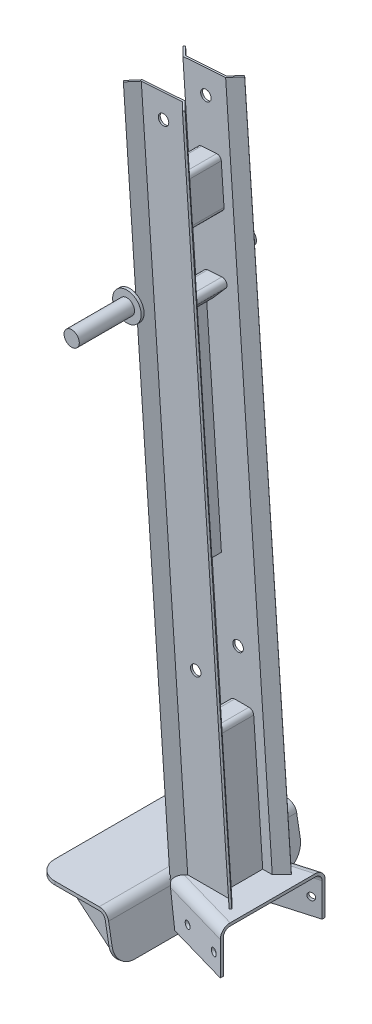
ISO-10303-21;
HEADER;
FILE_DESCRIPTION(('STEP AP214'),'2;1');
FILE_NAME('part.step','',(''),(''),'','','');
FILE_SCHEMA(('AUTOMOTIVE_DESIGN { 1 0 10303 214 1 1 1 1 }'));
ENDSEC;
DATA;
#1=APPLICATION_CONTEXT('core data for automotive mechanical design processes');
#2=APPLICATION_PROTOCOL_DEFINITION('international standard','automotive_design',2000,#1);
#3=PRODUCT_CONTEXT('',#1,'mechanical');
#4=PRODUCT('Part','Part','',(#3));
#5=PRODUCT_RELATED_PRODUCT_CATEGORY('part','',(#4));
#6=PRODUCT_DEFINITION_FORMATION('','',#4);
#7=PRODUCT_DEFINITION_CONTEXT('part definition',#1,'design');
#8=PRODUCT_DEFINITION('design','',#6,#7);
#9=PRODUCT_DEFINITION_SHAPE('','',#8);
#10=(LENGTH_UNIT() NAMED_UNIT(*) SI_UNIT(.MILLI.,.METRE.));
#11=(NAMED_UNIT(*) PLANE_ANGLE_UNIT() SI_UNIT($,.RADIAN.));
#12=(NAMED_UNIT(*) SI_UNIT($,.STERADIAN.) SOLID_ANGLE_UNIT());
#13=UNCERTAINTY_MEASURE_WITH_UNIT(LENGTH_MEASURE(1.E-05),#10,'distance_accuracy_value','');
#14=(GEOMETRIC_REPRESENTATION_CONTEXT(3) GLOBAL_UNCERTAINTY_ASSIGNED_CONTEXT((#13)) GLOBAL_UNIT_ASSIGNED_CONTEXT((#10,
#11,#12)) REPRESENTATION_CONTEXT('',''));
#15=CARTESIAN_POINT('',(0.,0.,0.));
#16=DIRECTION('',(0.,0.,1.));
#17=DIRECTION('',(1.,0.,0.));
#18=AXIS2_PLACEMENT_3D('',#15,#16,#17);
#19=CARTESIAN_POINT('',(-121.059009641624,613.04870620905,186.));
#20=DIRECTION('',(0.,0.,1.));
#21=DIRECTION('',(1.,0.,0.));
#22=AXIS2_PLACEMENT_3D('',#19,#20,#21);
#23=PLANE('',#22);
#24=CARTESIAN_POINT('',(-121.059009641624,613.04870620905,186.));
#25=DIRECTION('',(0.,0.,-1.));
#26=DIRECTION('',(-1.,0.,0.));
#27=AXIS2_PLACEMENT_3D('',#24,#25,#26);
#28=CIRCLE('',#27,16.);
#29=CARTESIAN_POINT('',(-137.059009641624,613.04870620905,186.));
#30=VERTEX_POINT('',#29);
#31=EDGE_CURVE('E1643',#30,#30,#28,.T.);
#32=ORIENTED_EDGE('',*,*,#31,.F.);
#33=EDGE_LOOP('',(#32));
#34=FACE_BOUND('',#33,.T.);
#35=ADVANCED_FACE('F17',(#34),#23,.T.);
#36=CARTESIAN_POINT('',(-35.,271.17659475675,-183.));
#37=DIRECTION('',(0.,0.,-1.));
#38=DIRECTION('',(-1.,0.,0.));
#39=AXIS2_PLACEMENT_3D('',#36,#37,#38);
#40=PLANE('',#39);
#41=DIRECTION('',(-0.173648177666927,0.984807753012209,0.));
#42=VECTOR('',#41,1.);
#43=CARTESIAN_POINT('',(-38.9794918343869,-397.74257369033,-183.));
#44=LINE('',#43,#42);
#45=CARTESIAN_POINT('',(-28.0018000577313,-460.000157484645,-183.));
#46=VERTEX_POINT('',#45);
#47=CARTESIAN_POINT('',(-38.9794918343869,-397.74257369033,-183.));
#48=VERTEX_POINT('',#47);
#49=EDGE_CURVE('E1584',#46,#48,#44,.T.);
#50=ORIENTED_EDGE('',*,*,#49,.T.);
#51=CARTESIAN_POINT('',(-51.7819926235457,-400.,-183.));
#52=DIRECTION('',(0.,0.,-1.));
#53=DIRECTION('',(-1.,0.,0.));
#54=AXIS2_PLACEMENT_3D('',#51,#52,#53);
#55=CIRCLE('',#54,13.);
#56=CARTESIAN_POINT('',(-51.7819926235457,-387.,-183.));
#57=VERTEX_POINT('',#56);
#58=EDGE_CURVE('E734',#48,#57,#55,.F.);
#59=ORIENTED_EDGE('',*,*,#58,.T.);
#60=DIRECTION('',(-1.,0.,0.));
#61=VECTOR('',#60,1.);
#62=CARTESIAN_POINT('',(-185.,-387.,-183.));
#63=LINE('',#62,#61);
#64=CARTESIAN_POINT('',(-115.,-387.,-183.));
#65=VERTEX_POINT('',#64);
#66=EDGE_CURVE('E1652',#57,#65,#63,.T.);
#67=ORIENTED_EDGE('',*,*,#66,.T.);
#68=DIRECTION('',(-0.766044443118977,0.642787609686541,0.));
#69=VECTOR('',#68,1.);
#70=CARTESIAN_POINT('',(-115.,-387.,-183.));
#71=LINE('',#70,#69);
#72=EDGE_CURVE('E1607',#65,#46,#71,.F.);
#73=ORIENTED_EDGE('',*,*,#72,.T.);
#74=EDGE_LOOP('',(#50,#59,#67,#73));
#75=FACE_BOUND('',#74,.T.);
#76=ADVANCED_FACE('F1795',(#75),#40,.F.);
#77=CARTESIAN_POINT('',(-51.7819926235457,-400.,197.5));
#78=DIRECTION('',(0.,0.,-1.));
#79=DIRECTION('',(-1.,0.,0.));
#80=AXIS2_PLACEMENT_3D('',#77,#78,#79);
#81=CYLINDRICAL_SURFACE('',#80,13.);
#82=DIRECTION('',(0.,0.,1.));
#83=VECTOR('',#82,1.);
#84=CARTESIAN_POINT('',(-38.9794918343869,-397.74257369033,197.5));
#85=LINE('',#84,#83);
#86=CARTESIAN_POINT('',(-38.9794918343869,-397.74257369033,183.));
#87=VERTEX_POINT('',#86);
#88=EDGE_CURVE('E1635',#48,#87,#85,.T.);
#89=ORIENTED_EDGE('',*,*,#88,.T.);
#90=CARTESIAN_POINT('',(-51.7819926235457,-400.,183.));
#91=DIRECTION('',(0.,0.,-1.));
#92=DIRECTION('',(-1.,0.,0.));
#93=AXIS2_PLACEMENT_3D('',#90,#91,#92);
#94=CIRCLE('',#93,13.);
#95=CARTESIAN_POINT('',(-51.7819926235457,-387.,183.));
#96=VERTEX_POINT('',#95);
#97=EDGE_CURVE('E1631',#87,#96,#94,.F.);
#98=ORIENTED_EDGE('',*,*,#97,.T.);
#99=DIRECTION('',(0.,0.,1.));
#100=VECTOR('',#99,1.);
#101=CARTESIAN_POINT('',(-51.7819926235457,-387.,197.5));
#102=LINE('',#101,#100);
#103=EDGE_CURVE('E1656',#96,#57,#102,.F.);
#104=ORIENTED_EDGE('',*,*,#103,.T.);
#105=ORIENTED_EDGE('',*,*,#58,.F.);
#106=EDGE_LOOP('',(#89,#98,#104,#105));
#107=FACE_BOUND('',#106,.T.);
#108=ADVANCED_FACE('F1799',(#107),#81,.F.);
#109=CARTESIAN_POINT('',(-35.,271.17659475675,183.));
#110=DIRECTION('',(0.,0.,1.));
#111=DIRECTION('',(1.,0.,0.));
#112=AXIS2_PLACEMENT_3D('',#109,#110,#111);
#113=PLANE('',#112);
#114=DIRECTION('',(-0.173648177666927,0.984807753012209,0.));
#115=VECTOR('',#114,1.);
#116=CARTESIAN_POINT('',(-38.9794918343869,-397.74257369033,183.));
#117=LINE('',#116,#115);
#118=CARTESIAN_POINT('',(-28.0018000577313,-460.000157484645,183.));
#119=VERTEX_POINT('',#118);
#120=EDGE_CURVE('E1626',#87,#119,#117,.F.);
#121=ORIENTED_EDGE('',*,*,#120,.T.);
#122=DIRECTION('',(0.766044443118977,-0.642787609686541,0.));
#123=VECTOR('',#122,1.);
#124=CARTESIAN_POINT('',(-115.,-387.,183.));
#125=LINE('',#124,#123);
#126=CARTESIAN_POINT('',(-115.,-387.,183.));
#127=VERTEX_POINT('',#126);
#128=EDGE_CURVE('E1622',#127,#119,#125,.T.);
#129=ORIENTED_EDGE('',*,*,#128,.F.);
#130=DIRECTION('',(-1.,0.,0.));
#131=VECTOR('',#130,1.);
#132=CARTESIAN_POINT('',(-185.,-387.,183.));
#133=LINE('',#132,#131);
#134=EDGE_CURVE('E1661',#127,#96,#133,.F.);
#135=ORIENTED_EDGE('',*,*,#134,.T.);
#136=ORIENTED_EDGE('',*,*,#97,.F.);
#137=EDGE_LOOP('',(#121,#129,#135,#136));
#138=FACE_BOUND('',#137,.T.);
#139=ADVANCED_FACE('F1803',(#138),#113,.F.);
#140=CARTESIAN_POINT('',(-115.,-387.,190.));
#141=DIRECTION('',(-0.642787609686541,-0.766044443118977,0.));
#142=DIRECTION('',(0.766044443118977,-0.642787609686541,0.));
#143=AXIS2_PLACEMENT_3D('',#140,#141,#142);
#144=PLANE('',#143);
#145=DIRECTION('',(0.,0.,1.));
#146=VECTOR('',#145,1.);
#147=CARTESIAN_POINT('',(-115.,-387.,197.5));
#148=LINE('',#147,#146);
#149=CARTESIAN_POINT('',(-115.,-387.,190.));
#150=VERTEX_POINT('',#149);
#151=EDGE_CURVE('E1664',#150,#127,#148,.F.);
#152=ORIENTED_EDGE('',*,*,#151,.T.);
#153=ORIENTED_EDGE('',*,*,#128,.T.);
#154=DIRECTION('',(0.,0.,1.));
#155=VECTOR('',#154,1.);
#156=CARTESIAN_POINT('',(-28.0018000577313,-460.000157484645,197.5));
#157=LINE('',#156,#155);
#158=CARTESIAN_POINT('',(-28.0018000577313,-460.000157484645,190.));
#159=VERTEX_POINT('',#158);
#160=EDGE_CURVE('E1617',#119,#159,#157,.T.);
#161=ORIENTED_EDGE('',*,*,#160,.T.);
#162=DIRECTION('',(0.766044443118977,-0.642787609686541,0.));
#163=VECTOR('',#162,1.);
#164=CARTESIAN_POINT('',(-115.,-387.,190.));
#165=LINE('',#164,#163);
#166=EDGE_CURVE('E1608',#150,#159,#165,.T.);
#167=ORIENTED_EDGE('',*,*,#166,.F.);
#168=EDGE_LOOP('',(#152,#153,#161,#167));
#169=FACE_BOUND('',#168,.T.);
#170=ADVANCED_FACE('F1686',(#169),#144,.T.);
#171=CARTESIAN_POINT('',(-35.,271.17659475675,190.));
#172=DIRECTION('',(0.,0.,1.));
#173=DIRECTION('',(1.,0.,0.));
#174=AXIS2_PLACEMENT_3D('',#171,#172,#173);
#175=PLANE('',#174);
#176=DIRECTION('',(-1.,0.,0.));
#177=VECTOR('',#176,1.);
#178=CARTESIAN_POINT('',(-185.,-387.,190.));
#179=LINE('',#178,#177);
#180=CARTESIAN_POINT('',(-51.7819926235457,-387.,190.));
#181=VERTEX_POINT('',#180);
#182=EDGE_CURVE('E1580',#181,#150,#179,.T.);
#183=ORIENTED_EDGE('',*,*,#182,.T.);
#184=ORIENTED_EDGE('',*,*,#166,.T.);
#185=DIRECTION('',(-0.173648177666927,0.984807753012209,0.));
#186=VECTOR('',#185,1.);
#187=CARTESIAN_POINT('',(-38.9794918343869,-397.74257369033,190.));
#188=LINE('',#187,#186);
#189=CARTESIAN_POINT('',(-38.9794918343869,-397.74257369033,190.));
#190=VERTEX_POINT('',#189);
#191=EDGE_CURVE('E1576',#159,#190,#188,.T.);
#192=ORIENTED_EDGE('',*,*,#191,.T.);
#193=CARTESIAN_POINT('',(-51.7819926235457,-400.,190.));
#194=DIRECTION('',(0.,0.,-1.));
#195=DIRECTION('',(-1.,0.,0.));
#196=AXIS2_PLACEMENT_3D('',#193,#194,#195);
#197=CIRCLE('',#196,13.);
#198=EDGE_CURVE('E1589',#190,#181,#197,.F.);
#199=ORIENTED_EDGE('',*,*,#198,.T.);
#200=EDGE_LOOP('',(#183,#184,#192,#199));
#201=FACE_BOUND('',#200,.T.);
#202=ADVANCED_FACE('F1676',(#201),#175,.T.);
#203=CARTESIAN_POINT('',(-35.,271.17659475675,-190.));
#204=DIRECTION('',(0.,0.,-1.));
#205=DIRECTION('',(-1.,0.,0.));
#206=AXIS2_PLACEMENT_3D('',#203,#204,#205);
#207=PLANE('',#206);
#208=DIRECTION('',(-1.,0.,0.));
#209=VECTOR('',#208,1.);
#210=CARTESIAN_POINT('',(-185.,-387.,-190.));
#211=LINE('',#210,#209);
#212=CARTESIAN_POINT('',(-115.,-387.,-190.));
#213=VERTEX_POINT('',#212);
#214=CARTESIAN_POINT('',(-51.7819926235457,-387.,-190.));
#215=VERTEX_POINT('',#214);
#216=EDGE_CURVE('E1594',#213,#215,#211,.F.);
#217=ORIENTED_EDGE('',*,*,#216,.T.);
#218=CARTESIAN_POINT('',(-51.7819926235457,-400.,-190.));
#219=DIRECTION('',(0.,0.,-1.));
#220=DIRECTION('',(-1.,0.,0.));
#221=AXIS2_PLACEMENT_3D('',#218,#219,#220);
#222=CIRCLE('',#221,13.);
#223=CARTESIAN_POINT('',(-38.9794918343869,-397.74257369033,-190.));
#224=VERTEX_POINT('',#223);
#225=EDGE_CURVE('E1590',#215,#224,#222,.T.);
#226=ORIENTED_EDGE('',*,*,#225,.T.);
#227=DIRECTION('',(-0.173648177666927,0.984807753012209,0.));
#228=VECTOR('',#227,1.);
#229=CARTESIAN_POINT('',(-38.9794918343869,-397.74257369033,-190.));
#230=LINE('',#229,#228);
#231=CARTESIAN_POINT('',(-28.0018000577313,-460.000157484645,-190.));
#232=VERTEX_POINT('',#231);
#233=EDGE_CURVE('E1597',#224,#232,#230,.F.);
#234=ORIENTED_EDGE('',*,*,#233,.T.);
#235=DIRECTION('',(-0.766044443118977,0.642787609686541,0.));
#236=VECTOR('',#235,1.);
#237=CARTESIAN_POINT('',(-115.,-387.,-190.));
#238=LINE('',#237,#236);
#239=EDGE_CURVE('E1605',#232,#213,#238,.T.);
#240=ORIENTED_EDGE('',*,*,#239,.T.);
#241=EDGE_LOOP('',(#217,#226,#234,#240));
#242=FACE_BOUND('',#241,.T.);
#243=ADVANCED_FACE('F1812',(#242),#207,.T.);
#244=CARTESIAN_POINT('',(-115.,-387.,-190.));
#245=DIRECTION('',(0.642787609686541,0.766044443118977,0.));
#246=DIRECTION('',(-0.766044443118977,0.642787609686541,0.));
#247=AXIS2_PLACEMENT_3D('',#244,#245,#246);
#248=PLANE('',#247);
#249=ORIENTED_EDGE('',*,*,#72,.F.);
#250=DIRECTION('',(0.,0.,1.));
#251=VECTOR('',#250,1.);
#252=CARTESIAN_POINT('',(-115.,-387.,197.5));
#253=LINE('',#252,#251);
#254=EDGE_CURVE('E1647',#65,#213,#253,.F.);
#255=ORIENTED_EDGE('',*,*,#254,.T.);
#256=ORIENTED_EDGE('',*,*,#239,.F.);
#257=DIRECTION('',(0.,0.,1.));
#258=VECTOR('',#257,1.);
#259=CARTESIAN_POINT('',(-28.0018000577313,-460.000157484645,197.5));
#260=LINE('',#259,#258);
#261=EDGE_CURVE('E1602',#232,#46,#260,.T.);
#262=ORIENTED_EDGE('',*,*,#261,.T.);
#263=EDGE_LOOP('',(#249,#255,#256,#262));
#264=FACE_BOUND('',#263,.T.);
#265=ADVANCED_FACE('F1815',(#264),#248,.F.);
#266=CARTESIAN_POINT('',(-121.059009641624,613.04870620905,186.));
#267=DIRECTION('',(0.,0.,-1.));
#268=DIRECTION('',(-1.,0.,0.));
#269=AXIS2_PLACEMENT_3D('',#266,#267,#268);
#270=CYLINDRICAL_SURFACE('',#269,16.);
#271=CARTESIAN_POINT('',(-121.059009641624,613.04870620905,70.));
#272=DIRECTION('',(0.,0.,-1.));
#273=DIRECTION('',(-1.,0.,0.));
#274=AXIS2_PLACEMENT_3D('',#271,#272,#273);
#275=CIRCLE('',#274,16.);
#276=CARTESIAN_POINT('',(-137.059009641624,613.04870620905,70.));
#277=VERTEX_POINT('',#276);
#278=EDGE_CURVE('E1613',#277,#277,#275,.F.);
#279=ORIENTED_EDGE('',*,*,#278,.T.);
#280=EDGE_LOOP('',(#279));
#281=FACE_BOUND('',#280,.T.);
#282=ORIENTED_EDGE('',*,*,#31,.T.);
#283=EDGE_LOOP('',(#282));
#284=FACE_BOUND('',#283,.T.);
#285=ADVANCED_FACE('F1819',(#281,#284),#270,.T.);
#286=CARTESIAN_POINT('',(-51.7819926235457,-400.,197.5));
#287=DIRECTION('',(0.,0.,-1.));
#288=DIRECTION('',(-1.,0.,0.));
#289=AXIS2_PLACEMENT_3D('',#286,#287,#288);
#290=CYLINDRICAL_SURFACE('',#289,13.);
#291=ORIENTED_EDGE('',*,*,#225,.F.);
#292=DIRECTION('',(0.,0.,1.));
#293=VECTOR('',#292,1.);
#294=CARTESIAN_POINT('',(-51.7819926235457,-387.,197.5));
#295=LINE('',#294,#293);
#296=CARTESIAN_POINT('',(-51.7819926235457,-387.,-197.5));
#297=VERTEX_POINT('',#296);
#298=EDGE_CURVE('E1592',#215,#297,#295,.F.);
#299=ORIENTED_EDGE('',*,*,#298,.T.);
#300=CARTESIAN_POINT('',(-51.7819926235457,-400.,-197.5));
#301=DIRECTION('',(0.,0.,-1.));
#302=DIRECTION('',(-1.,0.,0.));
#303=AXIS2_PLACEMENT_3D('',#300,#301,#302);
#304=CIRCLE('',#303,13.);
#305=CARTESIAN_POINT('',(-38.9794918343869,-397.74257369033,-197.5));
#306=VERTEX_POINT('',#305);
#307=EDGE_CURVE('E777',#306,#297,#304,.F.);
#308=ORIENTED_EDGE('',*,*,#307,.F.);
#309=DIRECTION('',(0.,0.,1.));
#310=VECTOR('',#309,1.);
#311=CARTESIAN_POINT('',(-38.9794918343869,-397.74257369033,197.5));
#312=LINE('',#311,#310);
#313=EDGE_CURVE('E1575',#306,#224,#312,.T.);
#314=ORIENTED_EDGE('',*,*,#313,.T.);
#315=EDGE_LOOP('',(#291,#299,#308,#314));
#316=FACE_BOUND('',#315,.T.);
#317=ADVANCED_FACE('F1823',(#316),#290,.F.);
#318=CARTESIAN_POINT('',(-145.,-400.,-157.5));
#319=DIRECTION('',(0.,1.,0.));
#320=DIRECTION('',(0.,0.,1.));
#321=AXIS2_PLACEMENT_3D('',#318,#319,#320);
#322=CYLINDRICAL_SURFACE('',#321,40.);
#323=CARTESIAN_POINT('',(-145.,-380.,-157.5));
#324=DIRECTION('',(0.,1.,0.));
#325=DIRECTION('',(0.,0.,1.));
#326=AXIS2_PLACEMENT_3D('',#323,#324,#325);
#327=CIRCLE('',#326,40.);
#328=CARTESIAN_POINT('',(-145.,-380.,-197.5));
#329=VERTEX_POINT('',#328);
#330=CARTESIAN_POINT('',(-185.,-380.,-157.5));
#331=VERTEX_POINT('',#330);
#332=EDGE_CURVE('E786',#329,#331,#327,.T.);
#333=ORIENTED_EDGE('',*,*,#332,.F.);
#334=DIRECTION('',(0.,1.,0.));
#335=VECTOR('',#334,1.);
#336=CARTESIAN_POINT('',(-145.,-400.,-197.5));
#337=LINE('',#336,#335);
#338=CARTESIAN_POINT('',(-145.,-387.,-197.5));
#339=VERTEX_POINT('',#338);
#340=EDGE_CURVE('E776',#339,#329,#337,.T.);
#341=ORIENTED_EDGE('',*,*,#340,.F.);
#342=CARTESIAN_POINT('',(-145.,-387.,-157.5));
#343=DIRECTION('',(0.,1.,0.));
#344=DIRECTION('',(0.,0.,1.));
#345=AXIS2_PLACEMENT_3D('',#342,#343,#344);
#346=CIRCLE('',#345,40.);
#347=CARTESIAN_POINT('',(-185.,-387.,-157.5));
#348=VERTEX_POINT('',#347);
#349=EDGE_CURVE('E772',#339,#348,#346,.T.);
#350=ORIENTED_EDGE('',*,*,#349,.T.);
#351=DIRECTION('',(0.,1.,0.));
#352=VECTOR('',#351,1.);
#353=CARTESIAN_POINT('',(-185.,-387.,-157.5));
#354=LINE('',#353,#352);
#355=EDGE_CURVE('E1586',#331,#348,#354,.F.);
#356=ORIENTED_EDGE('',*,*,#355,.F.);
#357=EDGE_LOOP('',(#333,#341,#350,#356));
#358=FACE_BOUND('',#357,.T.);
#359=ADVANCED_FACE('F1827',(#358),#322,.T.);
#360=CARTESIAN_POINT('',(-185.,-387.,197.5));
#361=DIRECTION('',(-1.,0.,0.));
#362=DIRECTION('',(0.,0.,1.));
#363=AXIS2_PLACEMENT_3D('',#360,#361,#362);
#364=PLANE('',#363);
#365=DIRECTION('',(0.,0.,1.));
#366=VECTOR('',#365,1.);
#367=CARTESIAN_POINT('',(-185.,-387.,197.5));
#368=LINE('',#367,#366);
#369=CARTESIAN_POINT('',(-185.,-387.,157.5));
#370=VERTEX_POINT('',#369);
#371=EDGE_CURVE('E769',#348,#370,#368,.T.);
#372=ORIENTED_EDGE('',*,*,#371,.T.);
#373=DIRECTION('',(0.,-1.,0.));
#374=VECTOR('',#373,1.);
#375=CARTESIAN_POINT('',(-185.,-387.,157.5));
#376=LINE('',#375,#374);
#377=CARTESIAN_POINT('',(-185.,-380.,157.5));
#378=VERTEX_POINT('',#377);
#379=EDGE_CURVE('E1581',#378,#370,#376,.T.);
#380=ORIENTED_EDGE('',*,*,#379,.F.);
#381=DIRECTION('',(0.,0.,1.));
#382=VECTOR('',#381,1.);
#383=CARTESIAN_POINT('',(-185.,-380.,197.5));
#384=LINE('',#383,#382);
#385=EDGE_CURVE('E782',#331,#378,#384,.T.);
#386=ORIENTED_EDGE('',*,*,#385,.F.);
#387=ORIENTED_EDGE('',*,*,#355,.T.);
#388=EDGE_LOOP('',(#372,#380,#386,#387));
#389=FACE_BOUND('',#388,.T.);
#390=ADVANCED_FACE('F1831',(#389),#364,.T.);
#391=CARTESIAN_POINT('',(-51.7819926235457,-400.,197.5));
#392=DIRECTION('',(0.,0.,-1.));
#393=DIRECTION('',(-1.,0.,0.));
#394=AXIS2_PLACEMENT_3D('',#391,#392,#393);
#395=CYLINDRICAL_SURFACE('',#394,13.);
#396=ORIENTED_EDGE('',*,*,#198,.F.);
#397=DIRECTION('',(0.,0.,1.));
#398=VECTOR('',#397,1.);
#399=CARTESIAN_POINT('',(-38.9794918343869,-397.74257369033,197.5));
#400=LINE('',#399,#398);
#401=CARTESIAN_POINT('',(-38.9794918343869,-397.74257369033,197.5));
#402=VERTEX_POINT('',#401);
#403=EDGE_CURVE('E1573',#190,#402,#400,.T.);
#404=ORIENTED_EDGE('',*,*,#403,.T.);
#405=CARTESIAN_POINT('',(-51.7819926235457,-400.,197.5));
#406=DIRECTION('',(0.,0.,-1.));
#407=DIRECTION('',(-1.,0.,0.));
#408=AXIS2_PLACEMENT_3D('',#405,#406,#407);
#409=CIRCLE('',#408,13.);
#410=CARTESIAN_POINT('',(-51.7819926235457,-387.,197.5));
#411=VERTEX_POINT('',#410);
#412=EDGE_CURVE('E800',#402,#411,#409,.F.);
#413=ORIENTED_EDGE('',*,*,#412,.T.);
#414=DIRECTION('',(0.,0.,1.));
#415=VECTOR('',#414,1.);
#416=CARTESIAN_POINT('',(-51.7819926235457,-387.,197.5));
#417=LINE('',#416,#415);
#418=EDGE_CURVE('E771',#411,#181,#417,.F.);
#419=ORIENTED_EDGE('',*,*,#418,.T.);
#420=EDGE_LOOP('',(#396,#404,#413,#419));
#421=FACE_BOUND('',#420,.T.);
#422=ADVANCED_FACE('F1695',(#421),#395,.F.);
#423=CARTESIAN_POINT('',(-185.,-387.,197.5));
#424=DIRECTION('',(0.,1.,0.));
#425=DIRECTION('',(-1.,0.,0.));
#426=AXIS2_PLACEMENT_3D('',#423,#424,#425);
#427=PLANE('',#426);
#428=ORIENTED_EDGE('',*,*,#216,.F.);
#429=ORIENTED_EDGE('',*,*,#254,.F.);
#430=ORIENTED_EDGE('',*,*,#66,.F.);
#431=ORIENTED_EDGE('',*,*,#103,.F.);
#432=ORIENTED_EDGE('',*,*,#134,.F.);
#433=ORIENTED_EDGE('',*,*,#151,.F.);
#434=ORIENTED_EDGE('',*,*,#182,.F.);
#435=ORIENTED_EDGE('',*,*,#418,.F.);
#436=DIRECTION('',(-1.,0.,0.));
#437=VECTOR('',#436,1.);
#438=CARTESIAN_POINT('',(-51.7819926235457,-387.,197.5));
#439=LINE('',#438,#437);
#440=CARTESIAN_POINT('',(-145.,-387.,197.5));
#441=VERTEX_POINT('',#440);
#442=EDGE_CURVE('E798',#411,#441,#439,.T.);
#443=ORIENTED_EDGE('',*,*,#442,.T.);
#444=CARTESIAN_POINT('',(-145.,-387.,157.5));
#445=DIRECTION('',(0.,-1.,0.));
#446=DIRECTION('',(0.,0.,-1.));
#447=AXIS2_PLACEMENT_3D('',#444,#445,#446);
#448=CIRCLE('',#447,40.);
#449=EDGE_CURVE('E1585',#370,#441,#448,.F.);
#450=ORIENTED_EDGE('',*,*,#449,.F.);
#451=ORIENTED_EDGE('',*,*,#371,.F.);
#452=ORIENTED_EDGE('',*,*,#349,.F.);
#453=DIRECTION('',(-1.,0.,0.));
#454=VECTOR('',#453,1.);
#455=CARTESIAN_POINT('',(-51.7819926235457,-387.,-197.5));
#456=LINE('',#455,#454);
#457=EDGE_CURVE('E773',#297,#339,#456,.T.);
#458=ORIENTED_EDGE('',*,*,#457,.F.);
#459=ORIENTED_EDGE('',*,*,#298,.F.);
#460=EDGE_LOOP('',(#428,#429,#430,#431,#432,#433,#434,#435,#443,#450,#451,#452,#458,#459));
#461=FACE_BOUND('',#460,.T.);
#462=ADVANCED_FACE('F1683',(#461),#427,.F.);
#463=CARTESIAN_POINT('',(-145.,-387.,157.5));
#464=DIRECTION('',(0.,-1.,0.));
#465=DIRECTION('',(0.,0.,-1.));
#466=AXIS2_PLACEMENT_3D('',#463,#464,#465);
#467=CYLINDRICAL_SURFACE('',#466,40.);
#468=CARTESIAN_POINT('',(-145.,-380.,157.5));
#469=DIRECTION('',(0.,-1.,0.));
#470=DIRECTION('',(0.,0.,-1.));
#471=AXIS2_PLACEMENT_3D('',#468,#469,#470);
#472=CIRCLE('',#471,40.);
#473=CARTESIAN_POINT('',(-145.,-380.,197.5));
#474=VERTEX_POINT('',#473);
#475=EDGE_CURVE('E785',#378,#474,#472,.F.);
#476=ORIENTED_EDGE('',*,*,#475,.F.);
#477=ORIENTED_EDGE('',*,*,#379,.T.);
#478=ORIENTED_EDGE('',*,*,#449,.T.);
#479=DIRECTION('',(0.,1.,0.));
#480=VECTOR('',#479,1.);
#481=CARTESIAN_POINT('',(-145.,-400.,197.5));
#482=LINE('',#481,#480);
#483=EDGE_CURVE('E797',#441,#474,#482,.T.);
#484=ORIENTED_EDGE('',*,*,#483,.T.);
#485=EDGE_LOOP('',(#476,#477,#478,#484));
#486=FACE_BOUND('',#485,.T.);
#487=ADVANCED_FACE('F1840',(#486),#467,.T.);
#488=CARTESIAN_POINT('',(-38.9794918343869,-397.74257369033,197.5));
#489=DIRECTION('',(0.984807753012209,0.173648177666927,0.));
#490=DIRECTION('',(-0.173648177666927,0.984807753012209,0.));
#491=AXIS2_PLACEMENT_3D('',#488,#489,#490);
#492=PLANE('',#491);
#493=ORIENTED_EDGE('',*,*,#233,.F.);
#494=ORIENTED_EDGE('',*,*,#313,.F.);
#495=DIRECTION('',(-0.173648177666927,0.984807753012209,0.));
#496=VECTOR('',#495,1.);
#497=CARTESIAN_POINT('',(-31.4747636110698,-440.304002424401,-197.5));
#498=LINE('',#497,#496);
#499=CARTESIAN_POINT('',(-31.4747636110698,-440.304002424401,-197.5));
#500=VERTEX_POINT('',#499);
#501=EDGE_CURVE('E778',#500,#306,#498,.T.);
#502=ORIENTED_EDGE('',*,*,#501,.F.);
#503=CARTESIAN_POINT('',(-31.4747636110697,-440.304002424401,-157.5));
#504=DIRECTION('',(-0.984807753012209,-0.173648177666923,0.));
#505=DIRECTION('',(0.173648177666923,-0.984807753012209,0.));
#506=AXIS2_PLACEMENT_3D('',#503,#504,#505);
#507=CIRCLE('',#506,40.);
#508=CARTESIAN_POINT('',(-24.5288365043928,-479.696312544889,-157.5));
#509=VERTEX_POINT('',#508);
#510=EDGE_CURVE('E2009',#509,#500,#507,.F.);
#511=ORIENTED_EDGE('',*,*,#510,.F.);
#512=DIRECTION('',(0.,0.,1.));
#513=VECTOR('',#512,1.);
#514=CARTESIAN_POINT('',(-24.5288365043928,-479.696312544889,197.5));
#515=LINE('',#514,#513);
#516=CARTESIAN_POINT('',(-24.5288365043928,-479.696312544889,157.5));
#517=VERTEX_POINT('',#516);
#518=EDGE_CURVE('E1564',#517,#509,#515,.F.);
#519=ORIENTED_EDGE('',*,*,#518,.F.);
#520=CARTESIAN_POINT('',(-31.4747636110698,-440.304002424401,157.5));
#521=DIRECTION('',(0.984807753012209,0.173648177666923,0.));
#522=DIRECTION('',(-0.173648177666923,0.984807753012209,0.));
#523=AXIS2_PLACEMENT_3D('',#520,#521,#522);
#524=CIRCLE('',#523,40.);
#525=CARTESIAN_POINT('',(-31.4747636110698,-440.304002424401,197.5));
#526=VERTEX_POINT('',#525);
#527=EDGE_CURVE('E1600',#526,#517,#524,.T.);
#528=ORIENTED_EDGE('',*,*,#527,.F.);
#529=DIRECTION('',(-0.173648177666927,0.984807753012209,0.));
#530=VECTOR('',#529,1.);
#531=CARTESIAN_POINT('',(-31.4747636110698,-440.304002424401,197.5));
#532=LINE('',#531,#530);
#533=EDGE_CURVE('E790',#526,#402,#532,.T.);
#534=ORIENTED_EDGE('',*,*,#533,.T.);
#535=ORIENTED_EDGE('',*,*,#403,.F.);
#536=ORIENTED_EDGE('',*,*,#191,.F.);
#537=ORIENTED_EDGE('',*,*,#160,.F.);
#538=ORIENTED_EDGE('',*,*,#120,.F.);
#539=ORIENTED_EDGE('',*,*,#88,.F.);
#540=ORIENTED_EDGE('',*,*,#49,.F.);
#541=ORIENTED_EDGE('',*,*,#261,.F.);
#542=EDGE_LOOP('',(#493,#494,#502,#511,#519,#528,#534,#535,#536,#537,#538,#539,#540,#541));
#543=FACE_BOUND('',#542,.T.);
#544=ADVANCED_FACE('F1691',(#543),#492,.F.);
#545=CARTESIAN_POINT('',(-121.059009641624,613.04870620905,-186.));
#546=DIRECTION('',(0.,0.,-1.));
#547=DIRECTION('',(-1.,0.,0.));
#548=AXIS2_PLACEMENT_3D('',#545,#546,#547);
#549=PLANE('',#548);
#550=CARTESIAN_POINT('',(-121.059009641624,613.04870620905,-186.));
#551=DIRECTION('',(0.,0.,1.));
#552=DIRECTION('',(1.,0.,0.));
#553=AXIS2_PLACEMENT_3D('',#550,#551,#552);
#554=CIRCLE('',#553,16.);
#555=CARTESIAN_POINT('',(-105.059009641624,613.04870620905,-186.));
#556=VERTEX_POINT('',#555);
#557=EDGE_CURVE('E793',#556,#556,#554,.T.);
#558=ORIENTED_EDGE('',*,*,#557,.F.);
#559=EDGE_LOOP('',(#558));
#560=FACE_BOUND('',#559,.T.);
#561=ADVANCED_FACE('F1846',(#560),#549,.T.);
#562=CARTESIAN_POINT('',(-121.059009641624,613.04870620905,70.));
#563=DIRECTION('',(0.,0.,-1.));
#564=DIRECTION('',(-1.,0.,0.));
#565=AXIS2_PLACEMENT_3D('',#562,#563,#564);
#566=PLANE('',#565);
#567=ORIENTED_EDGE('',*,*,#278,.F.);
#568=EDGE_LOOP('',(#567));
#569=FACE_BOUND('',#568,.T.);
#570=CARTESIAN_POINT('',(-121.059009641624,613.04870620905,70.));
#571=DIRECTION('',(0.,0.,-1.));
#572=DIRECTION('',(-1.,0.,0.));
#573=AXIS2_PLACEMENT_3D('',#570,#571,#572);
#574=CIRCLE('',#573,30.);
#575=CARTESIAN_POINT('',(-151.059009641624,613.04870620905,70.));
#576=VERTEX_POINT('',#575);
#577=EDGE_CURVE('E804',#576,#576,#574,.T.);
#578=ORIENTED_EDGE('',*,*,#577,.F.);
#579=EDGE_LOOP('',(#578));
#580=FACE_BOUND('',#579,.T.);
#581=ADVANCED_FACE('F1849',(#569,#580),#566,.F.);
#582=CARTESIAN_POINT('',(103.275741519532,-435.,78.328242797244));
#583=DIRECTION('',(-0.275637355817,0.,0.961261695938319));
#584=DIRECTION('',(0.961261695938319,0.,0.275637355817));
#585=AXIS2_PLACEMENT_3D('',#582,#583,#584);
#586=CYLINDRICAL_SURFACE('',#585,7.50000000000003);
#587=CARTESIAN_POINT('',(95.7747660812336,-435.,104.48725288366));
#588=DIRECTION('',(-0.275637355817,0.,0.961261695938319));
#589=DIRECTION('',(0.961261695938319,0.,0.275637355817));
#590=AXIS2_PLACEMENT_3D('',#587,#588,#589);
#591=CIRCLE('',#590,7.50000000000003);
#592=CARTESIAN_POINT('',(102.984228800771,-435.,106.554533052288));
#593=VERTEX_POINT('',#592);
#594=EDGE_CURVE('E1480',#593,#593,#591,.F.);
#595=ORIENTED_EDGE('',*,*,#594,.F.);
#596=EDGE_LOOP('',(#595));
#597=FACE_BOUND('',#596,.T.);
#598=CARTESIAN_POINT('',(97.4285902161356,-435.,98.7196827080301));
#599=DIRECTION('',(-0.275637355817,0.,0.961261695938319));
#600=DIRECTION('',(0.961261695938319,0.,0.275637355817));
#601=AXIS2_PLACEMENT_3D('',#598,#599,#600);
#602=CIRCLE('',#601,7.50000000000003);
#603=CARTESIAN_POINT('',(104.638052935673,-435.,100.786962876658));
#604=VERTEX_POINT('',#603);
#605=EDGE_CURVE('E1470',#604,#604,#602,.F.);
#606=ORIENTED_EDGE('',*,*,#605,.T.);
#607=EDGE_LOOP('',(#606));
#608=FACE_BOUND('',#607,.T.);
#609=ADVANCED_FACE('F1853',(#597,#608),#586,.F.);
#610=CARTESIAN_POINT('',(26.374805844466,-435.,56.2772543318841));
#611=DIRECTION('',(-0.275637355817,0.,0.961261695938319));
#612=DIRECTION('',(0.961261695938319,0.,0.275637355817));
#613=AXIS2_PLACEMENT_3D('',#610,#611,#612);
#614=CYLINDRICAL_SURFACE('',#613,7.5);
#615=CARTESIAN_POINT('',(18.8738304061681,-435.,82.4362644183));
#616=DIRECTION('',(-0.275637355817,0.,0.961261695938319));
#617=DIRECTION('',(0.961261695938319,0.,0.275637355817));
#618=AXIS2_PLACEMENT_3D('',#615,#616,#617);
#619=CIRCLE('',#618,7.5);
#620=CARTESIAN_POINT('',(26.0832931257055,-435.,84.5035445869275));
#621=VERTEX_POINT('',#620);
#622=EDGE_CURVE('E1495',#621,#621,#619,.F.);
#623=ORIENTED_EDGE('',*,*,#622,.F.);
#624=EDGE_LOOP('',(#623));
#625=FACE_BOUND('',#624,.T.);
#626=CARTESIAN_POINT('',(20.5276545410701,-435.,76.6686942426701));
#627=DIRECTION('',(-0.275637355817,0.,0.961261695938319));
#628=DIRECTION('',(0.961261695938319,0.,0.275637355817));
#629=AXIS2_PLACEMENT_3D('',#626,#627,#628);
#630=CIRCLE('',#629,7.5);
#631=CARTESIAN_POINT('',(27.7371172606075,-435.,78.7359744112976));
#632=VERTEX_POINT('',#631);
#633=EDGE_CURVE('E818',#632,#632,#630,.F.);
#634=ORIENTED_EDGE('',*,*,#633,.T.);
#635=EDGE_LOOP('',(#634));
#636=FACE_BOUND('',#635,.T.);
#637=ADVANCED_FACE('F1857',(#625,#636),#614,.F.);
#638=CARTESIAN_POINT('',(-44.2772644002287,-442.561428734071,-157.5));
#639=DIRECTION('',(-0.984807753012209,-0.173648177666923,0.));
#640=DIRECTION('',(0.173648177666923,-0.984807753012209,0.));
#641=AXIS2_PLACEMENT_3D('',#638,#639,#640);
#642=CYLINDRICAL_SURFACE('',#641,40.);
#643=DIRECTION('',(0.984807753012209,0.173648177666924,0.));
#644=VECTOR('',#643,1.);
#645=CARTESIAN_POINT('',(-17.6351822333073,-478.480775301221,-157.5));
#646=LINE('',#645,#644);
#647=CARTESIAN_POINT('',(-17.6351822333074,-478.480775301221,-157.5));
#648=VERTEX_POINT('',#647);
#649=EDGE_CURVE('E1561',#509,#648,#646,.T.);
#650=ORIENTED_EDGE('',*,*,#649,.F.);
#651=ORIENTED_EDGE('',*,*,#510,.T.);
#652=DIRECTION('',(-0.984807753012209,-0.173648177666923,0.));
#653=VECTOR('',#652,1.);
#654=CARTESIAN_POINT('',(-24.5811093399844,-439.088465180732,-197.5));
#655=LINE('',#654,#653);
#656=CARTESIAN_POINT('',(-24.5811093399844,-439.088465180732,-197.5));
#657=VERTEX_POINT('',#656);
#658=EDGE_CURVE('E781',#657,#500,#655,.T.);
#659=ORIENTED_EDGE('',*,*,#658,.F.);
#660=CARTESIAN_POINT('',(-24.5811093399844,-439.088465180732,-157.5));
#661=DIRECTION('',(-0.984807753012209,-0.173648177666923,0.));
#662=DIRECTION('',(0.173648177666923,-0.984807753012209,0.));
#663=AXIS2_PLACEMENT_3D('',#660,#661,#662);
#664=CIRCLE('',#663,40.);
#665=EDGE_CURVE('E820',#648,#657,#664,.F.);
#666=ORIENTED_EDGE('',*,*,#665,.F.);
#667=EDGE_LOOP('',(#650,#651,#659,#666));
#668=FACE_BOUND('',#667,.T.);
#669=ADVANCED_FACE('F1861',(#668),#642,.T.);
#670=CARTESIAN_POINT('',(-24.5811093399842,-439.088465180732,157.5));
#671=DIRECTION('',(0.984807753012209,0.173648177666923,0.));
#672=DIRECTION('',(-0.173648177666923,0.984807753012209,0.));
#673=AXIS2_PLACEMENT_3D('',#670,#671,#672);
#674=CYLINDRICAL_SURFACE('',#673,40.);
#675=DIRECTION('',(-0.984807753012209,-0.173648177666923,0.));
#676=VECTOR('',#675,1.);
#677=CARTESIAN_POINT('',(-24.5811093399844,-439.088465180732,197.5));
#678=LINE('',#677,#676);
#679=CARTESIAN_POINT('',(-24.5811093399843,-439.088465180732,197.5));
#680=VERTEX_POINT('',#679);
#681=EDGE_CURVE('E794',#680,#526,#678,.T.);
#682=ORIENTED_EDGE('',*,*,#681,.T.);
#683=ORIENTED_EDGE('',*,*,#527,.T.);
#684=DIRECTION('',(0.984807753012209,0.173648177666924,0.));
#685=VECTOR('',#684,1.);
#686=CARTESIAN_POINT('',(-17.6351822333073,-478.480775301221,157.5));
#687=LINE('',#686,#685);
#688=CARTESIAN_POINT('',(-17.6351822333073,-478.480775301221,157.5));
#689=VERTEX_POINT('',#688);
#690=EDGE_CURVE('E1558',#689,#517,#687,.F.);
#691=ORIENTED_EDGE('',*,*,#690,.F.);
#692=CARTESIAN_POINT('',(-24.5811093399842,-439.088465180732,157.5));
#693=DIRECTION('',(0.984807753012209,0.173648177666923,0.));
#694=DIRECTION('',(-0.173648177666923,0.984807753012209,0.));
#695=AXIS2_PLACEMENT_3D('',#692,#693,#694);
#696=CIRCLE('',#695,40.);
#697=EDGE_CURVE('E825',#680,#689,#696,.T.);
#698=ORIENTED_EDGE('',*,*,#697,.F.);
#699=EDGE_LOOP('',(#682,#683,#691,#698));
#700=FACE_BOUND('',#699,.T.);
#701=ADVANCED_FACE('F1865',(#700),#674,.T.);
#702=CARTESIAN_POINT('',(-17.6351822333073,-478.480775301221,197.5));
#703=DIRECTION('',(0.173648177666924,-0.984807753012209,0.));
#704=DIRECTION('',(0.984807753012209,0.173648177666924,0.));
#705=AXIS2_PLACEMENT_3D('',#702,#703,#704);
#706=PLANE('',#705);
#707=DIRECTION('',(0.,0.,1.));
#708=VECTOR('',#707,1.);
#709=CARTESIAN_POINT('',(-17.6351822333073,-478.480775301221,197.5));
#710=LINE('',#709,#708);
#711=EDGE_CURVE('E821',#689,#648,#710,.F.);
#712=ORIENTED_EDGE('',*,*,#711,.F.);
#713=ORIENTED_EDGE('',*,*,#690,.T.);
#714=ORIENTED_EDGE('',*,*,#518,.T.);
#715=ORIENTED_EDGE('',*,*,#649,.T.);
#716=EDGE_LOOP('',(#712,#713,#714,#715));
#717=FACE_BOUND('',#716,.T.);
#718=ADVANCED_FACE('F1869',(#717),#706,.T.);
#719=CARTESIAN_POINT('',(165.486487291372,-435.,138.626410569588));
#720=DIRECTION('',(-0.275637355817,0.,-0.961261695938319));
#721=DIRECTION('',(-0.961261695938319,0.,0.275637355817));
#722=AXIS2_PLACEMENT_3D('',#719,#720,#721);
#723=CYLINDRICAL_SURFACE('',#722,7.50000000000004);
#724=CARTESIAN_POINT('',(97.4285902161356,-435.,-98.7196827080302));
#725=DIRECTION('',(-0.275637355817,0.,-0.961261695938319));
#726=DIRECTION('',(-0.961261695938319,0.,0.275637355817));
#727=AXIS2_PLACEMENT_3D('',#724,#725,#726);
#728=CIRCLE('',#727,7.50000000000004);
#729=CARTESIAN_POINT('',(90.2191274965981,-435.,-96.6524025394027));
#730=VERTEX_POINT('',#729);
#731=EDGE_CURVE('E1982',#730,#730,#728,.F.);
#732=ORIENTED_EDGE('',*,*,#731,.T.);
#733=EDGE_LOOP('',(#732));
#734=FACE_BOUND('',#733,.T.);
#735=CARTESIAN_POINT('',(95.7747660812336,-435.,-104.48725288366));
#736=DIRECTION('',(-0.275637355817,0.,-0.961261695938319));
#737=DIRECTION('',(-0.961261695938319,0.,0.275637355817));
#738=AXIS2_PLACEMENT_3D('',#735,#736,#737);
#739=CIRCLE('',#738,7.50000000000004);
#740=CARTESIAN_POINT('',(88.5653033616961,-435.,-102.419972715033));
#741=VERTEX_POINT('',#740);
#742=EDGE_CURVE('E824',#741,#741,#739,.F.);
#743=ORIENTED_EDGE('',*,*,#742,.F.);
#744=EDGE_LOOP('',(#743));
#745=FACE_BOUND('',#744,.T.);
#746=ADVANCED_FACE('F1873',(#734,#745),#723,.F.);
#747=CARTESIAN_POINT('',(88.5855516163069,-435.,160.677399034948));
#748=DIRECTION('',(-0.275637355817,0.,-0.961261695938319));
#749=DIRECTION('',(-0.961261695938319,0.,0.275637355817));
#750=AXIS2_PLACEMENT_3D('',#747,#748,#749);
#751=CYLINDRICAL_SURFACE('',#750,7.50000000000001);
#752=CARTESIAN_POINT('',(20.5276545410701,-435.,-76.6686942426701));
#753=DIRECTION('',(-0.275637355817,0.,-0.961261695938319));
#754=DIRECTION('',(-0.961261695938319,0.,0.275637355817));
#755=AXIS2_PLACEMENT_3D('',#752,#753,#754);
#756=CIRCLE('',#755,7.50000000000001);
#757=CARTESIAN_POINT('',(13.3181918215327,-435.,-74.6014140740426));
#758=VERTEX_POINT('',#757);
#759=EDGE_CURVE('E1496',#758,#758,#756,.F.);
#760=ORIENTED_EDGE('',*,*,#759,.T.);
#761=EDGE_LOOP('',(#760));
#762=FACE_BOUND('',#761,.T.);
#763=CARTESIAN_POINT('',(18.8738304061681,-435.,-82.4362644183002));
#764=DIRECTION('',(-0.275637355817,0.,-0.961261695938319));
#765=DIRECTION('',(-0.961261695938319,0.,0.275637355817));
#766=AXIS2_PLACEMENT_3D('',#763,#764,#765);
#767=CIRCLE('',#766,7.50000000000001);
#768=CARTESIAN_POINT('',(11.6643676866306,-435.,-80.3689842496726));
#769=VERTEX_POINT('',#768);
#770=EDGE_CURVE('E1485',#769,#769,#767,.F.);
#771=ORIENTED_EDGE('',*,*,#770,.F.);
#772=EDGE_LOOP('',(#771));
#773=FACE_BOUND('',#772,.T.);
#774=ADVANCED_FACE('F1877',(#762,#773),#751,.F.);
#775=CARTESIAN_POINT('',(-51.7819926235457,-400.,-197.5));
#776=DIRECTION('',(0.,0.,-1.));
#777=DIRECTION('',(-1.,0.,0.));
#778=AXIS2_PLACEMENT_3D('',#775,#776,#777);
#779=PLANE('',#778);
#780=DIRECTION('',(-1.,0.,0.));
#781=VECTOR('',#780,1.);
#782=CARTESIAN_POINT('',(-185.,-380.,-197.5));
#783=LINE('',#782,#781);
#784=CARTESIAN_POINT('',(-51.7819926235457,-380.,-197.5));
#785=VERTEX_POINT('',#784);
#786=EDGE_CURVE('E787',#785,#329,#783,.T.);
#787=ORIENTED_EDGE('',*,*,#786,.F.);
#788=CARTESIAN_POINT('',(-51.7819926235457,-400.,-197.5));
#789=DIRECTION('',(0.,0.,-1.));
#790=DIRECTION('',(-1.,0.,0.));
#791=AXIS2_PLACEMENT_3D('',#788,#789,#790);
#792=CIRCLE('',#791,20.);
#793=CARTESIAN_POINT('',(-32.0858375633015,-396.527036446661,-197.5));
#794=VERTEX_POINT('',#793);
#795=EDGE_CURVE('E1448',#794,#785,#792,.F.);
#796=ORIENTED_EDGE('',*,*,#795,.F.);
#797=DIRECTION('',(-0.173648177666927,0.984807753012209,0.));
#798=VECTOR('',#797,1.);
#799=CARTESIAN_POINT('',(-32.0858375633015,-396.527036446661,-197.5));
#800=LINE('',#799,#798);
#801=EDGE_CURVE('E847',#657,#794,#800,.T.);
#802=ORIENTED_EDGE('',*,*,#801,.F.);
#803=ORIENTED_EDGE('',*,*,#658,.T.);
#804=ORIENTED_EDGE('',*,*,#501,.T.);
#805=ORIENTED_EDGE('',*,*,#307,.T.);
#806=ORIENTED_EDGE('',*,*,#457,.T.);
#807=ORIENTED_EDGE('',*,*,#340,.T.);
#808=EDGE_LOOP('',(#787,#796,#802,#803,#804,#805,#806,#807));
#809=FACE_BOUND('',#808,.T.);
#810=ADVANCED_FACE('F1881',(#809),#779,.T.);
#811=CARTESIAN_POINT('',(-185.,-380.,197.5));
#812=DIRECTION('',(0.,1.,0.));
#813=DIRECTION('',(-1.,0.,0.));
#814=AXIS2_PLACEMENT_3D('',#811,#812,#813);
#815=PLANE('',#814);
#816=ORIENTED_EDGE('',*,*,#475,.T.);
#817=DIRECTION('',(-1.,0.,0.));
#818=VECTOR('',#817,1.);
#819=CARTESIAN_POINT('',(-51.7819926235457,-380.,197.5));
#820=LINE('',#819,#818);
#821=CARTESIAN_POINT('',(-51.7819926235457,-380.,197.5));
#822=VERTEX_POINT('',#821);
#823=EDGE_CURVE('E795',#474,#822,#820,.F.);
#824=ORIENTED_EDGE('',*,*,#823,.T.);
#825=DIRECTION('',(0.,0.,-1.));
#826=VECTOR('',#825,1.);
#827=CARTESIAN_POINT('',(-51.7819926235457,-380.,197.5));
#828=LINE('',#827,#826);
#829=EDGE_CURVE('E1550',#785,#822,#828,.F.);
#830=ORIENTED_EDGE('',*,*,#829,.F.);
#831=ORIENTED_EDGE('',*,*,#786,.T.);
#832=ORIENTED_EDGE('',*,*,#332,.T.);
#833=ORIENTED_EDGE('',*,*,#385,.T.);
#834=EDGE_LOOP('',(#816,#824,#830,#831,#832,#833));
#835=FACE_BOUND('',#834,.T.);
#836=ADVANCED_FACE('F1885',(#835),#815,.T.);
#837=CARTESIAN_POINT('',(-51.7819926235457,-400.,197.5));
#838=DIRECTION('',(0.,0.,-1.));
#839=DIRECTION('',(-1.,0.,0.));
#840=AXIS2_PLACEMENT_3D('',#837,#838,#839);
#841=PLANE('',#840);
#842=ORIENTED_EDGE('',*,*,#681,.F.);
#843=DIRECTION('',(-0.173648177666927,0.984807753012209,0.));
#844=VECTOR('',#843,1.);
#845=CARTESIAN_POINT('',(-32.0858375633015,-396.527036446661,197.5));
#846=LINE('',#845,#844);
#847=CARTESIAN_POINT('',(-32.0858375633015,-396.527036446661,197.5));
#848=VERTEX_POINT('',#847);
#849=EDGE_CURVE('E826',#848,#680,#846,.F.);
#850=ORIENTED_EDGE('',*,*,#849,.F.);
#851=CARTESIAN_POINT('',(-51.7819926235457,-400.,197.5));
#852=DIRECTION('',(0.,0.,-1.));
#853=DIRECTION('',(-1.,0.,0.));
#854=AXIS2_PLACEMENT_3D('',#851,#852,#853);
#855=CIRCLE('',#854,20.);
#856=EDGE_CURVE('E1553',#822,#848,#855,.T.);
#857=ORIENTED_EDGE('',*,*,#856,.F.);
#858=ORIENTED_EDGE('',*,*,#823,.F.);
#859=ORIENTED_EDGE('',*,*,#483,.F.);
#860=ORIENTED_EDGE('',*,*,#442,.F.);
#861=ORIENTED_EDGE('',*,*,#412,.F.);
#862=ORIENTED_EDGE('',*,*,#533,.F.);
#863=EDGE_LOOP('',(#842,#850,#857,#858,#859,#860,#861,#862));
#864=FACE_BOUND('',#863,.T.);
#865=ADVANCED_FACE('F1889',(#864),#841,.F.);
#866=CARTESIAN_POINT('',(-121.059009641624,613.04870620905,-186.));
#867=DIRECTION('',(0.,0.,1.));
#868=DIRECTION('',(1.,0.,0.));
#869=AXIS2_PLACEMENT_3D('',#866,#867,#868);
#870=CYLINDRICAL_SURFACE('',#869,16.);
#871=ORIENTED_EDGE('',*,*,#557,.T.);
#872=EDGE_LOOP('',(#871));
#873=FACE_BOUND('',#872,.T.);
#874=CARTESIAN_POINT('',(-121.059009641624,613.04870620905,-70.));
#875=DIRECTION('',(0.,0.,1.));
#876=DIRECTION('',(1.,0.,0.));
#877=AXIS2_PLACEMENT_3D('',#874,#875,#876);
#878=CIRCLE('',#877,16.);
#879=CARTESIAN_POINT('',(-105.059009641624,613.04870620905,-70.));
#880=VERTEX_POINT('',#879);
#881=EDGE_CURVE('E1137',#880,#880,#878,.F.);
#882=ORIENTED_EDGE('',*,*,#881,.T.);
#883=EDGE_LOOP('',(#882));
#884=FACE_BOUND('',#883,.T.);
#885=ADVANCED_FACE('F1893',(#873,#884),#870,.T.);
#886=CARTESIAN_POINT('',(-121.059009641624,613.04870620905,64.));
#887=DIRECTION('',(0.,0.,1.));
#888=DIRECTION('',(1.,0.,0.));
#889=AXIS2_PLACEMENT_3D('',#886,#887,#888);
#890=PLANE('',#889);
#891=CARTESIAN_POINT('',(-121.059009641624,613.04870620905,64.));
#892=DIRECTION('',(0.,0.,-1.));
#893=DIRECTION('',(-1.,0.,0.));
#894=AXIS2_PLACEMENT_3D('',#891,#892,#893);
#895=CIRCLE('',#894,13.5);
#896=CARTESIAN_POINT('',(-134.559009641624,613.04870620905,64.));
#897=VERTEX_POINT('',#896);
#898=EDGE_CURVE('E1133',#897,#897,#895,.T.);
#899=ORIENTED_EDGE('',*,*,#898,.F.);
#900=EDGE_LOOP('',(#899));
#901=FACE_BOUND('',#900,.T.);
#902=CARTESIAN_POINT('',(-121.059009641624,613.04870620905,64.));
#903=DIRECTION('',(0.,0.,-1.));
#904=DIRECTION('',(-1.,0.,0.));
#905=AXIS2_PLACEMENT_3D('',#902,#903,#904);
#906=CIRCLE('',#905,30.);
#907=CARTESIAN_POINT('',(-108.426351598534,640.259291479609,64.));
#908=VERTEX_POINT('',#907);
#909=CARTESIAN_POINT('',(-104.762310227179,587.86105867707,64.));
#910=VERTEX_POINT('',#909);
#911=EDGE_CURVE('E1991',#908,#910,#906,.F.);
#912=ORIENTED_EDGE('',*,*,#911,.F.);
#913=DIRECTION('',(-0.0697564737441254,0.997564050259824,0.));
#914=VECTOR('',#913,1.);
#915=CARTESIAN_POINT('',(-104.762310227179,587.86105867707,64.));
#916=LINE('',#915,#914);
#917=EDGE_CURVE('E801',#910,#908,#916,.T.);
#918=ORIENTED_EDGE('',*,*,#917,.F.);
#919=EDGE_LOOP('',(#912,#918));
#920=FACE_BOUND('',#919,.T.);
#921=ADVANCED_FACE('F1897',(#901,#920),#890,.F.);
#922=CARTESIAN_POINT('',(-135.993266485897,1012.98116047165,62.5));
#923=DIRECTION('',(-0.705384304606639,-0.0493252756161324,-0.707106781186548));
#924=DIRECTION('',(-0.707968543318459,0.,0.706243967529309));
#925=AXIS2_PLACEMENT_3D('',#922,#923,#924);
#926=PLANE('',#925);
#927=DIRECTION('',(0.707968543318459,0.,-0.706243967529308));
#928=VECTOR('',#927,1.);
#929=CARTESIAN_POINT('',(-35.,-380.,58.9222017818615));
#930=LINE('',#929,#928);
#931=CARTESIAN_POINT('',(-35.,-380.,58.9222017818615));
#932=VERTEX_POINT('',#931);
#933=CARTESIAN_POINT('',(-18.5376968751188,-380.,42.5));
#934=VERTEX_POINT('',#933);
#935=EDGE_CURVE('E1304',#932,#934,#930,.T.);
#936=ORIENTED_EDGE('',*,*,#935,.F.);
#937=DIRECTION('',(-0.70796854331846,0.,0.706243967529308));
#938=VECTOR('',#937,1.);
#939=CARTESIAN_POINT('',(-35.,-380.,58.9222017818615));
#940=LINE('',#939,#938);
#941=CARTESIAN_POINT('',(-38.5865348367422,-380.,62.5));
#942=VERTEX_POINT('',#941);
#943=EDGE_CURVE('E1445',#932,#942,#940,.T.);
#944=ORIENTED_EDGE('',*,*,#943,.T.);
#945=DIRECTION('',(0.0697564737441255,-0.997564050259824,0.));
#946=VECTOR('',#945,1.);
#947=CARTESIAN_POINT('',(-107.836759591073,610.32435241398,62.5));
#948=LINE('',#947,#946);
#949=CARTESIAN_POINT('',(-107.836759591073,610.32435241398,62.5));
#950=VERTEX_POINT('',#949);
#951=EDGE_CURVE('E805',#950,#942,#948,.T.);
#952=ORIENTED_EDGE('',*,*,#951,.F.);
#953=CARTESIAN_POINT('',(-121.059009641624,613.04870620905,75.5));
#954=DIRECTION('',(-0.705384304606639,-0.0493252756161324,-0.707106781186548));
#955=DIRECTION('',(0.70538430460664,0.0493252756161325,-0.707106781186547));
#956=AXIS2_PLACEMENT_3D('',#953,#954,#955);
#957=ELLIPSE('',#956,19.0918830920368,13.5);
#958=CARTESIAN_POINT('',(-108.344594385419,617.586728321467,62.5));
#959=VERTEX_POINT('',#958);
#960=EDGE_CURVE('E1127',#959,#950,#957,.T.);
#961=ORIENTED_EDGE('',*,*,#960,.F.);
#962=DIRECTION('',(0.0697564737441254,-0.997564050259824,0.));
#963=VECTOR('',#962,1.);
#964=CARTESIAN_POINT('',(-135.993266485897,1012.98116047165,62.5));
#965=LINE('',#964,#963);
#966=CARTESIAN_POINT('',(-135.993266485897,1012.98116047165,62.5));
#967=VERTEX_POINT('',#966);
#968=EDGE_CURVE('E807',#967,#959,#965,.T.);
#969=ORIENTED_EDGE('',*,*,#968,.F.);
#970=DIRECTION('',(0.70538430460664,0.0493252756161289,-0.707106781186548));
#971=VECTOR('',#970,1.);
#972=CARTESIAN_POINT('',(-135.993266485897,1012.98116047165,62.5));
#973=LINE('',#972,#971);
#974=CARTESIAN_POINT('',(-116.0419854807,1014.37628994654,42.5));
#975=VERTEX_POINT('',#974);
#976=EDGE_CURVE('E1527',#967,#975,#973,.T.);
#977=ORIENTED_EDGE('',*,*,#976,.T.);
#978=DIRECTION('',(-0.0697564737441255,0.997564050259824,0.));
#979=VECTOR('',#978,1.);
#980=CARTESIAN_POINT('',(-18.5376968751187,-380.,42.5));
#981=LINE('',#980,#979);
#982=EDGE_CURVE('E1524',#934,#975,#981,.T.);
#983=ORIENTED_EDGE('',*,*,#982,.F.);
#984=EDGE_LOOP('',(#936,#944,#952,#961,#969,#977,#983));
#985=FACE_BOUND('',#984,.T.);
#986=ADVANCED_FACE('F1901',(#985),#926,.T.);
#987=CARTESIAN_POINT('',(-67.6637795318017,967.63712875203,-110.));
#988=DIRECTION('',(0.,0.,1.));
#989=DIRECTION('',(1.,0.,0.));
#990=AXIS2_PLACEMENT_3D('',#987,#988,#989);
#991=CYLINDRICAL_SURFACE('',#990,11.);
#992=CARTESIAN_POINT('',(-67.6637795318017,967.63712875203,46.5));
#993=DIRECTION('',(0.,0.,1.));
#994=DIRECTION('',(1.,0.,0.));
#995=AXIS2_PLACEMENT_3D('',#992,#993,#994);
#996=CIRCLE('',#995,11.);
#997=CARTESIAN_POINT('',(-56.6637795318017,967.63712875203,46.5));
#998=VERTEX_POINT('',#997);
#999=EDGE_CURVE('E1072',#998,#998,#996,.T.);
#1000=ORIENTED_EDGE('',*,*,#999,.T.);
#1001=EDGE_LOOP('',(#1000));
#1002=FACE_BOUND('',#1001,.T.);
#1003=CARTESIAN_POINT('',(-67.6637795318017,967.63712875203,42.5));
#1004=DIRECTION('',(0.,0.,1.));
#1005=DIRECTION('',(1.,0.,0.));
#1006=AXIS2_PLACEMENT_3D('',#1003,#1004,#1005);
#1007=CIRCLE('',#1006,11.);
#1008=CARTESIAN_POINT('',(-56.6637795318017,967.63712875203,42.5));
#1009=VERTEX_POINT('',#1008);
#1010=EDGE_CURVE('E1120',#1009,#1009,#1007,.T.);
#1011=ORIENTED_EDGE('',*,*,#1010,.F.);
#1012=EDGE_LOOP('',(#1011));
#1013=FACE_BOUND('',#1012,.T.);
#1014=ADVANCED_FACE('F1905',(#1002,#1013),#991,.F.);
#1015=CARTESIAN_POINT('',(0.,0.,-110.));
#1016=DIRECTION('',(0.,0.,1.));
#1017=DIRECTION('',(1.,0.,0.));
#1018=AXIS2_PLACEMENT_3D('',#1015,#1016,#1017);
#1019=CYLINDRICAL_SURFACE('',#1018,11.);
#1020=CARTESIAN_POINT('',(0.,0.,46.5));
#1021=DIRECTION('',(0.,0.,1.));
#1022=DIRECTION('',(1.,0.,0.));
#1023=AXIS2_PLACEMENT_3D('',#1020,#1021,#1022);
#1024=CIRCLE('',#1023,11.);
#1025=CARTESIAN_POINT('',(11.,0.,46.5));
#1026=VERTEX_POINT('',#1025);
#1027=EDGE_CURVE('E1068',#1026,#1026,#1024,.T.);
#1028=ORIENTED_EDGE('',*,*,#1027,.T.);
#1029=EDGE_LOOP('',(#1028));
#1030=FACE_BOUND('',#1029,.T.);
#1031=CARTESIAN_POINT('',(0.,0.,42.5));
#1032=DIRECTION('',(0.,0.,1.));
#1033=DIRECTION('',(1.,0.,0.));
#1034=AXIS2_PLACEMENT_3D('',#1031,#1032,#1033);
#1035=CIRCLE('',#1034,11.);
#1036=CARTESIAN_POINT('',(11.,0.,42.5));
#1037=VERTEX_POINT('',#1036);
#1038=EDGE_CURVE('E1116',#1037,#1037,#1035,.T.);
#1039=ORIENTED_EDGE('',*,*,#1038,.F.);
#1040=EDGE_LOOP('',(#1039));
#1041=FACE_BOUND('',#1040,.T.);
#1042=ADVANCED_FACE('F1909',(#1030,#1041),#1019,.F.);
#1043=CARTESIAN_POINT('',(-9.13147717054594,1021.85220095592,65.3284271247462));
#1044=DIRECTION('',(0.0697564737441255,-0.997564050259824,0.));
#1045=DIRECTION('',(0.997564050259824,0.0697564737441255,0.));
#1046=AXIS2_PLACEMENT_3D('',#1043,#1044,#1045);
#1047=PLANE('',#1046);
#1048=DIRECTION('',(-0.70538430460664,-0.0493252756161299,0.707106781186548));
#1049=VECTOR('',#1048,1.);
#1050=CARTESIAN_POINT('',(-6.30993995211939,1022.04950205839,62.5));
#1051=LINE('',#1050,#1049);
#1052=CARTESIAN_POINT('',(-6.30993995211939,1022.04950205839,62.5));
#1053=VERTEX_POINT('',#1052);
#1054=CARTESIAN_POINT('',(-9.13147717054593,1021.85220095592,65.3284271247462));
#1055=VERTEX_POINT('',#1054);
#1056=EDGE_CURVE('E1255',#1053,#1055,#1051,.T.);
#1057=ORIENTED_EDGE('',*,*,#1056,.F.);
#1058=DIRECTION('',(0.70538430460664,0.0493252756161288,0.707106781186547));
#1059=VECTOR('',#1058,1.);
#1060=CARTESIAN_POINT('',(-26.2612209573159,1020.65437258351,42.5));
#1061=LINE('',#1060,#1059);
#1062=CARTESIAN_POINT('',(-26.2612209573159,1020.65437258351,42.5));
#1063=VERTEX_POINT('',#1062);
#1064=EDGE_CURVE('E1256',#1063,#1053,#1061,.T.);
#1065=ORIENTED_EDGE('',*,*,#1064,.F.);
#1066=DIRECTION('',(0.997564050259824,0.0697564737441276,0.));
#1067=VECTOR('',#1066,1.);
#1068=CARTESIAN_POINT('',(-116.0419854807,1014.37628994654,42.5));
#1069=LINE('',#1068,#1067);
#1070=EDGE_CURVE('E1267',#975,#1063,#1069,.T.);
#1071=ORIENTED_EDGE('',*,*,#1070,.F.);
#1072=ORIENTED_EDGE('',*,*,#976,.F.);
#1073=DIRECTION('',(-0.705384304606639,-0.0493252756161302,-0.707106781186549));
#1074=VECTOR('',#1073,1.);
#1075=CARTESIAN_POINT('',(-133.17172926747,1013.17846157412,65.3284271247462));
#1076=LINE('',#1075,#1074);
#1077=CARTESIAN_POINT('',(-133.17172926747,1013.17846157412,65.3284271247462));
#1078=VERTEX_POINT('',#1077);
#1079=EDGE_CURVE('E812',#1078,#967,#1076,.T.);
#1080=ORIENTED_EDGE('',*,*,#1079,.F.);
#1081=DIRECTION('',(0.70538430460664,0.0493252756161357,-0.707106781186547));
#1082=VECTOR('',#1081,1.);
#1083=CARTESIAN_POINT('',(-133.17172926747,1013.17846157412,65.3284271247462));
#1084=LINE('',#1083,#1082);
#1085=CARTESIAN_POINT('',(-114.389167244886,1014.49186625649,46.5));
#1086=VERTEX_POINT('',#1085);
#1087=EDGE_CURVE('E1227',#1078,#1086,#1084,.T.);
#1088=ORIENTED_EDGE('',*,*,#1087,.T.);
#1089=DIRECTION('',(0.997564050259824,0.0697564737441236,0.));
#1090=VECTOR('',#1089,1.);
#1091=CARTESIAN_POINT('',(-114.389167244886,1014.49186625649,46.5));
#1092=LINE('',#1091,#1090);
#1093=CARTESIAN_POINT('',(-27.9140391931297,1020.53879627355,46.5));
#1094=VERTEX_POINT('',#1093);
#1095=EDGE_CURVE('E1071',#1086,#1094,#1092,.T.);
#1096=ORIENTED_EDGE('',*,*,#1095,.T.);
#1097=DIRECTION('',(0.70538430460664,0.0493252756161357,0.707106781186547));
#1098=VECTOR('',#1097,1.);
#1099=CARTESIAN_POINT('',(-27.9140391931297,1020.53879627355,46.5));
#1100=LINE('',#1099,#1098);
#1101=EDGE_CURVE('E1244',#1094,#1055,#1100,.T.);
#1102=ORIENTED_EDGE('',*,*,#1101,.T.);
#1103=EDGE_LOOP('',(#1057,#1065,#1071,#1072,#1080,#1088,#1096,#1102));
#1104=FACE_BOUND('',#1103,.T.);
#1105=ADVANCED_FACE('F1913',(#1104),#1047,.F.);
#1106=CARTESIAN_POINT('',(-133.17172926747,1013.17846157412,65.3284271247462));
#1107=DIRECTION('',(-0.705384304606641,-0.0493252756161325,0.707106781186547));
#1108=DIRECTION('',(0.707968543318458,0.,0.70624396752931));
#1109=AXIS2_PLACEMENT_3D('',#1106,#1107,#1108);
#1110=PLANE('',#1109);
#1111=CARTESIAN_POINT('',(-121.059009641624,613.04870620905,49.5));
#1112=DIRECTION('',(-0.705384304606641,-0.0493252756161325,0.707106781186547));
#1113=DIRECTION('',(-0.705384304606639,-0.0493252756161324,-0.707106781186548));
#1114=AXIS2_PLACEMENT_3D('',#1111,#1112,#1113);
#1115=ELLIPSE('',#1114,42.4264068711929,30.);
#1116=CARTESIAN_POINT('',(-103.491429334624,588.730397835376,65.3284271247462));
#1117=VERTEX_POINT('',#1116);
#1118=EDGE_CURVE('E1988',#910,#1117,#1115,.T.);
#1119=ORIENTED_EDGE('',*,*,#1118,.F.);
#1120=ORIENTED_EDGE('',*,*,#917,.T.);
#1121=CARTESIAN_POINT('',(-121.059009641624,613.04870620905,49.5));
#1122=DIRECTION('',(-0.705384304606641,-0.0493252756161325,0.707106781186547));
#1123=DIRECTION('',(-0.705384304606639,-0.0493252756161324,-0.707106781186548));
#1124=AXIS2_PLACEMENT_3D('',#1121,#1122,#1123);
#1125=ELLIPSE('',#1124,42.4264068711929,30.);
#1126=CARTESIAN_POINT('',(-107.046850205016,639.575285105,65.3284271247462));
#1127=VERTEX_POINT('',#1126);
#1128=EDGE_CURVE('E1510',#908,#1127,#1125,.F.);
#1129=ORIENTED_EDGE('',*,*,#1128,.T.);
#1130=DIRECTION('',(-0.0697564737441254,0.997564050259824,0.));
#1131=VECTOR('',#1130,1.);
#1132=CARTESIAN_POINT('',(-107.046850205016,639.575285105,65.3284271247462));
#1133=LINE('',#1132,#1131);
#1134=EDGE_CURVE('E1066',#1127,#1078,#1133,.T.);
#1135=ORIENTED_EDGE('',*,*,#1134,.T.);
#1136=ORIENTED_EDGE('',*,*,#1079,.T.);
#1137=ORIENTED_EDGE('',*,*,#968,.T.);
#1138=CARTESIAN_POINT('',(-121.059009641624,613.04870620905,49.5));
#1139=DIRECTION('',(-0.705384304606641,-0.0493252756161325,0.707106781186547));
#1140=DIRECTION('',(-0.705384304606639,-0.0493252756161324,-0.707106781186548));
#1141=AXIS2_PLACEMENT_3D('',#1138,#1139,#1140);
#1142=ELLIPSE('',#1141,19.0918830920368,13.5);
#1143=EDGE_CURVE('E1124',#950,#959,#1142,.T.);
#1144=ORIENTED_EDGE('',*,*,#1143,.F.);
#1145=ORIENTED_EDGE('',*,*,#951,.T.);
#1146=DIRECTION('',(0.707968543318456,0.,0.706243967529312));
#1147=VECTOR('',#1146,1.);
#1148=CARTESIAN_POINT('',(-38.5865348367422,-380.,62.5));
#1149=LINE('',#1148,#1147);
#1150=CARTESIAN_POINT('',(-35.7512009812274,-380.,65.3284271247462));
#1151=VERTEX_POINT('',#1150);
#1152=EDGE_CURVE('E1449',#942,#1151,#1149,.T.);
#1153=ORIENTED_EDGE('',*,*,#1152,.T.);
#1154=DIRECTION('',(-0.0697564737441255,0.997564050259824,0.));
#1155=VECTOR('',#1154,1.);
#1156=CARTESIAN_POINT('',(-35.7512009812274,-380.000000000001,65.3284271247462));
#1157=LINE('',#1156,#1155);
#1158=EDGE_CURVE('E1059',#1151,#1117,#1157,.T.);
#1159=ORIENTED_EDGE('',*,*,#1158,.T.);
#1160=EDGE_LOOP('',(#1119,#1120,#1129,#1135,#1136,#1137,#1144,#1145,#1153,#1159));
#1161=FACE_BOUND('',#1160,.T.);
#1162=ADVANCED_FACE('F1917',(#1161),#1110,.T.);
#1163=CARTESIAN_POINT('',(-121.059009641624,613.04870620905,70.));
#1164=DIRECTION('',(0.,0.,-1.));
#1165=DIRECTION('',(-1.,0.,0.));
#1166=AXIS2_PLACEMENT_3D('',#1163,#1164,#1165);
#1167=CYLINDRICAL_SURFACE('',#1166,30.);
#1168=ORIENTED_EDGE('',*,*,#577,.T.);
#1169=EDGE_LOOP('',(#1168));
#1170=FACE_BOUND('',#1169,.T.);
#1171=CARTESIAN_POINT('',(-121.059009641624,613.04870620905,81.1568542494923));
#1172=DIRECTION('',(-0.705384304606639,-0.0493252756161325,-0.707106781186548));
#1173=DIRECTION('',(0.70538430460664,0.0493252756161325,-0.707106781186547));
#1174=AXIS2_PLACEMENT_3D('',#1171,#1172,#1173);
#1175=ELLIPSE('',#1174,42.4264068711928,30.);
#1176=CARTESIAN_POINT('',(-102.227255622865,589.695654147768,64.));
#1177=VERTEX_POINT('',#1176);
#1178=EDGE_CURVE('E1057',#1117,#1177,#1175,.F.);
#1179=ORIENTED_EDGE('',*,*,#1178,.T.);
#1180=CARTESIAN_POINT('',(-121.059009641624,613.04870620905,64.));
#1181=DIRECTION('',(0.,0.,-1.));
#1182=DIRECTION('',(-1.,0.,0.));
#1183=AXIS2_PLACEMENT_3D('',#1180,#1181,#1182);
#1184=CIRCLE('',#1183,30.);
#1185=CARTESIAN_POINT('',(-105.660641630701,638.795361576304,64.));
#1186=VERTEX_POINT('',#1185);
#1187=EDGE_CURVE('E1985',#1186,#1177,#1184,.T.);
#1188=ORIENTED_EDGE('',*,*,#1187,.F.);
#1189=CARTESIAN_POINT('',(-121.059009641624,613.04870620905,81.1568542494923));
#1190=DIRECTION('',(-0.705384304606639,-0.0493252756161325,-0.707106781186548));
#1191=DIRECTION('',(0.70538430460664,0.0493252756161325,-0.707106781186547));
#1192=AXIS2_PLACEMENT_3D('',#1189,#1190,#1191);
#1193=ELLIPSE('',#1192,42.4264068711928,30.);
#1194=EDGE_CURVE('E1064',#1186,#1127,#1193,.F.);
#1195=ORIENTED_EDGE('',*,*,#1194,.T.);
#1196=ORIENTED_EDGE('',*,*,#1128,.F.);
#1197=ORIENTED_EDGE('',*,*,#911,.T.);
#1198=ORIENTED_EDGE('',*,*,#1118,.T.);
#1199=EDGE_LOOP('',(#1179,#1188,#1195,#1196,#1197,#1198));
#1200=FACE_BOUND('',#1199,.T.);
#1201=ADVANCED_FACE('F1921',(#1170,#1200),#1167,.T.);
#1202=CARTESIAN_POINT('',(-121.059009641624,613.04870620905,64.));
#1203=DIRECTION('',(0.,0.,-1.));
#1204=DIRECTION('',(-1.,0.,0.));
#1205=AXIS2_PLACEMENT_3D('',#1202,#1203,#1204);
#1206=PLANE('',#1205);
#1207=DIRECTION('',(-0.0697564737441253,0.997564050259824,0.));
#1208=VECTOR('',#1207,1.);
#1209=CARTESIAN_POINT('',(-102.227255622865,589.695654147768,64.));
#1210=LINE('',#1209,#1208);
#1211=EDGE_CURVE('E1056',#1177,#1186,#1210,.T.);
#1212=ORIENTED_EDGE('',*,*,#1211,.T.);
#1213=ORIENTED_EDGE('',*,*,#1187,.T.);
#1214=EDGE_LOOP('',(#1212,#1213));
#1215=FACE_BOUND('',#1214,.T.);
#1216=ADVANCED_FACE('F1925',(#1215),#1206,.T.);
#1217=CARTESIAN_POINT('',(-33.346175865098,-470.,-61.2206219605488));
#1218=DIRECTION('',(-0.275637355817,0.,-0.961261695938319));
#1219=DIRECTION('',(-0.961261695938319,0.,0.275637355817));
#1220=AXIS2_PLACEMENT_3D('',#1217,#1218,#1219);
#1221=PLANE('',#1220);
#1222=ORIENTED_EDGE('',*,*,#759,.F.);
#1223=EDGE_LOOP('',(#1222));
#1224=FACE_BOUND('',#1223,.T.);
#1225=DIRECTION('',(-0.17343331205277,0.98358918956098,0.0497312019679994));
#1226=VECTOR('',#1225,1.);
#1227=CARTESIAN_POINT('',(-19.1305717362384,-470.,-65.2968808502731));
#1228=LINE('',#1227,#1226);
#1229=CARTESIAN_POINT('',(-19.1305717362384,-470.,-65.2968808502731));
#1230=VERTEX_POINT('',#1229);
#1231=CARTESIAN_POINT('',(-31.4734603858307,-400.,-61.7576144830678));
#1232=VERTEX_POINT('',#1231);
#1233=EDGE_CURVE('E840',#1230,#1232,#1228,.T.);
#1234=ORIENTED_EDGE('',*,*,#1233,.F.);
#1235=DIRECTION('',(0.961261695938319,0.,-0.275637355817));
#1236=VECTOR('',#1235,1.);
#1237=CARTESIAN_POINT('',(-19.1305717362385,-470.,-65.2968808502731));
#1238=LINE('',#1237,#1236);
#1239=CARTESIAN_POINT('',(115.,-470.,-103.75820338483));
#1240=VERTEX_POINT('',#1239);
#1241=EDGE_CURVE('E1493',#1230,#1240,#1238,.T.);
#1242=ORIENTED_EDGE('',*,*,#1241,.T.);
#1243=DIRECTION('',(0.,1.,0.));
#1244=VECTOR('',#1243,1.);
#1245=CARTESIAN_POINT('',(115.,-470.,-103.75820338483));
#1246=LINE('',#1245,#1244);
#1247=CARTESIAN_POINT('',(115.,-400.,-103.75820338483));
#1248=VERTEX_POINT('',#1247);
#1249=EDGE_CURVE('E1048',#1248,#1240,#1246,.F.);
#1250=ORIENTED_EDGE('',*,*,#1249,.F.);
#1251=DIRECTION('',(-0.961261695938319,0.,0.275637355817));
#1252=VECTOR('',#1251,1.);
#1253=CARTESIAN_POINT('',(58.3627050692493,-400.,-87.5177204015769));
#1254=LINE('',#1253,#1252);
#1255=EDGE_CURVE('E817',#1248,#1232,#1254,.T.);
#1256=ORIENTED_EDGE('',*,*,#1255,.T.);
#1257=EDGE_LOOP('',(#1234,#1242,#1250,#1256));
#1258=FACE_BOUND('',#1257,.T.);
#1259=ORIENTED_EDGE('',*,*,#731,.F.);
#1260=EDGE_LOOP('',(#1259));
#1261=FACE_BOUND('',#1260,.T.);
#1262=ADVANCED_FACE('F1929',(#1224,#1258,#1261),#1221,.F.);
#1263=CARTESIAN_POINT('',(115.,-470.,110.));
#1264=DIRECTION('',(0.,1.,0.));
#1265=DIRECTION('',(0.,0.,1.));
#1266=AXIS2_PLACEMENT_3D('',#1263,#1264,#1265);
#1267=PLANE('',#1266);
#1268=DIRECTION('',(0.,0.,1.));
#1269=VECTOR('',#1268,1.);
#1270=CARTESIAN_POINT('',(-19.1305717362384,-470.,197.5));
#1271=LINE('',#1270,#1269);
#1272=CARTESIAN_POINT('',(-19.1305717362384,-470.,-71.5386774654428));
#1273=VERTEX_POINT('',#1272);
#1274=EDGE_CURVE('E844',#1273,#1230,#1271,.T.);
#1275=ORIENTED_EDGE('',*,*,#1274,.F.);
#1276=DIRECTION('',(-0.961261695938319,0.,0.275637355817));
#1277=VECTOR('',#1276,1.);
#1278=CARTESIAN_POINT('',(-35.,-470.,-66.9881921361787));
#1279=LINE('',#1278,#1277);
#1280=CARTESIAN_POINT('',(115.,-470.,-110.));
#1281=VERTEX_POINT('',#1280);
#1282=EDGE_CURVE('E1463',#1281,#1273,#1279,.T.);
#1283=ORIENTED_EDGE('',*,*,#1282,.F.);
#1284=DIRECTION('',(0.,0.,-1.));
#1285=VECTOR('',#1284,1.);
#1286=CARTESIAN_POINT('',(115.,-470.,110.));
#1287=LINE('',#1286,#1285);
#1288=EDGE_CURVE('E1488',#1240,#1281,#1287,.T.);
#1289=ORIENTED_EDGE('',*,*,#1288,.F.);
#1290=ORIENTED_EDGE('',*,*,#1241,.F.);
#1291=EDGE_LOOP('',(#1275,#1283,#1289,#1290));
#1292=FACE_BOUND('',#1291,.T.);
#1293=ADVANCED_FACE('F1933',(#1292),#1267,.F.);
#1294=CARTESIAN_POINT('',(-35.,-470.,66.9881921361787));
#1295=DIRECTION('',(-0.275637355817,0.,0.961261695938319));
#1296=DIRECTION('',(0.961261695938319,0.,0.275637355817));
#1297=AXIS2_PLACEMENT_3D('',#1294,#1295,#1296);
#1298=PLANE('',#1297);
#1299=DIRECTION('',(0.,1.,0.));
#1300=VECTOR('',#1299,1.);
#1301=CARTESIAN_POINT('',(115.,-470.,110.));
#1302=LINE('',#1301,#1300);
#1303=CARTESIAN_POINT('',(115.,-400.,110.));
#1304=VERTEX_POINT('',#1303);
#1305=CARTESIAN_POINT('',(115.,-470.,110.));
#1306=VERTEX_POINT('',#1305);
#1307=EDGE_CURVE('E1043',#1304,#1306,#1302,.F.);
#1308=ORIENTED_EDGE('',*,*,#1307,.F.);
#1309=DIRECTION('',(0.961261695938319,0.,0.275637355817));
#1310=VECTOR('',#1309,1.);
#1311=CARTESIAN_POINT('',(115.,-400.,110.));
#1312=LINE('',#1311,#1310);
#1313=CARTESIAN_POINT('',(-31.4734603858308,-400.,67.9994110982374));
#1314=VERTEX_POINT('',#1313);
#1315=EDGE_CURVE('E1052',#1314,#1304,#1312,.T.);
#1316=ORIENTED_EDGE('',*,*,#1315,.F.);
#1317=DIRECTION('',(-0.17343331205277,0.98358918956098,-0.0497312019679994));
#1318=VECTOR('',#1317,1.);
#1319=CARTESIAN_POINT('',(-19.1305717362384,-470.,71.5386774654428));
#1320=LINE('',#1319,#1318);
#1321=CARTESIAN_POINT('',(-19.1305717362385,-470.,71.5386774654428));
#1322=VERTEX_POINT('',#1321);
#1323=EDGE_CURVE('E829',#1322,#1314,#1320,.T.);
#1324=ORIENTED_EDGE('',*,*,#1323,.F.);
#1325=DIRECTION('',(0.961261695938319,0.,0.275637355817));
#1326=VECTOR('',#1325,1.);
#1327=CARTESIAN_POINT('',(-19.1305717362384,-470.,71.5386774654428));
#1328=LINE('',#1327,#1326);
#1329=EDGE_CURVE('E1471',#1322,#1306,#1328,.T.);
#1330=ORIENTED_EDGE('',*,*,#1329,.T.);
#1331=EDGE_LOOP('',(#1308,#1316,#1324,#1330));
#1332=FACE_BOUND('',#1331,.T.);
#1333=ORIENTED_EDGE('',*,*,#594,.T.);
#1334=EDGE_LOOP('',(#1333));
#1335=FACE_BOUND('',#1334,.T.);
#1336=ORIENTED_EDGE('',*,*,#622,.T.);
#1337=EDGE_LOOP('',(#1336));
#1338=FACE_BOUND('',#1337,.T.);
#1339=ADVANCED_FACE('F1937',(#1332,#1335,#1338),#1298,.T.);
#1340=CARTESIAN_POINT('',(115.,-470.,110.));
#1341=DIRECTION('',(0.,1.,0.));
#1342=DIRECTION('',(0.,0.,1.));
#1343=AXIS2_PLACEMENT_3D('',#1340,#1341,#1342);
#1344=PLANE('',#1343);
#1345=DIRECTION('',(0.,0.,1.));
#1346=VECTOR('',#1345,1.);
#1347=CARTESIAN_POINT('',(-19.1305717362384,-470.,197.5));
#1348=LINE('',#1347,#1346);
#1349=CARTESIAN_POINT('',(-19.1305717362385,-470.,65.2968808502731));
#1350=VERTEX_POINT('',#1349);
#1351=EDGE_CURVE('E831',#1350,#1322,#1348,.T.);
#1352=ORIENTED_EDGE('',*,*,#1351,.F.);
#1353=DIRECTION('',(0.961261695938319,0.,0.275637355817));
#1354=VECTOR('',#1353,1.);
#1355=CARTESIAN_POINT('',(-33.346175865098,-470.,61.2206219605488));
#1356=LINE('',#1355,#1354);
#1357=CARTESIAN_POINT('',(115.,-470.,103.75820338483));
#1358=VERTEX_POINT('',#1357);
#1359=EDGE_CURVE('E1468',#1350,#1358,#1356,.T.);
#1360=ORIENTED_EDGE('',*,*,#1359,.T.);
#1361=DIRECTION('',(0.,0.,-1.));
#1362=VECTOR('',#1361,1.);
#1363=CARTESIAN_POINT('',(115.,-470.,110.));
#1364=LINE('',#1363,#1362);
#1365=EDGE_CURVE('E1474',#1306,#1358,#1364,.T.);
#1366=ORIENTED_EDGE('',*,*,#1365,.F.);
#1367=ORIENTED_EDGE('',*,*,#1329,.F.);
#1368=EDGE_LOOP('',(#1352,#1360,#1366,#1367));
#1369=FACE_BOUND('',#1368,.T.);
#1370=ADVANCED_FACE('F1941',(#1369),#1344,.F.);
#1371=CARTESIAN_POINT('',(-33.346175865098,-470.,61.2206219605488));
#1372=DIRECTION('',(-0.275637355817,0.,0.961261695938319));
#1373=DIRECTION('',(0.961261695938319,0.,0.275637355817));
#1374=AXIS2_PLACEMENT_3D('',#1371,#1372,#1373);
#1375=PLANE('',#1374);
#1376=ORIENTED_EDGE('',*,*,#633,.F.);
#1377=EDGE_LOOP('',(#1376));
#1378=FACE_BOUND('',#1377,.T.);
#1379=ORIENTED_EDGE('',*,*,#605,.F.);
#1380=EDGE_LOOP('',(#1379));
#1381=FACE_BOUND('',#1380,.T.);
#1382=DIRECTION('',(0.17343331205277,-0.98358918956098,0.049731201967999));
#1383=VECTOR('',#1382,1.);
#1384=CARTESIAN_POINT('',(-31.4734603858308,-400.,61.7576144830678));
#1385=LINE('',#1384,#1383);
#1386=CARTESIAN_POINT('',(-31.4734603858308,-400.,61.7576144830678));
#1387=VERTEX_POINT('',#1386);
#1388=EDGE_CURVE('E834',#1387,#1350,#1385,.T.);
#1389=ORIENTED_EDGE('',*,*,#1388,.F.);
#1390=DIRECTION('',(0.961261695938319,0.,0.275637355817));
#1391=VECTOR('',#1390,1.);
#1392=CARTESIAN_POINT('',(116.653824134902,-400.,104.23242982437));
#1393=LINE('',#1392,#1391);
#1394=CARTESIAN_POINT('',(115.,-400.,103.75820338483));
#1395=VERTEX_POINT('',#1394);
#1396=EDGE_CURVE('E815',#1387,#1395,#1393,.T.);
#1397=ORIENTED_EDGE('',*,*,#1396,.T.);
#1398=DIRECTION('',(0.,1.,0.));
#1399=VECTOR('',#1398,1.);
#1400=CARTESIAN_POINT('',(115.,-470.,103.75820338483));
#1401=LINE('',#1400,#1399);
#1402=EDGE_CURVE('E1039',#1358,#1395,#1401,.T.);
#1403=ORIENTED_EDGE('',*,*,#1402,.F.);
#1404=ORIENTED_EDGE('',*,*,#1359,.F.);
#1405=EDGE_LOOP('',(#1389,#1397,#1403,#1404));
#1406=FACE_BOUND('',#1405,.T.);
#1407=ADVANCED_FACE('F1944',(#1378,#1381,#1406),#1375,.F.);
#1408=CARTESIAN_POINT('',(120.51274711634,-400.,90.7747660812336));
#1409=DIRECTION('',(0.961261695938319,0.,0.275637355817));
#1410=DIRECTION('',(0.275637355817,0.,-0.961261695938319));
#1411=AXIS2_PLACEMENT_3D('',#1408,#1409,#1410);
#1412=CYLINDRICAL_SURFACE('',#1411,14.);
#1413=CARTESIAN_POINT('',(-31.4734603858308,-400.,47.1934223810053));
#1414=DIRECTION('',(0.984807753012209,0.173648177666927,0.));
#1415=DIRECTION('',(0.0899502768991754,-0.510133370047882,0.855378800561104));
#1416=AXIS2_PLACEMENT_3D('',#1413,#1414,#1415);
#1417=ELLIPSE('',#1416,14.7888682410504,14.);
#1418=CARTESIAN_POINT('',(-32.0858375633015,-396.527036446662,61.1267766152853));
#1419=VERTEX_POINT('',#1418);
#1420=EDGE_CURVE('E837',#1419,#1387,#1417,.T.);
#1421=ORIENTED_EDGE('',*,*,#1420,.F.);
#1422=CARTESIAN_POINT('',(-34.5528166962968,-389.843450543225,56.3343250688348));
#1423=CARTESIAN_POINT('',(-34.478206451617,-389.970019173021,56.494499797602));
#1424=CARTESIAN_POINT('',(-34.4037390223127,-390.09952832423,56.6523967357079));
#1425=CARTESIAN_POINT('',(-34.2554192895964,-390.364528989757,56.9634278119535));
#1426=CARTESIAN_POINT('',(-34.1815670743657,-390.500021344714,57.1165612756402));
#1427=CARTESIAN_POINT('',(-33.9612451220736,-390.915974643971,57.5688782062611));
#1428=CARTESIAN_POINT('',(-33.8162297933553,-391.205542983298,57.86050943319));
#1429=CARTESIAN_POINT('',(-33.5369246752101,-391.801052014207,58.4133125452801));
#1430=CARTESIAN_POINT('',(-33.402451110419,-392.106340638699,58.6750937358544));
#1431=CARTESIAN_POINT('',(-33.1430093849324,-392.740150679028,59.1738282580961));
#1432=CARTESIAN_POINT('',(-33.0180347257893,-393.068655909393,59.4107986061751));
#1433=CARTESIAN_POINT('',(-32.8168870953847,-393.644891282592,59.7883832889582));
#1434=CARTESIAN_POINT('',(-32.7374560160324,-393.886695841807,59.9363409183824));
#1435=CARTESIAN_POINT('',(-32.5857910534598,-394.381043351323,60.217149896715));
#1436=CARTESIAN_POINT('',(-32.5135551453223,-394.6335832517,60.3500054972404));
#1437=CARTESIAN_POINT('',(-32.3761295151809,-395.153753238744,60.6014968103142));
#1438=CARTESIAN_POINT('',(-32.3110974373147,-395.421577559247,60.7198189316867));
#1439=CARTESIAN_POINT('',(-32.1908072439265,-395.967158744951,60.9377745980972));
#1440=CARTESIAN_POINT('',(-32.1355590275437,-396.244925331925,61.0373892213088));
#1441=CARTESIAN_POINT('',(-32.0858375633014,-396.527036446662,61.1267766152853));
#1442=B_SPLINE_CURVE_WITH_KNOTS('',3,(#1422,#1423,#1424,#1425,#1426,#1427,#1428,#1429,#1430,
#1431,#1432,#1433,#1434,#1435,#1436,#1437,#1438,#1439,#1440,#1441),.UNSPECIFIED.,.F.,.F.,(4,2,2,
2,2,2,2,2,2,4),(0.,0.651991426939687,1.30407475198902,2.61014403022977,3.88099358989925,
5.1509657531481,6.03356682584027,6.91591880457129,7.81482688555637,8.71463933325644),.UNSPECIFIED.);
#1443=CARTESIAN_POINT('',(-34.5528166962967,-389.843450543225,56.3343250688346));
#1444=VERTEX_POINT('',#1443);
#1445=EDGE_CURVE('E876',#1444,#1419,#1442,.T.);
#1446=ORIENTED_EDGE('',*,*,#1445,.F.);
#1447=CARTESIAN_POINT('',(-26.1962799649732,-400.,48.706629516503));
#1448=DIRECTION('',(-0.705384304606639,-0.0493252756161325,-0.707106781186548));
#1449=DIRECTION('',(0.708276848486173,-0.0882749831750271,-0.700393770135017));
#1450=AXIS2_PLACEMENT_3D('',#1447,#1448,#1449);
#1451=ELLIPSE('',#1450,16.0373173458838,14.);
#1452=CARTESIAN_POINT('',(-26.9566813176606,-386.,48.4885879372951));
#1453=VERTEX_POINT('',#1452);
#1454=EDGE_CURVE('E1140',#1453,#1444,#1451,.F.);
#1455=ORIENTED_EDGE('',*,*,#1454,.F.);
#1456=DIRECTION('',(0.961261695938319,0.,0.275637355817));
#1457=VECTOR('',#1456,1.);
#1458=CARTESIAN_POINT('',(-26.9566813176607,-386.,48.4885879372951));
#1459=LINE('',#1458,#1457);
#1460=CARTESIAN_POINT('',(115.,-386.,89.1940112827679));
#1461=VERTEX_POINT('',#1460);
#1462=EDGE_CURVE('E1426',#1453,#1461,#1459,.T.);
#1463=ORIENTED_EDGE('',*,*,#1462,.T.);
#1464=CARTESIAN_POINT('',(115.,-400.,89.1940112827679));
#1465=DIRECTION('',(1.,0.,0.));
#1466=DIRECTION('',(0.,0.,1.));
#1467=AXIS2_PLACEMENT_3D('',#1464,#1465,#1466);
#1468=ELLIPSE('',#1467,14.5641921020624,14.);
#1469=EDGE_CURVE('E1036',#1395,#1461,#1468,.F.);
#1470=ORIENTED_EDGE('',*,*,#1469,.F.);
#1471=ORIENTED_EDGE('',*,*,#1396,.F.);
#1472=EDGE_LOOP('',(#1421,#1446,#1455,#1463,#1470,#1471));
#1473=FACE_BOUND('',#1472,.T.);
#1474=ADVANCED_FACE('F898',(#1473),#1412,.F.);
#1475=CARTESIAN_POINT('',(62.2216280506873,-400.,-74.0600566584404));
#1476=DIRECTION('',(-0.961261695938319,0.,0.275637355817));
#1477=DIRECTION('',(0.275637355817,0.,0.961261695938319));
#1478=AXIS2_PLACEMENT_3D('',#1475,#1476,#1477);
#1479=CYLINDRICAL_SURFACE('',#1478,14.);
#1480=CARTESIAN_POINT('',(-31.4734603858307,-400.,-47.1934223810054));
#1481=DIRECTION('',(0.984807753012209,0.173648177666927,0.));
#1482=DIRECTION('',(-0.0899502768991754,0.510133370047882,0.855378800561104));
#1483=AXIS2_PLACEMENT_3D('',#1480,#1481,#1482);
#1484=ELLIPSE('',#1483,14.7888682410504,14.);
#1485=CARTESIAN_POINT('',(-32.0858375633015,-396.527036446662,-61.1267766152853));
#1486=VERTEX_POINT('',#1485);
#1487=EDGE_CURVE('E843',#1232,#1486,#1484,.T.);
#1488=ORIENTED_EDGE('',*,*,#1487,.F.);
#1489=ORIENTED_EDGE('',*,*,#1255,.F.);
#1490=CARTESIAN_POINT('',(115.,-400.,-89.194011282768));
#1491=DIRECTION('',(1.,0.,0.));
#1492=DIRECTION('',(0.,0.,1.));
#1493=AXIS2_PLACEMENT_3D('',#1490,#1491,#1492);
#1494=ELLIPSE('',#1493,14.5641921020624,14.);
#1495=CARTESIAN_POINT('',(115.,-386.,-89.1940112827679));
#1496=VERTEX_POINT('',#1495);
#1497=EDGE_CURVE('E1032',#1496,#1248,#1494,.F.);
#1498=ORIENTED_EDGE('',*,*,#1497,.F.);
#1499=DIRECTION('',(-0.961261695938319,0.,0.275637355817));
#1500=VECTOR('',#1499,1.);
#1501=CARTESIAN_POINT('',(115.,-386.,-89.1940112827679));
#1502=LINE('',#1501,#1500);
#1503=CARTESIAN_POINT('',(-26.9566813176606,-386.,-48.4885879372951));
#1504=VERTEX_POINT('',#1503);
#1505=EDGE_CURVE('E1146',#1496,#1504,#1502,.T.);
#1506=ORIENTED_EDGE('',*,*,#1505,.T.);
#1507=CARTESIAN_POINT('',(-26.1962799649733,-400.,-48.706629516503));
#1508=DIRECTION('',(0.705384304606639,0.0493252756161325,-0.707106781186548));
#1509=DIRECTION('',(-0.708276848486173,0.0882749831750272,-0.700393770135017));
#1510=AXIS2_PLACEMENT_3D('',#1507,#1508,#1509);
#1511=ELLIPSE('',#1510,16.0373173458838,14.);
#1512=CARTESIAN_POINT('',(-34.5528166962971,-389.843450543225,-56.3343250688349));
#1513=VERTEX_POINT('',#1512);
#1514=EDGE_CURVE('E855',#1504,#1513,#1511,.F.);
#1515=ORIENTED_EDGE('',*,*,#1514,.T.);
#1516=CARTESIAN_POINT('',(-32.0858375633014,-396.527036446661,-61.1267766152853));
#1517=CARTESIAN_POINT('',(-32.1186129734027,-396.341142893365,-61.067859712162));
#1518=CARTESIAN_POINT('',(-32.1537765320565,-396.157127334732,-61.0045171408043));
#1519=CARTESIAN_POINT('',(-32.2285486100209,-395.793182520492,-60.8694311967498));
#1520=CARTESIAN_POINT('',(-32.268155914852,-395.613252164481,-60.7976901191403));
#1521=CARTESIAN_POINT('',(-32.3930002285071,-395.080681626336,-60.5708112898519));
#1522=CARTESIAN_POINT('',(-32.4844002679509,-394.734477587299,-60.4037663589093));
#1523=CARTESIAN_POINT('',(-32.6785784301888,-394.068971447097,-60.0458060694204));
#1524=CARTESIAN_POINT('',(-32.7810504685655,-393.749236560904,-59.8555200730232));
#1525=CARTESIAN_POINT('',(-32.9965362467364,-393.128717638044,-59.451276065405));
#1526=CARTESIAN_POINT('',(-33.1095539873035,-392.827940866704,-59.2373090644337));
#1527=CARTESIAN_POINT('',(-33.3276192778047,-392.285767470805,-58.8194080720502));
#1528=CARTESIAN_POINT('',(-33.4316303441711,-392.041888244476,-58.6181306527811));
#1529=CARTESIAN_POINT('',(-33.6442529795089,-391.5685291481,-58.2016487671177));
#1530=CARTESIAN_POINT('',(-33.7528639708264,-391.339047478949,-57.9864460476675));
#1531=CARTESIAN_POINT('',(-33.9755989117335,-390.889757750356,-57.5388711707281));
#1532=CARTESIAN_POINT('',(-34.089790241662,-390.670244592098,-57.306237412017));
#1533=CARTESIAN_POINT('',(-34.3201533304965,-390.245904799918,-56.8289969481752));
#1534=CARTESIAN_POINT('',(-34.4363244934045,-390.041073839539,-56.5843938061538));
#1535=CARTESIAN_POINT('',(-34.5528166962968,-389.843450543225,-56.3343250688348));
#1536=B_SPLINE_CURVE_WITH_KNOTS('',3,(#1516,#1517,#1518,#1519,#1520,#1521,#1522,#1523,#1524,
#1525,#1526,#1527,#1528,#1529,#1530,#1531,#1532,#1533,#1534,#1535),.UNSPECIFIED.,.F.,.F.,(4,2,2,
2,2,2,2,2,2,4),(0.,0.593062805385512,1.18596391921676,2.36927108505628,3.52566351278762,
4.68249644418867,5.68048314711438,6.67834489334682,7.69667077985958,8.71469534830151),.UNSPECIFIED.);
#1537=EDGE_CURVE('E883',#1486,#1513,#1536,.T.);
#1538=ORIENTED_EDGE('',*,*,#1537,.F.);
#1539=EDGE_LOOP('',(#1488,#1489,#1498,#1506,#1515,#1538));
#1540=FACE_BOUND('',#1539,.T.);
#1541=ADVANCED_FACE('F893',(#1540),#1479,.F.);
#1542=CARTESIAN_POINT('',(-32.0858375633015,-396.527036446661,197.5));
#1543=DIRECTION('',(0.984807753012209,0.173648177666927,0.));
#1544=DIRECTION('',(-0.173648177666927,0.984807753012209,0.));
#1545=AXIS2_PLACEMENT_3D('',#1542,#1543,#1544);
#1546=PLANE('',#1545);
#1547=ORIENTED_EDGE('',*,*,#697,.T.);
#1548=ORIENTED_EDGE('',*,*,#711,.T.);
#1549=ORIENTED_EDGE('',*,*,#665,.T.);
#1550=ORIENTED_EDGE('',*,*,#801,.T.);
#1551=DIRECTION('',(0.,0.,-1.));
#1552=VECTOR('',#1551,1.);
#1553=CARTESIAN_POINT('',(-32.0858375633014,-396.527036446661,197.5));
#1554=LINE('',#1553,#1552);
#1555=CARTESIAN_POINT('',(-32.0858375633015,-396.527036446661,-67.5077250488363));
#1556=VERTEX_POINT('',#1555);
#1557=EDGE_CURVE('E856',#1556,#794,#1554,.T.);
#1558=ORIENTED_EDGE('',*,*,#1557,.F.);
#1559=CARTESIAN_POINT('',(-31.4734603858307,-400.,-47.1934223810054));
#1560=DIRECTION('',(0.984807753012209,0.173648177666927,0.));
#1561=DIRECTION('',(-0.0899502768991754,0.510133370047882,0.855378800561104));
#1562=AXIS2_PLACEMENT_3D('',#1559,#1560,#1561);
#1563=ELLIPSE('',#1562,21.126954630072,20.);
#1564=CARTESIAN_POINT('',(-31.4734603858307,-400.,-67.9994110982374));
#1565=VERTEX_POINT('',#1564);
#1566=EDGE_CURVE('E1029',#1565,#1556,#1563,.T.);
#1567=ORIENTED_EDGE('',*,*,#1566,.F.);
#1568=DIRECTION('',(-0.17343331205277,0.98358918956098,0.0497312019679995));
#1569=VECTOR('',#1568,1.);
#1570=CARTESIAN_POINT('',(-19.1305717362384,-470.,-71.5386774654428));
#1571=LINE('',#1570,#1569);
#1572=EDGE_CURVE('E1460',#1273,#1565,#1571,.T.);
#1573=ORIENTED_EDGE('',*,*,#1572,.F.);
#1574=ORIENTED_EDGE('',*,*,#1274,.T.);
#1575=ORIENTED_EDGE('',*,*,#1233,.T.);
#1576=ORIENTED_EDGE('',*,*,#1487,.T.);
#1577=DIRECTION('',(0.,0.,-1.));
#1578=VECTOR('',#1577,1.);
#1579=CARTESIAN_POINT('',(-32.0858375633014,-396.527036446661,197.5));
#1580=LINE('',#1579,#1578);
#1581=EDGE_CURVE('E891',#1419,#1486,#1580,.T.);
#1582=ORIENTED_EDGE('',*,*,#1581,.F.);
#1583=ORIENTED_EDGE('',*,*,#1420,.T.);
#1584=ORIENTED_EDGE('',*,*,#1388,.T.);
#1585=ORIENTED_EDGE('',*,*,#1351,.T.);
#1586=ORIENTED_EDGE('',*,*,#1323,.T.);
#1587=CARTESIAN_POINT('',(-31.4734603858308,-400.,47.1934223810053));
#1588=DIRECTION('',(0.984807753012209,0.173648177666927,0.));
#1589=DIRECTION('',(0.0899502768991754,-0.510133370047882,0.855378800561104));
#1590=AXIS2_PLACEMENT_3D('',#1587,#1588,#1589);
#1591=ELLIPSE('',#1590,21.126954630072,20.);
#1592=CARTESIAN_POINT('',(-32.0858375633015,-396.527036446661,67.5077250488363));
#1593=VERTEX_POINT('',#1592);
#1594=EDGE_CURVE('E1053',#1593,#1314,#1591,.T.);
#1595=ORIENTED_EDGE('',*,*,#1594,.F.);
#1596=DIRECTION('',(0.,0.,-1.));
#1597=VECTOR('',#1596,1.);
#1598=CARTESIAN_POINT('',(-32.0858375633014,-396.527036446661,197.5));
#1599=LINE('',#1598,#1597);
#1600=EDGE_CURVE('E2046',#848,#1593,#1599,.T.);
#1601=ORIENTED_EDGE('',*,*,#1600,.F.);
#1602=ORIENTED_EDGE('',*,*,#849,.T.);
#1603=EDGE_LOOP('',(#1547,#1548,#1549,#1550,#1558,#1567,#1573,#1574,#1575,#1576,#1582,#1583,
#1584,#1585,#1586,#1595,#1601,#1602));
#1604=FACE_BOUND('',#1603,.T.);
#1605=ADVANCED_FACE('F897',(#1604),#1546,.T.);
#1606=CARTESIAN_POINT('',(-35.,-470.,-66.9881921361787));
#1607=DIRECTION('',(-0.275637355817,0.,-0.961261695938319));
#1608=DIRECTION('',(-0.961261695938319,0.,0.275637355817));
#1609=AXIS2_PLACEMENT_3D('',#1606,#1607,#1608);
#1610=PLANE('',#1609);
#1611=ORIENTED_EDGE('',*,*,#770,.T.);
#1612=EDGE_LOOP('',(#1611));
#1613=FACE_BOUND('',#1612,.T.);
#1614=DIRECTION('',(0.,1.,0.));
#1615=VECTOR('',#1614,1.);
#1616=CARTESIAN_POINT('',(115.,-470.,-110.));
#1617=LINE('',#1616,#1615);
#1618=CARTESIAN_POINT('',(115.,-400.,-110.));
#1619=VERTEX_POINT('',#1618);
#1620=EDGE_CURVE('E1044',#1281,#1619,#1617,.T.);
#1621=ORIENTED_EDGE('',*,*,#1620,.F.);
#1622=ORIENTED_EDGE('',*,*,#1282,.T.);
#1623=ORIENTED_EDGE('',*,*,#1572,.T.);
#1624=DIRECTION('',(-0.961261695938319,0.,0.275637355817));
#1625=VECTOR('',#1624,1.);
#1626=CARTESIAN_POINT('',(56.7088809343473,-400.,-93.2852905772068));
#1627=LINE('',#1626,#1625);
#1628=EDGE_CURVE('E1025',#1619,#1565,#1627,.T.);
#1629=ORIENTED_EDGE('',*,*,#1628,.F.);
#1630=EDGE_LOOP('',(#1621,#1622,#1623,#1629));
#1631=FACE_BOUND('',#1630,.T.);
#1632=ORIENTED_EDGE('',*,*,#742,.T.);
#1633=EDGE_LOOP('',(#1632));
#1634=FACE_BOUND('',#1633,.T.);
#1635=ADVANCED_FACE('F903',(#1613,#1631,#1634),#1610,.T.);
#1636=CARTESIAN_POINT('',(0.,-380.,0.));
#1637=DIRECTION('',(0.,1.,0.));
#1638=DIRECTION('',(0.,0.,1.));
#1639=AXIS2_PLACEMENT_3D('',#1636,#1637,#1638);
#1640=PLANE('',#1639);
#1641=DIRECTION('',(0.,0.,1.));
#1642=VECTOR('',#1641,1.);
#1643=CARTESIAN_POINT('',(-35.,-380.,66.9881921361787));
#1644=LINE('',#1643,#1642);
#1645=CARTESIAN_POINT('',(-35.,-380.,64.5790560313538));
#1646=VERTEX_POINT('',#1645);
#1647=EDGE_CURVE('E1435',#1646,#932,#1644,.F.);
#1648=ORIENTED_EDGE('',*,*,#1647,.F.);
#1649=DIRECTION('',(-0.707968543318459,0.,0.706243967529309));
#1650=VECTOR('',#1649,1.);
#1651=CARTESIAN_POINT('',(-84.5802653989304,-380.,114.038546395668));
#1652=LINE('',#1651,#1650);
#1653=EDGE_CURVE('E1062',#1646,#1151,#1652,.T.);
#1654=ORIENTED_EDGE('',*,*,#1653,.T.);
#1655=ORIENTED_EDGE('',*,*,#1152,.F.);
#1656=ORIENTED_EDGE('',*,*,#943,.F.);
#1657=EDGE_LOOP('',(#1648,#1654,#1655,#1656));
#1658=FACE_BOUND('',#1657,.T.);
#1659=ADVANCED_FACE('F869',(#1658),#1640,.F.);
#1660=CARTESIAN_POINT('',(-51.7819926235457,-400.,197.5));
#1661=DIRECTION('',(0.,0.,-1.));
#1662=DIRECTION('',(-1.,0.,0.));
#1663=AXIS2_PLACEMENT_3D('',#1660,#1661,#1662);
#1664=CYLINDRICAL_SURFACE('',#1663,20.);
#1665=CARTESIAN_POINT('',(-51.7819926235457,-400.,-41.3700444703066));
#1666=DIRECTION('',(-0.798635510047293,0.,-0.601815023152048));
#1667=DIRECTION('',(0.601815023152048,0.,-0.798635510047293));
#1668=AXIS2_PLACEMENT_3D('',#1665,#1666,#1667);
#1669=ELLIPSE('',#1668,33.2328028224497,20.);
#1670=CARTESIAN_POINT('',(-34.2869120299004,-390.308655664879,-64.5868005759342));
#1671=VERTEX_POINT('',#1670);
#1672=EDGE_CURVE('E1026',#1556,#1671,#1669,.F.);
#1673=ORIENTED_EDGE('',*,*,#1672,.F.);
#1674=ORIENTED_EDGE('',*,*,#1557,.T.);
#1675=ORIENTED_EDGE('',*,*,#795,.T.);
#1676=ORIENTED_EDGE('',*,*,#829,.T.);
#1677=ORIENTED_EDGE('',*,*,#856,.T.);
#1678=ORIENTED_EDGE('',*,*,#1600,.T.);
#1679=CARTESIAN_POINT('',(-51.7819926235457,-400.,41.3700444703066));
#1680=DIRECTION('',(0.798635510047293,0.,-0.601815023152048));
#1681=DIRECTION('',(-0.601815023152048,0.,-0.798635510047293));
#1682=AXIS2_PLACEMENT_3D('',#1679,#1680,#1681);
#1683=ELLIPSE('',#1682,33.2328028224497,20.);
#1684=CARTESIAN_POINT('',(-34.2869120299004,-390.308655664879,64.5868005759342));
#1685=VERTEX_POINT('',#1684);
#1686=EDGE_CURVE('E1045',#1685,#1593,#1683,.T.);
#1687=ORIENTED_EDGE('',*,*,#1686,.F.);
#1688=CARTESIAN_POINT('',(-51.7819926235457,-400.,82.7152980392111));
#1689=DIRECTION('',(-0.705384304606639,-0.0493252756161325,-0.707106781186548));
#1690=DIRECTION('',(0.70538430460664,0.0493252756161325,-0.707106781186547));
#1691=AXIS2_PLACEMENT_3D('',#1688,#1689,#1690);
#1692=ELLIPSE('',#1691,28.2842712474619,20.);
#1693=CARTESIAN_POINT('',(-35.,-389.120444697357,65.2152660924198));
#1694=VERTEX_POINT('',#1693);
#1695=EDGE_CURVE('E1060',#1685,#1694,#1692,.F.);
#1696=ORIENTED_EDGE('',*,*,#1695,.T.);
#1697=DIRECTION('',(0.,0.,1.));
#1698=VECTOR('',#1697,1.);
#1699=CARTESIAN_POINT('',(-35.,-389.120444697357,66.9881921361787));
#1700=LINE('',#1699,#1698);
#1701=CARTESIAN_POINT('',(-35.,-389.120444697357,56.7299847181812));
#1702=VERTEX_POINT('',#1701);
#1703=EDGE_CURVE('E1412',#1702,#1694,#1700,.T.);
#1704=ORIENTED_EDGE('',*,*,#1703,.F.);
#1705=CARTESIAN_POINT('',(-51.7819926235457,-400.,74.2300166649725));
#1706=DIRECTION('',(-0.705384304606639,-0.0493252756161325,-0.707106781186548));
#1707=DIRECTION('',(0.70538430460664,0.0493252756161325,-0.707106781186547));
#1708=AXIS2_PLACEMENT_3D('',#1705,#1706,#1707);
#1709=ELLIPSE('',#1708,28.2842712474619,20.);
#1710=EDGE_CURVE('E1144',#1444,#1702,#1709,.F.);
#1711=ORIENTED_EDGE('',*,*,#1710,.F.);
#1712=ORIENTED_EDGE('',*,*,#1445,.T.);
#1713=ORIENTED_EDGE('',*,*,#1581,.T.);
#1714=ORIENTED_EDGE('',*,*,#1537,.T.);
#1715=CARTESIAN_POINT('',(-34.5528166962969,-389.843450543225,-56.3343250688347));
#1716=CARTESIAN_POINT('',(-34.5707634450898,-389.813006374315,-56.3501044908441));
#1717=CARTESIAN_POINT('',(-34.5887750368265,-389.782636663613,-56.3659537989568));
#1718=CARTESIAN_POINT('',(-34.6249755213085,-389.721964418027,-56.3978339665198));
#1719=CARTESIAN_POINT('',(-34.6431647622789,-389.69166228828,-56.4138652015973));
#1720=CARTESIAN_POINT('',(-34.6797204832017,-389.63112632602,-56.4461092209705));
#1721=CARTESIAN_POINT('',(-34.6980873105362,-389.600892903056,-56.4623223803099));
#1722=CARTESIAN_POINT('',(-34.7349981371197,-389.540495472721,-56.4949302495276));
#1723=CARTESIAN_POINT('',(-34.7535424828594,-389.510331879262,-56.5113253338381));
#1724=CARTESIAN_POINT('',(-34.7908082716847,-389.450075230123,-56.5442970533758));
#1725=CARTESIAN_POINT('',(-34.8095300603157,-389.419982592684,-56.5608740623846));
#1726=CARTESIAN_POINT('',(-34.8471506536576,-389.359868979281,-56.5942096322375));
#1727=CARTESIAN_POINT('',(-34.8660498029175,-389.32984842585,-56.6109685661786));
#1728=CARTESIAN_POINT('',(-34.9040250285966,-389.269880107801,-56.6446679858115));
#1729=CARTESIAN_POINT('',(-34.9231014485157,-389.239932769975,-56.6616088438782));
#1730=CARTESIAN_POINT('',(-34.9614311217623,-389.180112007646,-56.6956721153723));
#1731=CARTESIAN_POINT('',(-34.9806847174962,-389.150239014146,-56.7127949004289));
#1732=CARTESIAN_POINT('',(-35.0000000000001,-389.120444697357,-56.7299847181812));
#1733=B_SPLINE_CURVE_WITH_KNOTS('',3,(#1715,#1716,#1717,#1718,#1719,#1720,#1721,#1722,#1723,
#1724,#1725,#1726,#1727,#1728,#1729,#1730,#1731,#1732),.UNSPECIFIED.,.F.,.F.,(4,2,2,2,2,2,2,2,
4),(0.,0.116108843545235,0.232532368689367,0.349272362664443,0.466330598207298,0.58370883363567,
0.701408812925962,0.819432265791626,0.937780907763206),.UNSPECIFIED.);
#1734=CARTESIAN_POINT('',(-35.,-389.120444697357,-56.7299847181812));
#1735=VERTEX_POINT('',#1734);
#1736=EDGE_CURVE('E850',#1513,#1735,#1733,.T.);
#1737=ORIENTED_EDGE('',*,*,#1736,.T.);
#1738=DIRECTION('',(0.,0.,1.));
#1739=VECTOR('',#1738,1.);
#1740=CARTESIAN_POINT('',(-35.,-389.120444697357,66.9881921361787));
#1741=LINE('',#1740,#1739);
#1742=CARTESIAN_POINT('',(-35.,-389.120444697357,-65.2152660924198));
#1743=VERTEX_POINT('',#1742);
#1744=EDGE_CURVE('E1154',#1743,#1735,#1741,.T.);
#1745=ORIENTED_EDGE('',*,*,#1744,.F.);
#1746=CARTESIAN_POINT('',(-51.7819926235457,-400.,-82.7152980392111));
#1747=DIRECTION('',(0.705384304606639,0.0493252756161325,-0.707106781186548));
#1748=DIRECTION('',(-0.70538430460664,-0.0493252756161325,-0.707106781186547));
#1749=AXIS2_PLACEMENT_3D('',#1746,#1747,#1748);
#1750=ELLIPSE('',#1749,28.2842712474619,20.);
#1751=EDGE_CURVE('E890',#1743,#1671,#1750,.T.);
#1752=ORIENTED_EDGE('',*,*,#1751,.T.);
#1753=EDGE_LOOP('',(#1673,#1674,#1675,#1676,#1677,#1678,#1687,#1696,#1704,#1711,#1712,#1713,
#1714,#1737,#1745,#1752));
#1754=FACE_BOUND('',#1753,.T.);
#1755=ADVANCED_FACE('F858',(#1754),#1664,.T.);
#1756=CARTESIAN_POINT('',(-137.40403509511,1012.88250992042,-61.0857864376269));
#1757=DIRECTION('',(0.705384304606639,0.0493252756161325,-0.707106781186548));
#1758=DIRECTION('',(-0.707968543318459,0.,-0.706243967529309));
#1759=AXIS2_PLACEMENT_3D('',#1756,#1757,#1758);
#1760=PLANE('',#1759);
#1761=ORIENTED_EDGE('',*,*,#1736,.F.);
#1762=ORIENTED_EDGE('',*,*,#1514,.F.);
#1763=DIRECTION('',(-0.707968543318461,0.,-0.706243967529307));
#1764=VECTOR('',#1763,1.);
#1765=CARTESIAN_POINT('',(-26.9566813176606,-386.,-48.4885879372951));
#1766=LINE('',#1765,#1764);
#1767=CARTESIAN_POINT('',(-35.,-386.,-56.51231349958));
#1768=VERTEX_POINT('',#1767);
#1769=EDGE_CURVE('E854',#1504,#1768,#1766,.T.);
#1770=ORIENTED_EDGE('',*,*,#1769,.T.);
#1771=DIRECTION('',(0.,0.997575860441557,0.0695873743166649));
#1772=VECTOR('',#1771,1.);
#1773=CARTESIAN_POINT('',(-35.,-389.120444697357,-56.7299847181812));
#1774=LINE('',#1773,#1772);
#1775=EDGE_CURVE('E1189',#1735,#1768,#1774,.T.);
#1776=ORIENTED_EDGE('',*,*,#1775,.F.);
#1777=EDGE_LOOP('',(#1761,#1762,#1770,#1776));
#1778=FACE_BOUND('',#1777,.T.);
#1779=ADVANCED_FACE('F868',(#1778),#1760,.F.);
#1780=CARTESIAN_POINT('',(115.,-386.,110.));
#1781=DIRECTION('',(0.,1.,0.));
#1782=DIRECTION('',(0.,0.,1.));
#1783=AXIS2_PLACEMENT_3D('',#1780,#1781,#1782);
#1784=PLANE('',#1783);
#1785=DIRECTION('',(0.,0.,-1.));
#1786=VECTOR('',#1785,1.);
#1787=CARTESIAN_POINT('',(115.,-386.,110.));
#1788=LINE('',#1787,#1786);
#1789=EDGE_CURVE('E1035',#1461,#1496,#1788,.T.);
#1790=ORIENTED_EDGE('',*,*,#1789,.F.);
#1791=ORIENTED_EDGE('',*,*,#1462,.F.);
#1792=DIRECTION('',(-0.707968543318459,0.,0.706243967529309));
#1793=VECTOR('',#1792,1.);
#1794=CARTESIAN_POINT('',(-88.6136246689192,-386.,109.995338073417));
#1795=LINE('',#1794,#1793);
#1796=CARTESIAN_POINT('',(-35.,-386.,56.5123134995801));
#1797=VERTEX_POINT('',#1796);
#1798=EDGE_CURVE('E1143',#1797,#1453,#1795,.F.);
#1799=ORIENTED_EDGE('',*,*,#1798,.F.);
#1800=DIRECTION('',(0.,0.,1.));
#1801=VECTOR('',#1800,1.);
#1802=CARTESIAN_POINT('',(-35.,-386.,66.9881921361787));
#1803=LINE('',#1802,#1801);
#1804=EDGE_CURVE('E1418',#1768,#1797,#1803,.T.);
#1805=ORIENTED_EDGE('',*,*,#1804,.F.);
#1806=ORIENTED_EDGE('',*,*,#1769,.F.);
#1807=ORIENTED_EDGE('',*,*,#1505,.F.);
#1808=EDGE_LOOP('',(#1790,#1791,#1799,#1805,#1806,#1807));
#1809=FACE_BOUND('',#1808,.T.);
#1810=ADVANCED_FACE('F2673',(#1809),#1784,.F.);
#1811=CARTESIAN_POINT('',(-137.40403509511,1012.88250992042,61.0857864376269));
#1812=DIRECTION('',(-0.705384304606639,-0.0493252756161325,-0.707106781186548));
#1813=DIRECTION('',(-0.707968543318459,0.,0.706243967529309));
#1814=AXIS2_PLACEMENT_3D('',#1811,#1812,#1813);
#1815=PLANE('',#1814);
#1816=ORIENTED_EDGE('',*,*,#1798,.T.);
#1817=ORIENTED_EDGE('',*,*,#1454,.T.);
#1818=ORIENTED_EDGE('',*,*,#1710,.T.);
#1819=DIRECTION('',(0.,-0.997575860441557,0.0695873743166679));
#1820=VECTOR('',#1819,1.);
#1821=CARTESIAN_POINT('',(-35.,-386.,56.51231349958));
#1822=LINE('',#1821,#1820);
#1823=EDGE_CURVE('E1021',#1797,#1702,#1822,.T.);
#1824=ORIENTED_EDGE('',*,*,#1823,.F.);
#1825=EDGE_LOOP('',(#1816,#1817,#1818,#1824));
#1826=FACE_BOUND('',#1825,.T.);
#1827=ADVANCED_FACE('F2665',(#1826),#1815,.T.);
#1828=CARTESIAN_POINT('',(-121.059009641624,613.04870620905,-70.));
#1829=DIRECTION('',(0.,0.,1.));
#1830=DIRECTION('',(1.,0.,0.));
#1831=AXIS2_PLACEMENT_3D('',#1828,#1829,#1830);
#1832=PLANE('',#1831);
#1833=CARTESIAN_POINT('',(-121.059009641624,613.04870620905,-70.));
#1834=DIRECTION('',(0.,0.,1.));
#1835=DIRECTION('',(1.,0.,0.));
#1836=AXIS2_PLACEMENT_3D('',#1833,#1834,#1835);
#1837=CIRCLE('',#1836,30.);
#1838=CARTESIAN_POINT('',(-91.0590096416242,613.04870620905,-70.));
#1839=VERTEX_POINT('',#1838);
#1840=EDGE_CURVE('E1018',#1839,#1839,#1837,.T.);
#1841=ORIENTED_EDGE('',*,*,#1840,.F.);
#1842=EDGE_LOOP('',(#1841));
#1843=FACE_BOUND('',#1842,.T.);
#1844=ORIENTED_EDGE('',*,*,#881,.F.);
#1845=EDGE_LOOP('',(#1844));
#1846=FACE_BOUND('',#1845,.T.);
#1847=ADVANCED_FACE('F2657',(#1843,#1846),#1832,.F.);
#1848=CARTESIAN_POINT('',(-121.059009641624,613.04870620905,-64.));
#1849=DIRECTION('',(0.,0.,-1.));
#1850=DIRECTION('',(-1.,0.,0.));
#1851=AXIS2_PLACEMENT_3D('',#1848,#1849,#1850);
#1852=PLANE('',#1851);
#1853=DIRECTION('',(-0.0697564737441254,0.997564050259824,0.));
#1854=VECTOR('',#1853,1.);
#1855=CARTESIAN_POINT('',(-104.762310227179,587.86105867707,-64.));
#1856=LINE('',#1855,#1854);
#1857=CARTESIAN_POINT('',(-104.762310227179,587.86105867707,-64.));
#1858=VERTEX_POINT('',#1857);
#1859=CARTESIAN_POINT('',(-108.426351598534,640.259291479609,-64.));
#1860=VERTEX_POINT('',#1859);
#1861=EDGE_CURVE('E1006',#1858,#1860,#1856,.T.);
#1862=ORIENTED_EDGE('',*,*,#1861,.T.);
#1863=CARTESIAN_POINT('',(-121.059009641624,613.04870620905,-64.));
#1864=DIRECTION('',(0.,0.,1.));
#1865=DIRECTION('',(1.,0.,0.));
#1866=AXIS2_PLACEMENT_3D('',#1863,#1864,#1865);
#1867=CIRCLE('',#1866,30.);
#1868=EDGE_CURVE('E1013',#1858,#1860,#1867,.F.);
#1869=ORIENTED_EDGE('',*,*,#1868,.F.);
#1870=EDGE_LOOP('',(#1862,#1869));
#1871=FACE_BOUND('',#1870,.T.);
#1872=CARTESIAN_POINT('',(-121.059009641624,613.04870620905,-64.));
#1873=DIRECTION('',(0.,0.,-1.));
#1874=DIRECTION('',(-1.,0.,0.));
#1875=AXIS2_PLACEMENT_3D('',#1872,#1873,#1874);
#1876=CIRCLE('',#1875,13.5);
#1877=CARTESIAN_POINT('',(-134.559009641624,613.04870620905,-64.));
#1878=VERTEX_POINT('',#1877);
#1879=EDGE_CURVE('E1130',#1878,#1878,#1876,.F.);
#1880=ORIENTED_EDGE('',*,*,#1879,.F.);
#1881=EDGE_LOOP('',(#1880));
#1882=FACE_BOUND('',#1881,.T.);
#1883=ADVANCED_FACE('F2650',(#1871,#1882),#1852,.F.);
#1884=CARTESIAN_POINT('',(0.,-380.,0.));
#1885=DIRECTION('',(0.,1.,0.));
#1886=DIRECTION('',(0.,0.,1.));
#1887=AXIS2_PLACEMENT_3D('',#1884,#1885,#1886);
#1888=PLANE('',#1887);
#1889=DIRECTION('',(-0.707968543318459,0.,-0.706243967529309));
#1890=VECTOR('',#1889,1.);
#1891=CARTESIAN_POINT('',(-87.4086841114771,-380.,-111.203220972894));
#1892=LINE('',#1891,#1890);
#1893=CARTESIAN_POINT('',(-35.,-380.,-58.9222017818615));
#1894=VERTEX_POINT('',#1893);
#1895=CARTESIAN_POINT('',(-38.5865348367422,-380.,-62.5));
#1896=VERTEX_POINT('',#1895);
#1897=EDGE_CURVE('E1392',#1894,#1896,#1892,.T.);
#1898=ORIENTED_EDGE('',*,*,#1897,.T.);
#1899=DIRECTION('',(0.707968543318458,0.,-0.70624396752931));
#1900=VECTOR('',#1899,1.);
#1901=CARTESIAN_POINT('',(-84.5802653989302,-380.000000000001,-16.6183078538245));
#1902=LINE('',#1901,#1900);
#1903=CARTESIAN_POINT('',(-35.7512009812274,-380.,-65.3284271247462));
#1904=VERTEX_POINT('',#1903);
#1905=EDGE_CURVE('E1010',#1896,#1904,#1902,.T.);
#1906=ORIENTED_EDGE('',*,*,#1905,.T.);
#1907=DIRECTION('',(-0.70796854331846,0.,-0.706243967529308));
#1908=VECTOR('',#1907,1.);
#1909=CARTESIAN_POINT('',(-35.,-380.,-64.5790560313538));
#1910=LINE('',#1909,#1908);
#1911=CARTESIAN_POINT('',(-35.,-380.,-64.5790560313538));
#1912=VERTEX_POINT('',#1911);
#1913=EDGE_CURVE('E1136',#1912,#1904,#1910,.T.);
#1914=ORIENTED_EDGE('',*,*,#1913,.F.);
#1915=DIRECTION('',(0.,0.,1.));
#1916=VECTOR('',#1915,1.);
#1917=CARTESIAN_POINT('',(-35.,-380.,66.9881921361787));
#1918=LINE('',#1917,#1916);
#1919=EDGE_CURVE('E1190',#1894,#1912,#1918,.F.);
#1920=ORIENTED_EDGE('',*,*,#1919,.F.);
#1921=EDGE_LOOP('',(#1898,#1906,#1914,#1920));
#1922=FACE_BOUND('',#1921,.T.);
#1923=ADVANCED_FACE('F2117',(#1922),#1888,.F.);
#1924=CARTESIAN_POINT('',(-121.059009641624,613.04870620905,64.));
#1925=DIRECTION('',(0.,0.,-1.));
#1926=DIRECTION('',(-1.,0.,0.));
#1927=AXIS2_PLACEMENT_3D('',#1924,#1925,#1926);
#1928=CYLINDRICAL_SURFACE('',#1927,13.5);
#1929=ORIENTED_EDGE('',*,*,#898,.T.);
#1930=EDGE_LOOP('',(#1929));
#1931=FACE_BOUND('',#1930,.T.);
#1932=ORIENTED_EDGE('',*,*,#1879,.T.);
#1933=EDGE_LOOP('',(#1932));
#1934=FACE_BOUND('',#1933,.T.);
#1935=CARTESIAN_POINT('',(-121.059009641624,613.04870620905,-75.5));
#1936=DIRECTION('',(0.705384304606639,0.0493252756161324,-0.707106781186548));
#1937=DIRECTION('',(-0.70538430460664,-0.0493252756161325,-0.707106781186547));
#1938=AXIS2_PLACEMENT_3D('',#1935,#1936,#1937);
#1939=ELLIPSE('',#1938,19.0918830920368,13.5);
#1940=CARTESIAN_POINT('',(-107.836759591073,610.324352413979,-62.5));
#1941=VERTEX_POINT('',#1940);
#1942=CARTESIAN_POINT('',(-108.344594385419,617.586728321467,-62.5));
#1943=VERTEX_POINT('',#1942);
#1944=EDGE_CURVE('E999',#1941,#1943,#1939,.F.);
#1945=ORIENTED_EDGE('',*,*,#1944,.T.);
#1946=CARTESIAN_POINT('',(-121.059009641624,613.04870620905,-49.5));
#1947=DIRECTION('',(0.705384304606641,0.0493252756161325,0.707106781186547));
#1948=DIRECTION('',(0.705384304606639,0.0493252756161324,-0.707106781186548));
#1949=AXIS2_PLACEMENT_3D('',#1946,#1947,#1948);
#1950=ELLIPSE('',#1949,19.0918830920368,13.5);
#1951=EDGE_CURVE('E1011',#1943,#1941,#1950,.F.);
#1952=ORIENTED_EDGE('',*,*,#1951,.T.);
#1953=EDGE_LOOP('',(#1945,#1952));
#1954=FACE_BOUND('',#1953,.T.);
#1955=ORIENTED_EDGE('',*,*,#960,.T.);
#1956=ORIENTED_EDGE('',*,*,#1143,.T.);
#1957=EDGE_LOOP('',(#1955,#1956));
#1958=FACE_BOUND('',#1957,.T.);
#1959=ADVANCED_FACE('F2180',(#1931,#1934,#1954,#1958),#1928,.T.);
#1960=CARTESIAN_POINT('',(-25.8173710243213,637.681363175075,-500000.));
#1961=DIRECTION('',(-0.754709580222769,0.656059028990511,0.));
#1962=DIRECTION('',(-0.656059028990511,-0.754709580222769,0.));
#1963=AXIS2_PLACEMENT_3D('',#1960,#1961,#1962);
#1964=PLANE('',#1963);
#1965=DIRECTION('',(0.,0.,1.));
#1966=VECTOR('',#1965,1.);
#1967=CARTESIAN_POINT('',(-25.8173710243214,637.681363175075,-500000.));
#1968=LINE('',#1967,#1966);
#1969=CARTESIAN_POINT('',(-25.8173710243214,637.681363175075,42.5000000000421));
#1970=VERTEX_POINT('',#1969);
#1971=CARTESIAN_POINT('',(-25.8173710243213,637.681363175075,-42.5000000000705));
#1972=VERTEX_POINT('',#1971);
#1973=EDGE_CURVE('E1126',#1970,#1972,#1968,.F.);
#1974=ORIENTED_EDGE('',*,*,#1973,.F.);
#1975=DIRECTION('',(0.656059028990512,0.754709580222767,0.));
#1976=VECTOR('',#1975,1.);
#1977=CARTESIAN_POINT('',(-52.0597321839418,607.492979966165,42.5));
#1978=LINE('',#1977,#1976);
#1979=CARTESIAN_POINT('',(-52.0597321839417,607.492979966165,42.5000000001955));
#1980=VERTEX_POINT('',#1979);
#1981=EDGE_CURVE('E1115',#1980,#1970,#1978,.T.);
#1982=ORIENTED_EDGE('',*,*,#1981,.F.);
#1983=DIRECTION('',(0.,0.,1.));
#1984=VECTOR('',#1983,1.);
#1985=CARTESIAN_POINT('',(-52.0597321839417,607.492979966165,-500000.));
#1986=LINE('',#1985,#1984);
#1987=CARTESIAN_POINT('',(-52.0597321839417,607.492979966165,-42.4999999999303));
#1988=VERTEX_POINT('',#1987);
#1989=EDGE_CURVE('E1346',#1980,#1988,#1986,.F.);
#1990=ORIENTED_EDGE('',*,*,#1989,.T.);
#1991=DIRECTION('',(0.656059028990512,0.754709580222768,0.));
#1992=VECTOR('',#1991,1.);
#1993=CARTESIAN_POINT('',(-52.0597321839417,607.492979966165,-42.5));
#1994=LINE('',#1993,#1992);
#1995=EDGE_CURVE('E998',#1988,#1972,#1994,.T.);
#1996=ORIENTED_EDGE('',*,*,#1995,.T.);
#1997=EDGE_LOOP('',(#1974,#1982,#1990,#1996));
#1998=FACE_BOUND('',#1997,.T.);
#1999=ADVANCED_FACE('F2628',(#1998),#1964,.F.);
#2000=CARTESIAN_POINT('',(-33.364466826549,644.24195346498,-500000.));
#2001=DIRECTION('',(0.,0.,1.));
#2002=DIRECTION('',(1.,0.,0.));
#2003=AXIS2_PLACEMENT_3D('',#2000,#2001,#2002);
#2004=CYLINDRICAL_SURFACE('',#2003,9.99999999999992);
#2005=DIRECTION('',(0.,0.,1.));
#2006=VECTOR('',#2005,1.);
#2007=CARTESIAN_POINT('',(-34.0620315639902,654.217593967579,-500000.));
#2008=LINE('',#2007,#2006);
#2009=CARTESIAN_POINT('',(-34.0620315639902,654.217593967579,-42.4999999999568));
#2010=VERTEX_POINT('',#2009);
#2011=CARTESIAN_POINT('',(-34.0620315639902,654.217593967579,42.5000000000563));
#2012=VERTEX_POINT('',#2011);
#2013=EDGE_CURVE('E1385',#2010,#2012,#2008,.T.);
#2014=ORIENTED_EDGE('',*,*,#2013,.T.);
#2015=CARTESIAN_POINT('',(-33.364466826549,644.24195346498,42.5000000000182));
#2016=DIRECTION('',(0.,0.,1.));
#2017=DIRECTION('',(1.,0.,0.));
#2018=AXIS2_PLACEMENT_3D('',#2015,#2016,#2017);
#2019=CIRCLE('',#2018,9.99999999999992);
#2020=EDGE_CURVE('E1112',#1970,#2012,#2019,.T.);
#2021=ORIENTED_EDGE('',*,*,#2020,.F.);
#2022=ORIENTED_EDGE('',*,*,#1973,.T.);
#2023=CARTESIAN_POINT('',(-33.364466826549,644.24195346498,-42.5000000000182));
#2024=DIRECTION('',(0.,0.,1.));
#2025=DIRECTION('',(1.,0.,0.));
#2026=AXIS2_PLACEMENT_3D('',#2023,#2024,#2025);
#2027=CIRCLE('',#2026,9.99999999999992);
#2028=EDGE_CURVE('E996',#1972,#2010,#2027,.T.);
#2029=ORIENTED_EDGE('',*,*,#2028,.T.);
#2030=EDGE_LOOP('',(#2014,#2021,#2022,#2029));
#2031=FACE_BOUND('',#2030,.T.);
#2032=ADVANCED_FACE('F2620',(#2031),#2004,.T.);
#2033=CARTESIAN_POINT('',(-63.9889530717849,652.124899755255,-500000.));
#2034=DIRECTION('',(0.069756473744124,-0.997564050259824,0.));
#2035=DIRECTION('',(0.997564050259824,0.069756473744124,0.));
#2036=AXIS2_PLACEMENT_3D('',#2033,#2034,#2035);
#2037=PLANE('',#2036);
#2038=DIRECTION('',(0.,0.,1.));
#2039=VECTOR('',#2038,1.);
#2040=CARTESIAN_POINT('',(-63.988953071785,652.124899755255,-500000.));
#2041=LINE('',#2040,#2039);
#2042=CARTESIAN_POINT('',(-63.9889530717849,652.124899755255,42.5000000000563));
#2043=VERTEX_POINT('',#2042);
#2044=CARTESIAN_POINT('',(-63.9889530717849,652.124899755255,-42.5000000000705));
#2045=VERTEX_POINT('',#2044);
#2046=EDGE_CURVE('E1382',#2043,#2045,#2041,.F.);
#2047=ORIENTED_EDGE('',*,*,#2046,.F.);
#2048=DIRECTION('',(-0.997564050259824,-0.0697564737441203,0.));
#2049=VECTOR('',#2048,1.);
#2050=CARTESIAN_POINT('',(-34.0620315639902,654.217593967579,42.5));
#2051=LINE('',#2050,#2049);
#2052=EDGE_CURVE('E1111',#2012,#2043,#2051,.T.);
#2053=ORIENTED_EDGE('',*,*,#2052,.F.);
#2054=ORIENTED_EDGE('',*,*,#2013,.F.);
#2055=DIRECTION('',(-0.997564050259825,-0.0697564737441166,0.));
#2056=VECTOR('',#2055,1.);
#2057=CARTESIAN_POINT('',(-34.0620315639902,654.217593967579,-42.5));
#2058=LINE('',#2057,#2056);
#2059=EDGE_CURVE('E995',#2010,#2045,#2058,.T.);
#2060=ORIENTED_EDGE('',*,*,#2059,.T.);
#2061=EDGE_LOOP('',(#2047,#2053,#2054,#2060));
#2062=FACE_BOUND('',#2061,.T.);
#2063=ADVANCED_FACE('F2612',(#2062),#2037,.F.);
#2064=CARTESIAN_POINT('',(-63.2913883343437,642.149259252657,-500000.));
#2065=DIRECTION('',(0.,0.,1.));
#2066=DIRECTION('',(1.,0.,0.));
#2067=AXIS2_PLACEMENT_3D('',#2064,#2065,#2066);
#2068=CYLINDRICAL_SURFACE('',#2067,9.99999999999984);
#2069=CARTESIAN_POINT('',(-63.2913883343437,642.149259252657,42.5000000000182));
#2070=DIRECTION('',(0.,0.,1.));
#2071=DIRECTION('',(1.,0.,0.));
#2072=AXIS2_PLACEMENT_3D('',#2069,#2070,#2071);
#2073=CIRCLE('',#2072,9.99999999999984);
#2074=CARTESIAN_POINT('',(-73.2670288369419,641.451694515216,42.5000000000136));
#2075=VERTEX_POINT('',#2074);
#2076=EDGE_CURVE('E1107',#2043,#2075,#2073,.T.);
#2077=ORIENTED_EDGE('',*,*,#2076,.F.);
#2078=ORIENTED_EDGE('',*,*,#2046,.T.);
#2079=CARTESIAN_POINT('',(-63.2913883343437,642.149259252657,-42.5000000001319));
#2080=DIRECTION('',(0.,0.,1.));
#2081=DIRECTION('',(1.,0.,0.));
#2082=AXIS2_PLACEMENT_3D('',#2079,#2080,#2081);
#2083=CIRCLE('',#2082,9.99999999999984);
#2084=CARTESIAN_POINT('',(-73.2670288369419,641.451694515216,-42.5000000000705));
#2085=VERTEX_POINT('',#2084);
#2086=EDGE_CURVE('E992',#2045,#2085,#2083,.T.);
#2087=ORIENTED_EDGE('',*,*,#2086,.T.);
#2088=DIRECTION('',(0.,0.,1.));
#2089=VECTOR('',#2088,1.);
#2090=CARTESIAN_POINT('',(-73.2670288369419,641.451694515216,-500000.));
#2091=LINE('',#2090,#2089);
#2092=EDGE_CURVE('E1378',#2085,#2075,#2091,.T.);
#2093=ORIENTED_EDGE('',*,*,#2092,.T.);
#2094=EDGE_LOOP('',(#2077,#2078,#2087,#2093));
#2095=FACE_BOUND('',#2094,.T.);
#2096=ADVANCED_FACE('F2604',(#2095),#2068,.T.);
#2097=CARTESIAN_POINT('',(-39.0863567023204,152.645309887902,-500000.));
#2098=DIRECTION('',(0.997564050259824,0.0697564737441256,0.));
#2099=DIRECTION('',(-0.0697564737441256,0.997564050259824,0.));
#2100=AXIS2_PLACEMENT_3D('',#2097,#2098,#2099);
#2101=PLANE('',#2100);
#2102=DIRECTION('',(0.,0.,1.));
#2103=VECTOR('',#2102,1.);
#2104=CARTESIAN_POINT('',(-39.0863567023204,152.645309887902,-500000.));
#2105=LINE('',#2104,#2103);
#2106=CARTESIAN_POINT('',(-39.0863567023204,152.645309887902,-42.5000000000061));
#2107=VERTEX_POINT('',#2106);
#2108=CARTESIAN_POINT('',(-39.0863567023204,152.645309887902,42.5000000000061));
#2109=VERTEX_POINT('',#2108);
#2110=EDGE_CURVE('E1370',#2107,#2109,#2105,.T.);
#2111=ORIENTED_EDGE('',*,*,#2110,.T.);
#2112=DIRECTION('',(0.0697564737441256,-0.997564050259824,0.));
#2113=VECTOR('',#2112,1.);
#2114=CARTESIAN_POINT('',(-73.2670288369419,641.451694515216,42.5));
#2115=LINE('',#2114,#2113);
#2116=EDGE_CURVE('E1110',#2075,#2109,#2115,.T.);
#2117=ORIENTED_EDGE('',*,*,#2116,.F.);
#2118=ORIENTED_EDGE('',*,*,#2092,.F.);
#2119=DIRECTION('',(0.0697564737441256,-0.997564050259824,0.));
#2120=VECTOR('',#2119,1.);
#2121=CARTESIAN_POINT('',(-73.2670288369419,641.451694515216,-42.5));
#2122=LINE('',#2121,#2120);
#2123=EDGE_CURVE('E994',#2085,#2107,#2122,.T.);
#2124=ORIENTED_EDGE('',*,*,#2123,.T.);
#2125=EDGE_LOOP('',(#2111,#2117,#2118,#2124));
#2126=FACE_BOUND('',#2125,.T.);
#2127=ADVANCED_FACE('F2596',(#2126),#2101,.F.);
#2128=CARTESIAN_POINT('',(-35.0961005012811,152.924335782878,-500000.));
#2129=DIRECTION('',(-0.0697564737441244,0.997564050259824,0.));
#2130=DIRECTION('',(-0.997564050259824,-0.0697564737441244,0.));
#2131=AXIS2_PLACEMENT_3D('',#2128,#2129,#2130);
#2132=PLANE('',#2131);
#2133=DIRECTION('',(0.,0.,1.));
#2134=VECTOR('',#2133,1.);
#2135=CARTESIAN_POINT('',(-35.0961005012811,152.924335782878,-500000.));
#2136=LINE('',#2135,#2134);
#2137=CARTESIAN_POINT('',(-35.0961005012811,152.924335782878,42.5000000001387));
#2138=VERTEX_POINT('',#2137);
#2139=CARTESIAN_POINT('',(-35.0961005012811,152.924335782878,-42.4999999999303));
#2140=VERTEX_POINT('',#2139);
#2141=EDGE_CURVE('E1367',#2138,#2140,#2136,.F.);
#2142=ORIENTED_EDGE('',*,*,#2141,.F.);
#2143=DIRECTION('',(0.997564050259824,0.0697564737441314,0.));
#2144=VECTOR('',#2143,1.);
#2145=CARTESIAN_POINT('',(-39.0863567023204,152.645309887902,42.5));
#2146=LINE('',#2145,#2144);
#2147=EDGE_CURVE('E1540',#2109,#2138,#2146,.T.);
#2148=ORIENTED_EDGE('',*,*,#2147,.F.);
#2149=ORIENTED_EDGE('',*,*,#2110,.F.);
#2150=DIRECTION('',(0.997564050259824,0.0697564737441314,0.));
#2151=VECTOR('',#2150,1.);
#2152=CARTESIAN_POINT('',(-39.0863567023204,152.645309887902,-42.5));
#2153=LINE('',#2152,#2151);
#2154=EDGE_CURVE('E1373',#2107,#2140,#2153,.T.);
#2155=ORIENTED_EDGE('',*,*,#2154,.T.);
#2156=EDGE_LOOP('',(#2142,#2148,#2149,#2155));
#2157=FACE_BOUND('',#2156,.T.);
#2158=ADVANCED_FACE('F2588',(#2157),#2132,.F.);
#2159=CARTESIAN_POINT('',(-35.0961005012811,152.924335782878,-500000.));
#2160=DIRECTION('',(0.997564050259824,0.0697564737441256,0.));
#2161=DIRECTION('',(-0.0697564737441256,0.997564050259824,0.));
#2162=AXIS2_PLACEMENT_3D('',#2159,#2160,#2161);
#2163=PLANE('',#2162);
#2164=DIRECTION('',(0.,0.,1.));
#2165=VECTOR('',#2164,1.);
#2166=CARTESIAN_POINT('',(-69.2767726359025,641.730720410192,-500000.));
#2167=LINE('',#2166,#2165);
#2168=CARTESIAN_POINT('',(-69.2767726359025,641.730720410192,-42.5000000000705));
#2169=VERTEX_POINT('',#2168);
#2170=CARTESIAN_POINT('',(-69.2767726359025,641.730720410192,42.5000000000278));
#2171=VERTEX_POINT('',#2170);
#2172=EDGE_CURVE('E1365',#2169,#2171,#2167,.T.);
#2173=ORIENTED_EDGE('',*,*,#2172,.T.);
#2174=DIRECTION('',(-0.0697564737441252,0.997564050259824,0.));
#2175=VECTOR('',#2174,1.);
#2176=CARTESIAN_POINT('',(-35.0961005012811,152.924335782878,42.5));
#2177=LINE('',#2176,#2175);
#2178=EDGE_CURVE('E1106',#2138,#2171,#2177,.T.);
#2179=ORIENTED_EDGE('',*,*,#2178,.F.);
#2180=ORIENTED_EDGE('',*,*,#2141,.T.);
#2181=DIRECTION('',(-0.0697564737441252,0.997564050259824,0.));
#2182=VECTOR('',#2181,1.);
#2183=CARTESIAN_POINT('',(-35.0961005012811,152.924335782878,-42.5));
#2184=LINE('',#2183,#2182);
#2185=EDGE_CURVE('E991',#2140,#2169,#2184,.T.);
#2186=ORIENTED_EDGE('',*,*,#2185,.T.);
#2187=EDGE_LOOP('',(#2173,#2179,#2180,#2186));
#2188=FACE_BOUND('',#2187,.T.);
#2189=ADVANCED_FACE('F2580',(#2188),#2163,.T.);
#2190=CARTESIAN_POINT('',(-63.2913883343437,642.149259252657,-500000.));
#2191=DIRECTION('',(0.,0.,1.));
#2192=DIRECTION('',(1.,0.,0.));
#2193=AXIS2_PLACEMENT_3D('',#2190,#2191,#2192);
#2194=CYLINDRICAL_SURFACE('',#2193,5.99999999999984);
#2195=CARTESIAN_POINT('',(-63.2913883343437,642.149259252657,-42.5000000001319));
#2196=DIRECTION('',(0.,0.,1.));
#2197=DIRECTION('',(1.,0.,0.));
#2198=AXIS2_PLACEMENT_3D('',#2195,#2196,#2197);
#2199=CIRCLE('',#2198,5.99999999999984);
#2200=CARTESIAN_POINT('',(-63.7099271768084,648.134643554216,-42.5000000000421));
#2201=VERTEX_POINT('',#2200);
#2202=EDGE_CURVE('E989',#2169,#2201,#2199,.F.);
#2203=ORIENTED_EDGE('',*,*,#2202,.T.);
#2204=DIRECTION('',(0.,0.,1.));
#2205=VECTOR('',#2204,1.);
#2206=CARTESIAN_POINT('',(-63.7099271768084,648.134643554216,-500000.));
#2207=LINE('',#2206,#2205);
#2208=CARTESIAN_POINT('',(-63.7099271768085,648.134643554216,42.5000000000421));
#2209=VERTEX_POINT('',#2208);
#2210=EDGE_CURVE('E1362',#2209,#2201,#2207,.F.);
#2211=ORIENTED_EDGE('',*,*,#2210,.F.);
#2212=CARTESIAN_POINT('',(-63.2913883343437,642.149259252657,42.5000000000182));
#2213=DIRECTION('',(0.,0.,1.));
#2214=DIRECTION('',(1.,0.,0.));
#2215=AXIS2_PLACEMENT_3D('',#2212,#2213,#2214);
#2216=CIRCLE('',#2215,5.99999999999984);
#2217=EDGE_CURVE('E1103',#2171,#2209,#2216,.F.);
#2218=ORIENTED_EDGE('',*,*,#2217,.F.);
#2219=ORIENTED_EDGE('',*,*,#2172,.F.);
#2220=EDGE_LOOP('',(#2203,#2211,#2218,#2219));
#2221=FACE_BOUND('',#2220,.T.);
#2222=ADVANCED_FACE('F2572',(#2221),#2194,.F.);
#2223=CARTESIAN_POINT('',(-63.7099271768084,648.134643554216,-500000.));
#2224=DIRECTION('',(0.069756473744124,-0.997564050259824,0.));
#2225=DIRECTION('',(0.997564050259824,0.069756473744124,0.));
#2226=AXIS2_PLACEMENT_3D('',#2223,#2224,#2225);
#2227=PLANE('',#2226);
#2228=DIRECTION('',(0.,0.,1.));
#2229=VECTOR('',#2228,1.);
#2230=CARTESIAN_POINT('',(-33.7830056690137,650.227337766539,-500000.));
#2231=LINE('',#2230,#2229);
#2232=CARTESIAN_POINT('',(-33.7830056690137,650.227337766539,-42.5000000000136));
#2233=VERTEX_POINT('',#2232);
#2234=CARTESIAN_POINT('',(-33.7830056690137,650.227337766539,42.5000000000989));
#2235=VERTEX_POINT('',#2234);
#2236=EDGE_CURVE('E1351',#2233,#2235,#2231,.T.);
#2237=ORIENTED_EDGE('',*,*,#2236,.T.);
#2238=DIRECTION('',(0.997564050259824,0.0697564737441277,0.));
#2239=VECTOR('',#2238,1.);
#2240=CARTESIAN_POINT('',(-63.7099271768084,648.134643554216,42.5));
#2241=LINE('',#2240,#2239);
#2242=EDGE_CURVE('E1102',#2209,#2235,#2241,.T.);
#2243=ORIENTED_EDGE('',*,*,#2242,.F.);
#2244=ORIENTED_EDGE('',*,*,#2210,.T.);
#2245=DIRECTION('',(0.997564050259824,0.0697564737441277,0.));
#2246=VECTOR('',#2245,1.);
#2247=CARTESIAN_POINT('',(-63.7099271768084,648.134643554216,-42.5));
#2248=LINE('',#2247,#2246);
#2249=EDGE_CURVE('E988',#2201,#2233,#2248,.T.);
#2250=ORIENTED_EDGE('',*,*,#2249,.T.);
#2251=EDGE_LOOP('',(#2237,#2243,#2244,#2250));
#2252=FACE_BOUND('',#2251,.T.);
#2253=ADVANCED_FACE('F2564',(#2252),#2227,.T.);
#2254=CARTESIAN_POINT('',(-33.364466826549,644.24195346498,-500000.));
#2255=DIRECTION('',(0.,0.,1.));
#2256=DIRECTION('',(1.,0.,0.));
#2257=AXIS2_PLACEMENT_3D('',#2254,#2255,#2256);
#2258=CYLINDRICAL_SURFACE('',#2257,5.99999999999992);
#2259=CARTESIAN_POINT('',(-33.364466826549,644.24195346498,-42.5000000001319));
#2260=DIRECTION('',(0.,0.,1.));
#2261=DIRECTION('',(1.,0.,0.));
#2262=AXIS2_PLACEMENT_3D('',#2259,#2260,#2261);
#2263=CIRCLE('',#2262,5.99999999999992);
#2264=CARTESIAN_POINT('',(-28.8362093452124,640.305599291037,-42.5000000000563));
#2265=VERTEX_POINT('',#2264);
#2266=EDGE_CURVE('E985',#2233,#2265,#2263,.F.);
#2267=ORIENTED_EDGE('',*,*,#2266,.T.);
#2268=DIRECTION('',(0.,0.,1.));
#2269=VECTOR('',#2268,1.);
#2270=CARTESIAN_POINT('',(-28.8362093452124,640.305599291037,-500000.));
#2271=LINE('',#2270,#2269);
#2272=CARTESIAN_POINT('',(-28.8362093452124,640.305599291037,42.4999999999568));
#2273=VERTEX_POINT('',#2272);
#2274=EDGE_CURVE('E1347',#2273,#2265,#2271,.F.);
#2275=ORIENTED_EDGE('',*,*,#2274,.F.);
#2276=CARTESIAN_POINT('',(-33.364466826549,644.24195346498,42.5000000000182));
#2277=DIRECTION('',(0.,0.,1.));
#2278=DIRECTION('',(1.,0.,0.));
#2279=AXIS2_PLACEMENT_3D('',#2276,#2277,#2278);
#2280=CIRCLE('',#2279,5.99999999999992);
#2281=EDGE_CURVE('E1099',#2235,#2273,#2280,.F.);
#2282=ORIENTED_EDGE('',*,*,#2281,.F.);
#2283=ORIENTED_EDGE('',*,*,#2236,.F.);
#2284=EDGE_LOOP('',(#2267,#2275,#2282,#2283));
#2285=FACE_BOUND('',#2284,.T.);
#2286=ADVANCED_FACE('F2556',(#2285),#2258,.F.);
#2287=CARTESIAN_POINT('',(-28.8362093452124,640.305599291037,-500000.));
#2288=DIRECTION('',(-0.754709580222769,0.656059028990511,0.));
#2289=DIRECTION('',(-0.656059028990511,-0.754709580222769,0.));
#2290=AXIS2_PLACEMENT_3D('',#2287,#2288,#2289);
#2291=PLANE('',#2290);
#2292=DIRECTION('',(0.,0.,1.));
#2293=VECTOR('',#2292,1.);
#2294=CARTESIAN_POINT('',(-55.0785705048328,610.117216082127,-500000.));
#2295=LINE('',#2294,#2293);
#2296=CARTESIAN_POINT('',(-55.0785705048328,610.117216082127,-42.4999999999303));
#2297=VERTEX_POINT('',#2296);
#2298=CARTESIAN_POINT('',(-55.0785705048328,610.117216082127,42.5000000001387));
#2299=VERTEX_POINT('',#2298);
#2300=EDGE_CURVE('E1350',#2297,#2299,#2295,.T.);
#2301=ORIENTED_EDGE('',*,*,#2300,.T.);
#2302=DIRECTION('',(-0.656059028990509,-0.754709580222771,0.));
#2303=VECTOR('',#2302,1.);
#2304=CARTESIAN_POINT('',(-28.8362093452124,640.305599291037,42.5));
#2305=LINE('',#2304,#2303);
#2306=EDGE_CURVE('E1119',#2273,#2299,#2305,.T.);
#2307=ORIENTED_EDGE('',*,*,#2306,.F.);
#2308=ORIENTED_EDGE('',*,*,#2274,.T.);
#2309=DIRECTION('',(-0.65605902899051,-0.754709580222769,0.));
#2310=VECTOR('',#2309,1.);
#2311=CARTESIAN_POINT('',(-28.8362093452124,640.305599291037,-42.5));
#2312=LINE('',#2311,#2310);
#2313=EDGE_CURVE('E987',#2265,#2297,#2312,.T.);
#2314=ORIENTED_EDGE('',*,*,#2313,.T.);
#2315=EDGE_LOOP('',(#2301,#2307,#2308,#2314));
#2316=FACE_BOUND('',#2315,.T.);
#2317=ADVANCED_FACE('F2548',(#2316),#2291,.T.);
#2318=CARTESIAN_POINT('',(-52.0597321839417,607.492979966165,-500000.));
#2319=DIRECTION('',(0.656059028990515,0.754709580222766,0.));
#2320=DIRECTION('',(-0.754709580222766,0.656059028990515,0.));
#2321=AXIS2_PLACEMENT_3D('',#2318,#2319,#2320);
#2322=PLANE('',#2321);
#2323=ORIENTED_EDGE('',*,*,#1989,.F.);
#2324=DIRECTION('',(0.754709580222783,-0.656059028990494,0.));
#2325=VECTOR('',#2324,1.);
#2326=CARTESIAN_POINT('',(-55.0785705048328,610.117216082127,42.5));
#2327=LINE('',#2326,#2325);
#2328=EDGE_CURVE('E1545',#2299,#1980,#2327,.T.);
#2329=ORIENTED_EDGE('',*,*,#2328,.F.);
#2330=ORIENTED_EDGE('',*,*,#2300,.F.);
#2331=DIRECTION('',(0.754709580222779,-0.656059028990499,0.));
#2332=VECTOR('',#2331,1.);
#2333=CARTESIAN_POINT('',(-55.0785705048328,610.117216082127,-42.5));
#2334=LINE('',#2333,#2332);
#2335=EDGE_CURVE('E1355',#2297,#1988,#2334,.T.);
#2336=ORIENTED_EDGE('',*,*,#2335,.T.);
#2337=EDGE_LOOP('',(#2323,#2329,#2330,#2336));
#2338=FACE_BOUND('',#2337,.T.);
#2339=ADVANCED_FACE('F2540',(#2338),#2322,.F.);
#2340=CARTESIAN_POINT('',(-69.9525354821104,770.998471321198,-500000.));
#2341=DIRECTION('',(0.0697564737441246,-0.997564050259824,0.));
#2342=DIRECTION('',(0.997564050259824,0.0697564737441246,0.));
#2343=AXIS2_PLACEMENT_3D('',#2340,#2341,#2342);
#2344=PLANE('',#2343);
#2345=DIRECTION('',(0.,0.,1.));
#2346=VECTOR('',#2345,1.);
#2347=CARTESIAN_POINT('',(-38.0304858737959,773.23067848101,-500000.));
#2348=LINE('',#2347,#2346);
#2349=CARTESIAN_POINT('',(-38.0304858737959,773.23067848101,42.5000000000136));
#2350=VERTEX_POINT('',#2349);
#2351=CARTESIAN_POINT('',(-38.0304858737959,773.23067848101,-42.5000000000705));
#2352=VERTEX_POINT('',#2351);
#2353=EDGE_CURVE('E1343',#2350,#2352,#2348,.F.);
#2354=ORIENTED_EDGE('',*,*,#2353,.F.);
#2355=DIRECTION('',(0.997564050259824,0.0697564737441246,0.));
#2356=VECTOR('',#2355,1.);
#2357=CARTESIAN_POINT('',(-69.9525354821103,770.998471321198,42.5));
#2358=LINE('',#2357,#2356);
#2359=CARTESIAN_POINT('',(-69.9525354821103,770.998471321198,42.5000000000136));
#2360=VERTEX_POINT('',#2359);
#2361=EDGE_CURVE('E1094',#2360,#2350,#2358,.T.);
#2362=ORIENTED_EDGE('',*,*,#2361,.F.);
#2363=DIRECTION('',(0.,0.,1.));
#2364=VECTOR('',#2363,1.);
#2365=CARTESIAN_POINT('',(-69.9525354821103,770.998471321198,-500000.));
#2366=LINE('',#2365,#2364);
#2367=CARTESIAN_POINT('',(-69.9525354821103,770.998471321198,-42.5000000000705));
#2368=VERTEX_POINT('',#2367);
#2369=EDGE_CURVE('E1323',#2368,#2360,#2366,.T.);
#2370=ORIENTED_EDGE('',*,*,#2369,.F.);
#2371=DIRECTION('',(0.997564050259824,0.0697564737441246,0.));
#2372=VECTOR('',#2371,1.);
#2373=CARTESIAN_POINT('',(-69.9525354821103,770.998471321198,-42.5));
#2374=LINE('',#2373,#2372);
#2375=EDGE_CURVE('E984',#2368,#2352,#2374,.T.);
#2376=ORIENTED_EDGE('',*,*,#2375,.T.);
#2377=EDGE_LOOP('',(#2354,#2362,#2370,#2376));
#2378=FACE_BOUND('',#2377,.T.);
#2379=ADVANCED_FACE('F2532',(#2378),#2344,.T.);
#2380=CARTESIAN_POINT('',(-38.6582941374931,782.208754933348,-500000.));
#2381=DIRECTION('',(0.,0.,1.));
#2382=DIRECTION('',(1.,0.,0.));
#2383=AXIS2_PLACEMENT_3D('',#2380,#2381,#2382);
#2384=CYLINDRICAL_SURFACE('',#2383,8.99999999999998);
#2385=CARTESIAN_POINT('',(-38.6582941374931,782.208754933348,42.5000000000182));
#2386=DIRECTION('',(0.,0.,1.));
#2387=DIRECTION('',(1.,0.,0.));
#2388=AXIS2_PLACEMENT_3D('',#2385,#2386,#2387);
#2389=CIRCLE('',#2388,8.99999999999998);
#2390=CARTESIAN_POINT('',(-29.6802176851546,782.836563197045,42.5000000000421));
#2391=VERTEX_POINT('',#2390);
#2392=EDGE_CURVE('E1092',#2350,#2391,#2389,.T.);
#2393=ORIENTED_EDGE('',*,*,#2392,.F.);
#2394=ORIENTED_EDGE('',*,*,#2353,.T.);
#2395=CARTESIAN_POINT('',(-38.6582941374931,782.208754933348,-42.5000000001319));
#2396=DIRECTION('',(0.,0.,1.));
#2397=DIRECTION('',(1.,0.,0.));
#2398=AXIS2_PLACEMENT_3D('',#2395,#2396,#2397);
#2399=CIRCLE('',#2398,8.99999999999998);
#2400=CARTESIAN_POINT('',(-29.6802176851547,782.836563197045,-42.5000000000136));
#2401=VERTEX_POINT('',#2400);
#2402=EDGE_CURVE('E982',#2352,#2401,#2399,.T.);
#2403=ORIENTED_EDGE('',*,*,#2402,.T.);
#2404=DIRECTION('',(0.,0.,1.));
#2405=VECTOR('',#2404,1.);
#2406=CARTESIAN_POINT('',(-29.6802176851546,782.836563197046,-500000.));
#2407=LINE('',#2406,#2405);
#2408=EDGE_CURVE('E1340',#2391,#2401,#2407,.F.);
#2409=ORIENTED_EDGE('',*,*,#2408,.F.);
#2410=EDGE_LOOP('',(#2393,#2394,#2403,#2409));
#2411=FACE_BOUND('',#2410,.T.);
#2412=ADVANCED_FACE('F2524',(#2411),#2384,.T.);
#2413=CARTESIAN_POINT('',(-35.4002485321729,864.636815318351,-500000.));
#2414=DIRECTION('',(0.997564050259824,0.0697564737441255,0.));
#2415=DIRECTION('',(-0.0697564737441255,0.997564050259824,0.));
#2416=AXIS2_PLACEMENT_3D('',#2413,#2414,#2415);
#2417=PLANE('',#2416);
#2418=DIRECTION('',(0.,0.,1.));
#2419=VECTOR('',#2418,1.);
#2420=CARTESIAN_POINT('',(-35.4002485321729,864.636815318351,-500000.));
#2421=LINE('',#2420,#2419);
#2422=CARTESIAN_POINT('',(-35.4002485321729,864.636815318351,42.5000000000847));
#2423=VERTEX_POINT('',#2422);
#2424=CARTESIAN_POINT('',(-35.4002485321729,864.636815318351,-42.5000000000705));
#2425=VERTEX_POINT('',#2424);
#2426=EDGE_CURVE('E1337',#2423,#2425,#2421,.F.);
#2427=ORIENTED_EDGE('',*,*,#2426,.F.);
#2428=DIRECTION('',(-0.0697564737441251,0.997564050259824,0.));
#2429=VECTOR('',#2428,1.);
#2430=CARTESIAN_POINT('',(-29.6802176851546,782.836563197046,42.5));
#2431=LINE('',#2430,#2429);
#2432=EDGE_CURVE('E1091',#2391,#2423,#2431,.T.);
#2433=ORIENTED_EDGE('',*,*,#2432,.F.);
#2434=ORIENTED_EDGE('',*,*,#2408,.T.);
#2435=DIRECTION('',(-0.069756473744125,0.997564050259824,0.));
#2436=VECTOR('',#2435,1.);
#2437=CARTESIAN_POINT('',(-29.6802176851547,782.836563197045,-42.5));
#2438=LINE('',#2437,#2436);
#2439=EDGE_CURVE('E981',#2401,#2425,#2438,.T.);
#2440=ORIENTED_EDGE('',*,*,#2439,.T.);
#2441=EDGE_LOOP('',(#2427,#2433,#2434,#2440));
#2442=FACE_BOUND('',#2441,.T.);
#2443=ADVANCED_FACE('F2516',(#2442),#2417,.T.);
#2444=CARTESIAN_POINT('',(-44.3783249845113,864.009007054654,-500000.));
#2445=DIRECTION('',(0.,0.,1.));
#2446=DIRECTION('',(1.,0.,0.));
#2447=AXIS2_PLACEMENT_3D('',#2444,#2445,#2446);
#2448=CYLINDRICAL_SURFACE('',#2447,9.00000000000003);
#2449=DIRECTION('',(0.,0.,1.));
#2450=VECTOR('',#2449,1.);
#2451=CARTESIAN_POINT('',(-45.0061332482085,872.987083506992,-500000.));
#2452=LINE('',#2451,#2450);
#2453=CARTESIAN_POINT('',(-45.0061332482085,872.987083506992,42.5000000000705));
#2454=VERTEX_POINT('',#2453);
#2455=CARTESIAN_POINT('',(-45.0061332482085,872.987083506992,-42.5000000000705));
#2456=VERTEX_POINT('',#2455);
#2457=EDGE_CURVE('E1334',#2454,#2456,#2452,.F.);
#2458=ORIENTED_EDGE('',*,*,#2457,.F.);
#2459=CARTESIAN_POINT('',(-44.3783249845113,864.009007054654,42.5000000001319));
#2460=DIRECTION('',(0.,0.,1.));
#2461=DIRECTION('',(1.,0.,0.));
#2462=AXIS2_PLACEMENT_3D('',#2459,#2460,#2461);
#2463=CIRCLE('',#2462,9.00000000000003);
#2464=EDGE_CURVE('E1088',#2423,#2454,#2463,.T.);
#2465=ORIENTED_EDGE('',*,*,#2464,.F.);
#2466=ORIENTED_EDGE('',*,*,#2426,.T.);
#2467=CARTESIAN_POINT('',(-44.3783249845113,864.009007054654,-42.5000000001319));
#2468=DIRECTION('',(0.,0.,1.));
#2469=DIRECTION('',(1.,0.,0.));
#2470=AXIS2_PLACEMENT_3D('',#2467,#2468,#2469);
#2471=CIRCLE('',#2470,9.00000000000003);
#2472=EDGE_CURVE('E979',#2425,#2456,#2471,.T.);
#2473=ORIENTED_EDGE('',*,*,#2472,.T.);
#2474=EDGE_LOOP('',(#2458,#2465,#2466,#2473));
#2475=FACE_BOUND('',#2474,.T.);
#2476=ADVANCED_FACE('F2508',(#2475),#2448,.T.);
#2477=CARTESIAN_POINT('',(-76.9281828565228,870.75487634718,-500000.));
#2478=DIRECTION('',(-0.0697564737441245,0.997564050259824,0.));
#2479=DIRECTION('',(-0.997564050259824,-0.0697564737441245,0.));
#2480=AXIS2_PLACEMENT_3D('',#2477,#2478,#2479);
#2481=PLANE('',#2480);
#2482=DIRECTION('',(0.,0.,1.));
#2483=VECTOR('',#2482,1.);
#2484=CARTESIAN_POINT('',(-76.9281828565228,870.75487634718,-500000.));
#2485=LINE('',#2484,#2483);
#2486=CARTESIAN_POINT('',(-76.9281828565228,870.75487634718,42.5000000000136));
#2487=VERTEX_POINT('',#2486);
#2488=CARTESIAN_POINT('',(-76.9281828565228,870.75487634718,-42.5000000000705));
#2489=VERTEX_POINT('',#2488);
#2490=EDGE_CURVE('E1331',#2487,#2489,#2485,.F.);
#2491=ORIENTED_EDGE('',*,*,#2490,.F.);
#2492=DIRECTION('',(-0.997564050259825,-0.0697564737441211,0.));
#2493=VECTOR('',#2492,1.);
#2494=CARTESIAN_POINT('',(-45.0061332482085,872.987083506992,42.5));
#2495=LINE('',#2494,#2493);
#2496=EDGE_CURVE('E1087',#2454,#2487,#2495,.T.);
#2497=ORIENTED_EDGE('',*,*,#2496,.F.);
#2498=ORIENTED_EDGE('',*,*,#2457,.T.);
#2499=DIRECTION('',(-0.997564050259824,-0.0697564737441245,0.));
#2500=VECTOR('',#2499,1.);
#2501=CARTESIAN_POINT('',(-45.0061332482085,872.987083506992,-42.5));
#2502=LINE('',#2501,#2500);
#2503=EDGE_CURVE('E978',#2456,#2489,#2502,.T.);
#2504=ORIENTED_EDGE('',*,*,#2503,.T.);
#2505=EDGE_LOOP('',(#2491,#2497,#2498,#2504));
#2506=FACE_BOUND('',#2505,.T.);
#2507=ADVANCED_FACE('F2500',(#2506),#2481,.T.);
#2508=CARTESIAN_POINT('',(-76.3003745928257,861.776799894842,-500000.));
#2509=DIRECTION('',(0.,0.,1.));
#2510=DIRECTION('',(1.,0.,0.));
#2511=AXIS2_PLACEMENT_3D('',#2508,#2509,#2510);
#2512=CYLINDRICAL_SURFACE('',#2511,9.00000000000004);
#2513=DIRECTION('',(0.,0.,1.));
#2514=VECTOR('',#2513,1.);
#2515=CARTESIAN_POINT('',(-85.2784510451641,861.148991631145,-500000.));
#2516=LINE('',#2515,#2514);
#2517=CARTESIAN_POINT('',(-85.2784510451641,861.148991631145,42.5000000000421));
#2518=VERTEX_POINT('',#2517);
#2519=CARTESIAN_POINT('',(-85.2784510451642,861.148991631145,-42.5000000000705));
#2520=VERTEX_POINT('',#2519);
#2521=EDGE_CURVE('E1327',#2518,#2520,#2516,.F.);
#2522=ORIENTED_EDGE('',*,*,#2521,.F.);
#2523=CARTESIAN_POINT('',(-76.3003745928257,861.776799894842,42.5000000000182));
#2524=DIRECTION('',(0.,0.,1.));
#2525=DIRECTION('',(1.,0.,0.));
#2526=AXIS2_PLACEMENT_3D('',#2523,#2524,#2525);
#2527=CIRCLE('',#2526,9.00000000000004);
#2528=EDGE_CURVE('E1084',#2487,#2518,#2527,.T.);
#2529=ORIENTED_EDGE('',*,*,#2528,.F.);
#2530=ORIENTED_EDGE('',*,*,#2490,.T.);
#2531=CARTESIAN_POINT('',(-76.3003745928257,861.776799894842,-42.5000000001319));
#2532=DIRECTION('',(0.,0.,1.));
#2533=DIRECTION('',(1.,0.,0.));
#2534=AXIS2_PLACEMENT_3D('',#2531,#2532,#2533);
#2535=CIRCLE('',#2534,9.00000000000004);
#2536=EDGE_CURVE('E976',#2489,#2520,#2535,.T.);
#2537=ORIENTED_EDGE('',*,*,#2536,.T.);
#2538=EDGE_LOOP('',(#2522,#2529,#2530,#2537));
#2539=FACE_BOUND('',#2538,.T.);
#2540=ADVANCED_FACE('F2492',(#2539),#2512,.T.);
#2541=CARTESIAN_POINT('',(-85.2784510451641,861.148991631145,-500000.));
#2542=DIRECTION('',(-0.997564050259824,-0.0697564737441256,0.));
#2543=DIRECTION('',(0.0697564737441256,-0.997564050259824,0.));
#2544=AXIS2_PLACEMENT_3D('',#2541,#2542,#2543);
#2545=PLANE('',#2544);
#2546=DIRECTION('',(0.,0.,1.));
#2547=VECTOR('',#2546,1.);
#2548=CARTESIAN_POINT('',(-79.5584201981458,779.348739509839,-500000.));
#2549=LINE('',#2548,#2547);
#2550=CARTESIAN_POINT('',(-79.5584201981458,779.348739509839,42.5000000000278));
#2551=VERTEX_POINT('',#2550);
#2552=CARTESIAN_POINT('',(-79.5584201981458,779.348739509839,-42.5000000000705));
#2553=VERTEX_POINT('',#2552);
#2554=EDGE_CURVE('E1324',#2551,#2553,#2549,.F.);
#2555=ORIENTED_EDGE('',*,*,#2554,.F.);
#2556=DIRECTION('',(0.0697564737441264,-0.997564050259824,0.));
#2557=VECTOR('',#2556,1.);
#2558=CARTESIAN_POINT('',(-85.2784510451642,861.148991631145,42.5));
#2559=LINE('',#2558,#2557);
#2560=EDGE_CURVE('E1098',#2518,#2551,#2559,.T.);
#2561=ORIENTED_EDGE('',*,*,#2560,.F.);
#2562=ORIENTED_EDGE('',*,*,#2521,.T.);
#2563=DIRECTION('',(0.0697564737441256,-0.997564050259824,0.));
#2564=VECTOR('',#2563,1.);
#2565=CARTESIAN_POINT('',(-85.2784510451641,861.148991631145,-42.5));
#2566=LINE('',#2565,#2564);
#2567=EDGE_CURVE('E975',#2520,#2553,#2566,.T.);
#2568=ORIENTED_EDGE('',*,*,#2567,.T.);
#2569=EDGE_LOOP('',(#2555,#2561,#2562,#2568));
#2570=FACE_BOUND('',#2569,.T.);
#2571=ADVANCED_FACE('F2484',(#2570),#2545,.T.);
#2572=CARTESIAN_POINT('',(-70.5803437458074,779.976547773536,-500000.));
#2573=DIRECTION('',(0.,0.,1.));
#2574=DIRECTION('',(1.,0.,0.));
#2575=AXIS2_PLACEMENT_3D('',#2572,#2573,#2574);
#2576=CYLINDRICAL_SURFACE('',#2575,8.99999999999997);
#2577=ORIENTED_EDGE('',*,*,#2369,.T.);
#2578=CARTESIAN_POINT('',(-70.5803437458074,779.976547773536,42.5000000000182));
#2579=DIRECTION('',(0.,0.,1.));
#2580=DIRECTION('',(1.,0.,0.));
#2581=AXIS2_PLACEMENT_3D('',#2578,#2579,#2580);
#2582=CIRCLE('',#2581,8.99999999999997);
#2583=EDGE_CURVE('E1095',#2551,#2360,#2582,.T.);
#2584=ORIENTED_EDGE('',*,*,#2583,.F.);
#2585=ORIENTED_EDGE('',*,*,#2554,.T.);
#2586=CARTESIAN_POINT('',(-70.5803437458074,779.976547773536,-42.5000000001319));
#2587=DIRECTION('',(0.,0.,1.));
#2588=DIRECTION('',(1.,0.,0.));
#2589=AXIS2_PLACEMENT_3D('',#2586,#2587,#2588);
#2590=CIRCLE('',#2589,8.99999999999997);
#2591=EDGE_CURVE('E972',#2553,#2368,#2590,.T.);
#2592=ORIENTED_EDGE('',*,*,#2591,.T.);
#2593=EDGE_LOOP('',(#2577,#2584,#2585,#2592));
#2594=FACE_BOUND('',#2593,.T.);
#2595=ADVANCED_FACE('F2476',(#2594),#2576,.T.);
#2596=CARTESIAN_POINT('',(22.7285777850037,-110.,336.799183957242));
#2597=DIRECTION('',(0.,0.,-1.));
#2598=DIRECTION('',(-1.,0.,0.));
#2599=AXIS2_PLACEMENT_3D('',#2596,#2597,#2598);
#2600=CYLINDRICAL_SURFACE('',#2599,10.);
#2601=DIRECTION('',(0.,0.,1.));
#2602=VECTOR('',#2601,1.);
#2603=CARTESIAN_POINT('',(32.704218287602,-109.302435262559,336.799183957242));
#2604=LINE('',#2603,#2602);
#2605=CARTESIAN_POINT('',(32.704218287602,-109.302435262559,42.5));
#2606=VERTEX_POINT('',#2605);
#2607=CARTESIAN_POINT('',(32.704218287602,-109.302435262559,-42.5));
#2608=VERTEX_POINT('',#2607);
#2609=EDGE_CURVE('E1123',#2606,#2608,#2604,.F.);
#2610=ORIENTED_EDGE('',*,*,#2609,.T.);
#2611=CARTESIAN_POINT('',(22.7285777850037,-110.,-42.5));
#2612=DIRECTION('',(0.,0.,-1.));
#2613=DIRECTION('',(-1.,0.,0.));
#2614=AXIS2_PLACEMENT_3D('',#2611,#2612,#2613);
#2615=CIRCLE('',#2614,10.);
#2616=CARTESIAN_POINT('',(22.7285777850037,-100.,-42.5));
#2617=VERTEX_POINT('',#2616);
#2618=EDGE_CURVE('E970',#2608,#2617,#2615,.F.);
#2619=ORIENTED_EDGE('',*,*,#2618,.T.);
#2620=DIRECTION('',(0.,0.,-1.));
#2621=VECTOR('',#2620,1.);
#2622=CARTESIAN_POINT('',(22.7285777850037,-100.,336.799183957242));
#2623=LINE('',#2622,#2621);
#2624=CARTESIAN_POINT('',(22.7285777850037,-100.,42.5));
#2625=VERTEX_POINT('',#2624);
#2626=EDGE_CURVE('E1321',#2617,#2625,#2623,.F.);
#2627=ORIENTED_EDGE('',*,*,#2626,.T.);
#2628=CARTESIAN_POINT('',(22.7285777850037,-110.,42.5));
#2629=DIRECTION('',(0.,0.,-1.));
#2630=DIRECTION('',(-1.,0.,0.));
#2631=AXIS2_PLACEMENT_3D('',#2628,#2629,#2630);
#2632=CIRCLE('',#2631,10.);
#2633=EDGE_CURVE('E1080',#2606,#2625,#2632,.F.);
#2634=ORIENTED_EDGE('',*,*,#2633,.F.);
#2635=EDGE_LOOP('',(#2610,#2619,#2627,#2634));
#2636=FACE_BOUND('',#2635,.T.);
#2637=ADVANCED_FACE('F2468',(#2636),#2600,.T.);
#2638=CARTESIAN_POINT('',(-7.34467915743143,-100.,336.799183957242));
#2639=DIRECTION('',(0.,-1.,0.));
#2640=DIRECTION('',(0.,0.,-1.));
#2641=AXIS2_PLACEMENT_3D('',#2638,#2639,#2640);
#2642=PLANE('',#2641);
#2643=DIRECTION('',(-1.,0.,0.));
#2644=VECTOR('',#2643,1.);
#2645=CARTESIAN_POINT('',(-116.0419854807,-100.,42.5));
#2646=LINE('',#2645,#2644);
#2647=CARTESIAN_POINT('',(-7.34467915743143,-100.,42.5));
#2648=VERTEX_POINT('',#2647);
#2649=EDGE_CURVE('E1079',#2625,#2648,#2646,.T.);
#2650=ORIENTED_EDGE('',*,*,#2649,.F.);
#2651=ORIENTED_EDGE('',*,*,#2626,.F.);
#2652=DIRECTION('',(-1.,0.,0.));
#2653=VECTOR('',#2652,1.);
#2654=CARTESIAN_POINT('',(-116.0419854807,-100.,-42.5));
#2655=LINE('',#2654,#2653);
#2656=CARTESIAN_POINT('',(-7.34467915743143,-100.,-42.5));
#2657=VERTEX_POINT('',#2656);
#2658=EDGE_CURVE('E969',#2617,#2657,#2655,.T.);
#2659=ORIENTED_EDGE('',*,*,#2658,.T.);
#2660=DIRECTION('',(0.,0.,-1.));
#2661=VECTOR('',#2660,1.);
#2662=CARTESIAN_POINT('',(-7.34467915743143,-100.,336.799183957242));
#2663=LINE('',#2662,#2661);
#2664=EDGE_CURVE('E1309',#2648,#2657,#2663,.T.);
#2665=ORIENTED_EDGE('',*,*,#2664,.F.);
#2666=EDGE_LOOP('',(#2650,#2651,#2659,#2665));
#2667=FACE_BOUND('',#2666,.T.);
#2668=ADVANCED_FACE('F2460',(#2667),#2642,.F.);
#2669=CARTESIAN_POINT('',(-7.34467915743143,-110.,336.799183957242));
#2670=DIRECTION('',(0.,0.,-1.));
#2671=DIRECTION('',(-1.,0.,0.));
#2672=AXIS2_PLACEMENT_3D('',#2669,#2670,#2671);
#2673=CYLINDRICAL_SURFACE('',#2672,10.);
#2674=ORIENTED_EDGE('',*,*,#2664,.T.);
#2675=CARTESIAN_POINT('',(-7.34467915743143,-110.,-42.5));
#2676=DIRECTION('',(0.,0.,-1.));
#2677=DIRECTION('',(-1.,0.,0.));
#2678=AXIS2_PLACEMENT_3D('',#2675,#2676,#2677);
#2679=CIRCLE('',#2678,10.);
#2680=CARTESIAN_POINT('',(-17.3203196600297,-110.697564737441,-42.5));
#2681=VERTEX_POINT('',#2680);
#2682=EDGE_CURVE('E966',#2657,#2681,#2679,.F.);
#2683=ORIENTED_EDGE('',*,*,#2682,.T.);
#2684=DIRECTION('',(0.,0.,1.));
#2685=VECTOR('',#2684,1.);
#2686=CARTESIAN_POINT('',(-17.3203196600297,-110.697564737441,336.799183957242));
#2687=LINE('',#2686,#2685);
#2688=CARTESIAN_POINT('',(-17.3203196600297,-110.697564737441,42.5));
#2689=VERTEX_POINT('',#2688);
#2690=EDGE_CURVE('E1305',#2681,#2689,#2687,.T.);
#2691=ORIENTED_EDGE('',*,*,#2690,.T.);
#2692=CARTESIAN_POINT('',(-7.34467915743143,-110.,42.5));
#2693=DIRECTION('',(0.,0.,-1.));
#2694=DIRECTION('',(-1.,0.,0.));
#2695=AXIS2_PLACEMENT_3D('',#2692,#2693,#2694);
#2696=CIRCLE('',#2695,10.);
#2697=EDGE_CURVE('E1076',#2648,#2689,#2696,.F.);
#2698=ORIENTED_EDGE('',*,*,#2697,.F.);
#2699=EDGE_LOOP('',(#2674,#2683,#2691,#2698));
#2700=FACE_BOUND('',#2699,.T.);
#2701=ADVANCED_FACE('F2452',(#2700),#2673,.T.);
#2702=CARTESIAN_POINT('',(-17.3203196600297,-110.697564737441,336.799183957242));
#2703=DIRECTION('',(0.997564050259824,0.0697564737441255,0.));
#2704=DIRECTION('',(-0.0697564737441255,0.997564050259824,0.));
#2705=AXIS2_PLACEMENT_3D('',#2702,#2703,#2704);
#2706=PLANE('',#2705);
#2707=DIRECTION('',(0.0697564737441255,-0.997564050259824,0.));
#2708=VECTOR('',#2707,1.);
#2709=CARTESIAN_POINT('',(-17.3203196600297,-110.697564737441,42.5));
#2710=LINE('',#2709,#2708);
#2711=CARTESIAN_POINT('',(1.51114108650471,-380.,42.5));
#2712=VERTEX_POINT('',#2711);
#2713=EDGE_CURVE('E1078',#2689,#2712,#2710,.T.);
#2714=ORIENTED_EDGE('',*,*,#2713,.F.);
#2715=ORIENTED_EDGE('',*,*,#2690,.F.);
#2716=DIRECTION('',(0.0697564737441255,-0.997564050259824,0.));
#2717=VECTOR('',#2716,1.);
#2718=CARTESIAN_POINT('',(-17.3203196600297,-110.697564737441,-42.5));
#2719=LINE('',#2718,#2717);
#2720=CARTESIAN_POINT('',(1.51114108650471,-380.,-42.5));
#2721=VERTEX_POINT('',#2720);
#2722=EDGE_CURVE('E968',#2681,#2721,#2719,.T.);
#2723=ORIENTED_EDGE('',*,*,#2722,.T.);
#2724=DIRECTION('',(0.,0.,1.));
#2725=VECTOR('',#2724,1.);
#2726=CARTESIAN_POINT('',(1.51114108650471,-380.,110.));
#2727=LINE('',#2726,#2725);
#2728=EDGE_CURVE('E1308',#2712,#2721,#2727,.F.);
#2729=ORIENTED_EDGE('',*,*,#2728,.F.);
#2730=EDGE_LOOP('',(#2714,#2715,#2723,#2729));
#2731=FACE_BOUND('',#2730,.T.);
#2732=ADVANCED_FACE('F2445',(#2731),#2706,.F.);
#2733=CARTESIAN_POINT('',(115.,-380.,110.));
#2734=DIRECTION('',(0.,1.,0.));
#2735=DIRECTION('',(0.,0.,1.));
#2736=AXIS2_PLACEMENT_3D('',#2733,#2734,#2735);
#2737=PLANE('',#2736);
#2738=DIRECTION('',(0.,0.,1.));
#2739=VECTOR('',#2738,1.);
#2740=CARTESIAN_POINT('',(-35.,-380.,66.9881921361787));
#2741=LINE('',#2740,#2739);
#2742=EDGE_CURVE('E1193',#932,#1894,#2741,.F.);
#2743=ORIENTED_EDGE('',*,*,#2742,.F.);
#2744=ORIENTED_EDGE('',*,*,#935,.T.);
#2745=DIRECTION('',(-1.,0.,0.));
#2746=VECTOR('',#2745,1.);
#2747=CARTESIAN_POINT('',(-116.0419854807,-380.,42.5));
#2748=LINE('',#2747,#2746);
#2749=EDGE_CURVE('E1533',#2712,#934,#2748,.T.);
#2750=ORIENTED_EDGE('',*,*,#2749,.F.);
#2751=ORIENTED_EDGE('',*,*,#2728,.T.);
#2752=DIRECTION('',(-1.,0.,0.));
#2753=VECTOR('',#2752,1.);
#2754=CARTESIAN_POINT('',(-116.0419854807,-380.,-42.5));
#2755=LINE('',#2754,#2753);
#2756=CARTESIAN_POINT('',(-18.5376968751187,-380.,-42.5));
#2757=VERTEX_POINT('',#2756);
#2758=EDGE_CURVE('E1314',#2721,#2757,#2755,.T.);
#2759=ORIENTED_EDGE('',*,*,#2758,.T.);
#2760=DIRECTION('',(-0.707968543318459,0.,-0.706243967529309));
#2761=VECTOR('',#2760,1.);
#2762=CARTESIAN_POINT('',(-87.4086841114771,-380.,-111.203220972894));
#2763=LINE('',#2762,#2761);
#2764=EDGE_CURVE('E1394',#2757,#1894,#2763,.T.);
#2765=ORIENTED_EDGE('',*,*,#2764,.T.);
#2766=EDGE_LOOP('',(#2743,#2744,#2750,#2751,#2759,#2765));
#2767=FACE_BOUND('',#2766,.T.);
#2768=ADVANCED_FACE('F2126',(#2767),#2737,.T.);
#2769=CARTESIAN_POINT('',(32.704218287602,-109.302435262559,336.799183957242));
#2770=DIRECTION('',(-0.997564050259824,-0.0697564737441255,0.));
#2771=DIRECTION('',(0.0697564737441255,-0.997564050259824,0.));
#2772=AXIS2_PLACEMENT_3D('',#2769,#2770,#2771);
#2773=PLANE('',#2772);
#2774=DIRECTION('',(-0.0697564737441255,0.997564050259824,0.));
#2775=VECTOR('',#2774,1.);
#2776=CARTESIAN_POINT('',(51.6332359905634,-380.,-42.5));
#2777=LINE('',#2776,#2775);
#2778=CARTESIAN_POINT('',(51.6332359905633,-380.,-42.5));
#2779=VERTEX_POINT('',#2778);
#2780=EDGE_CURVE('E1286',#2779,#2608,#2777,.T.);
#2781=ORIENTED_EDGE('',*,*,#2780,.T.);
#2782=ORIENTED_EDGE('',*,*,#2609,.F.);
#2783=DIRECTION('',(-0.0697564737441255,0.997564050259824,0.));
#2784=VECTOR('',#2783,1.);
#2785=CARTESIAN_POINT('',(51.6332359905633,-380.,42.5));
#2786=LINE('',#2785,#2784);
#2787=CARTESIAN_POINT('',(51.6332359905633,-380.,42.5));
#2788=VERTEX_POINT('',#2787);
#2789=EDGE_CURVE('E1083',#2788,#2606,#2786,.T.);
#2790=ORIENTED_EDGE('',*,*,#2789,.F.);
#2791=DIRECTION('',(0.,0.,1.));
#2792=VECTOR('',#2791,1.);
#2793=CARTESIAN_POINT('',(51.6332359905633,-380.,110.));
#2794=LINE('',#2793,#2792);
#2795=EDGE_CURVE('E1272',#2779,#2788,#2794,.T.);
#2796=ORIENTED_EDGE('',*,*,#2795,.F.);
#2797=EDGE_LOOP('',(#2781,#2782,#2790,#2796));
#2798=FACE_BOUND('',#2797,.T.);
#2799=ADVANCED_FACE('F2430',(#2798),#2773,.F.);
#2800=CARTESIAN_POINT('',(-116.0419854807,1014.37628994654,42.5));
#2801=DIRECTION('',(0.,0.,-1.));
#2802=DIRECTION('',(-1.,0.,0.));
#2803=AXIS2_PLACEMENT_3D('',#2800,#2801,#2802);
#2804=PLANE('',#2803);
#2805=ORIENTED_EDGE('',*,*,#1070,.T.);
#2806=DIRECTION('',(-0.0697564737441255,0.997564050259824,0.));
#2807=VECTOR('',#2806,1.);
#2808=CARTESIAN_POINT('',(71.6820739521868,-380.,42.5));
#2809=LINE('',#2808,#2807);
#2810=CARTESIAN_POINT('',(71.6820739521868,-380.,42.5));
#2811=VERTEX_POINT('',#2810);
#2812=EDGE_CURVE('E1264',#2811,#1063,#2809,.T.);
#2813=ORIENTED_EDGE('',*,*,#2812,.F.);
#2814=DIRECTION('',(1.,0.,0.));
#2815=VECTOR('',#2814,1.);
#2816=CARTESIAN_POINT('',(115.,-380.,42.5));
#2817=LINE('',#2816,#2815);
#2818=EDGE_CURVE('E1261',#2788,#2811,#2817,.T.);
#2819=ORIENTED_EDGE('',*,*,#2818,.F.);
#2820=ORIENTED_EDGE('',*,*,#2789,.T.);
#2821=ORIENTED_EDGE('',*,*,#2633,.T.);
#2822=ORIENTED_EDGE('',*,*,#2649,.T.);
#2823=ORIENTED_EDGE('',*,*,#2697,.T.);
#2824=ORIENTED_EDGE('',*,*,#2713,.T.);
#2825=ORIENTED_EDGE('',*,*,#2749,.T.);
#2826=ORIENTED_EDGE('',*,*,#982,.T.);
#2827=EDGE_LOOP('',(#2805,#2813,#2819,#2820,#2821,#2822,#2823,#2824,#2825,#2826));
#2828=FACE_BOUND('',#2827,.T.);
#2829=ORIENTED_EDGE('',*,*,#2496,.T.);
#2830=ORIENTED_EDGE('',*,*,#2528,.T.);
#2831=ORIENTED_EDGE('',*,*,#2560,.T.);
#2832=ORIENTED_EDGE('',*,*,#2583,.T.);
#2833=ORIENTED_EDGE('',*,*,#2361,.T.);
#2834=ORIENTED_EDGE('',*,*,#2392,.T.);
#2835=ORIENTED_EDGE('',*,*,#2432,.T.);
#2836=ORIENTED_EDGE('',*,*,#2464,.T.);
#2837=EDGE_LOOP('',(#2829,#2830,#2831,#2832,#2833,#2834,#2835,#2836));
#2838=FACE_BOUND('',#2837,.T.);
#2839=ORIENTED_EDGE('',*,*,#2242,.T.);
#2840=ORIENTED_EDGE('',*,*,#2281,.T.);
#2841=ORIENTED_EDGE('',*,*,#2306,.T.);
#2842=ORIENTED_EDGE('',*,*,#2328,.T.);
#2843=ORIENTED_EDGE('',*,*,#1981,.T.);
#2844=ORIENTED_EDGE('',*,*,#2020,.T.);
#2845=ORIENTED_EDGE('',*,*,#2052,.T.);
#2846=ORIENTED_EDGE('',*,*,#2076,.T.);
#2847=ORIENTED_EDGE('',*,*,#2116,.T.);
#2848=ORIENTED_EDGE('',*,*,#2147,.T.);
#2849=ORIENTED_EDGE('',*,*,#2178,.T.);
#2850=ORIENTED_EDGE('',*,*,#2217,.T.);
#2851=EDGE_LOOP('',(#2839,#2840,#2841,#2842,#2843,#2844,#2845,#2846,#2847,#2848,#2849,#2850));
#2852=FACE_BOUND('',#2851,.T.);
#2853=ORIENTED_EDGE('',*,*,#1038,.T.);
#2854=EDGE_LOOP('',(#2853));
#2855=FACE_BOUND('',#2854,.T.);
#2856=ORIENTED_EDGE('',*,*,#1010,.T.);
#2857=EDGE_LOOP('',(#2856));
#2858=FACE_BOUND('',#2857,.T.);
#2859=ADVANCED_FACE('F2422',(#2828,#2838,#2852,#2855,#2858),#2804,.T.);
#2860=CARTESIAN_POINT('',(-26.2612209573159,1020.65437258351,42.5));
#2861=DIRECTION('',(0.705384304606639,0.0493252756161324,-0.707106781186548));
#2862=DIRECTION('',(-0.707968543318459,0.,-0.706243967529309));
#2863=AXIS2_PLACEMENT_3D('',#2860,#2861,#2862);
#2864=PLANE('',#2863);
#2865=ORIENTED_EDGE('',*,*,#2812,.T.);
#2866=ORIENTED_EDGE('',*,*,#1064,.T.);
#2867=DIRECTION('',(-0.0697564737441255,0.997564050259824,0.));
#2868=VECTOR('',#2867,1.);
#2869=CARTESIAN_POINT('',(91.7309119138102,-380.,62.5));
#2870=LINE('',#2869,#2868);
#2871=CARTESIAN_POINT('',(91.7309119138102,-380.,62.5));
#2872=VERTEX_POINT('',#2871);
#2873=EDGE_CURVE('E1252',#2872,#1053,#2870,.T.);
#2874=ORIENTED_EDGE('',*,*,#2873,.F.);
#2875=DIRECTION('',(0.707968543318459,0.,0.706243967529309));
#2876=VECTOR('',#2875,1.);
#2877=CARTESIAN_POINT('',(71.6820739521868,-380.,42.5));
#2878=LINE('',#2877,#2876);
#2879=EDGE_CURVE('E1249',#2811,#2872,#2878,.T.);
#2880=ORIENTED_EDGE('',*,*,#2879,.F.);
#2881=EDGE_LOOP('',(#2865,#2866,#2874,#2880));
#2882=FACE_BOUND('',#2881,.T.);
#2883=ADVANCED_FACE('F2414',(#2882),#2864,.T.);
#2884=CARTESIAN_POINT('',(-6.30993995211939,1022.04950205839,62.5));
#2885=DIRECTION('',(0.70538430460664,0.0493252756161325,0.707106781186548));
#2886=DIRECTION('',(0.707968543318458,0.,-0.706243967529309));
#2887=AXIS2_PLACEMENT_3D('',#2884,#2885,#2886);
#2888=PLANE('',#2887);
#2889=ORIENTED_EDGE('',*,*,#2873,.T.);
#2890=ORIENTED_EDGE('',*,*,#1056,.T.);
#2891=DIRECTION('',(0.0697564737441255,-0.997564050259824,0.));
#2892=VECTOR('',#2891,1.);
#2893=CARTESIAN_POINT('',(-9.13147717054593,1021.85220095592,65.3284271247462));
#2894=LINE('',#2893,#2892);
#2895=CARTESIAN_POINT('',(88.8955780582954,-380.,65.3284271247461));
#2896=VERTEX_POINT('',#2895);
#2897=EDGE_CURVE('E1075',#1055,#2896,#2894,.T.);
#2898=ORIENTED_EDGE('',*,*,#2897,.T.);
#2899=DIRECTION('',(-0.707968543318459,0.,0.706243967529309));
#2900=VECTOR('',#2899,1.);
#2901=CARTESIAN_POINT('',(91.7309119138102,-380.,62.5));
#2902=LINE('',#2901,#2900);
#2903=EDGE_CURVE('E1240',#2872,#2896,#2902,.T.);
#2904=ORIENTED_EDGE('',*,*,#2903,.F.);
#2905=EDGE_LOOP('',(#2889,#2890,#2898,#2904));
#2906=FACE_BOUND('',#2905,.T.);
#2907=ADVANCED_FACE('F2406',(#2906),#2888,.T.);
#2908=CARTESIAN_POINT('',(-29.0827581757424,1020.45707148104,45.3284271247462));
#2909=DIRECTION('',(0.705384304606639,0.0493252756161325,-0.707106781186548));
#2910=DIRECTION('',(-0.707968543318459,0.,-0.706243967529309));
#2911=AXIS2_PLACEMENT_3D('',#2908,#2909,#2910);
#2912=PLANE('',#2911);
#2913=DIRECTION('',(-0.707968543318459,0.,-0.706243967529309));
#2914=VECTOR('',#2913,1.);
#2915=CARTESIAN_POINT('',(88.8955780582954,-380.,65.3284271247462));
#2916=LINE('',#2915,#2914);
#2917=CARTESIAN_POINT('',(70.0211738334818,-380.,46.5));
#2918=VERTEX_POINT('',#2917);
#2919=EDGE_CURVE('E1232',#2896,#2918,#2916,.T.);
#2920=ORIENTED_EDGE('',*,*,#2919,.F.);
#2921=ORIENTED_EDGE('',*,*,#2897,.F.);
#2922=ORIENTED_EDGE('',*,*,#1101,.F.);
#2923=DIRECTION('',(0.0697564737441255,-0.997564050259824,0.));
#2924=VECTOR('',#2923,1.);
#2925=CARTESIAN_POINT('',(-27.9140391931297,1020.53879627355,46.5));
#2926=LINE('',#2925,#2924);
#2927=EDGE_CURVE('E1067',#1094,#2918,#2926,.T.);
#2928=ORIENTED_EDGE('',*,*,#2927,.T.);
#2929=EDGE_LOOP('',(#2920,#2921,#2922,#2928));
#2930=FACE_BOUND('',#2929,.T.);
#2931=ADVANCED_FACE('F2398',(#2930),#2912,.F.);
#2932=CARTESIAN_POINT('',(-116.0419854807,1014.37628994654,46.5));
#2933=DIRECTION('',(0.,0.,-1.));
#2934=DIRECTION('',(-1.,0.,0.));
#2935=AXIS2_PLACEMENT_3D('',#2932,#2933,#2934);
#2936=PLANE('',#2935);
#2937=DIRECTION('',(1.,0.,0.));
#2938=VECTOR('',#2937,1.);
#2939=CARTESIAN_POINT('',(115.,-380.,46.5));
#2940=LINE('',#2939,#2938);
#2941=CARTESIAN_POINT('',(-16.8767967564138,-380.,46.5));
#2942=VERTEX_POINT('',#2941);
#2943=EDGE_CURVE('E1223',#2918,#2942,#2940,.F.);
#2944=ORIENTED_EDGE('',*,*,#2943,.F.);
#2945=ORIENTED_EDGE('',*,*,#2927,.F.);
#2946=ORIENTED_EDGE('',*,*,#1095,.F.);
#2947=DIRECTION('',(0.0697564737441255,-0.997564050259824,0.));
#2948=VECTOR('',#2947,1.);
#2949=CARTESIAN_POINT('',(-114.389167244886,1014.49186625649,46.5));
#2950=LINE('',#2949,#2948);
#2951=EDGE_CURVE('E1063',#1086,#2942,#2950,.T.);
#2952=ORIENTED_EDGE('',*,*,#2951,.T.);
#2953=EDGE_LOOP('',(#2944,#2945,#2946,#2952));
#2954=FACE_BOUND('',#2953,.T.);
#2955=ORIENTED_EDGE('',*,*,#1027,.F.);
#2956=EDGE_LOOP('',(#2955));
#2957=FACE_BOUND('',#2956,.T.);
#2958=ORIENTED_EDGE('',*,*,#999,.F.);
#2959=EDGE_LOOP('',(#2958));
#2960=FACE_BOUND('',#2959,.T.);
#2961=ADVANCED_FACE('F2390',(#2954,#2957,#2960),#2936,.F.);
#2962=CARTESIAN_POINT('',(-133.17172926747,1013.17846157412,65.3284271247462));
#2963=DIRECTION('',(-0.705384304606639,-0.0493252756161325,-0.707106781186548));
#2964=DIRECTION('',(-0.707968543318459,0.,0.706243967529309));
#2965=AXIS2_PLACEMENT_3D('',#2962,#2963,#2964);
#2966=PLANE('',#2965);
#2967=ORIENTED_EDGE('',*,*,#1178,.F.);
#2968=ORIENTED_EDGE('',*,*,#1158,.F.);
#2969=ORIENTED_EDGE('',*,*,#1653,.F.);
#2970=DIRECTION('',(0.,0.997575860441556,-0.0695873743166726));
#2971=VECTOR('',#2970,1.);
#2972=CARTESIAN_POINT('',(-35.,-389.120444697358,65.2152660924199));
#2973=LINE('',#2972,#2971);
#2974=EDGE_CURVE('E1415',#1694,#1646,#2973,.T.);
#2975=ORIENTED_EDGE('',*,*,#2974,.F.);
#2976=ORIENTED_EDGE('',*,*,#1695,.F.);
#2977=CARTESIAN_POINT('',(-19.5893975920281,-400.,50.6011225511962));
#2978=DIRECTION('',(-0.705384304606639,-0.0493252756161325,-0.707106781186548));
#2979=DIRECTION('',(0.708276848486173,-0.0882749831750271,-0.700393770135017));
#2980=AXIS2_PLACEMENT_3D('',#2977,#2978,#2979);
#2981=ELLIPSE('',#2980,22.9104533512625,20.);
#2982=CARTESIAN_POINT('',(-20.6756852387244,-380.,50.2896345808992));
#2983=VERTEX_POINT('',#2982);
#2984=EDGE_CURVE('E1049',#2983,#1685,#2981,.F.);
#2985=ORIENTED_EDGE('',*,*,#2984,.F.);
#2986=DIRECTION('',(-0.70796854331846,0.,0.706243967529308));
#2987=VECTOR('',#2986,1.);
#2988=CARTESIAN_POINT('',(-16.8767967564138,-380.,46.5));
#2989=LINE('',#2988,#2987);
#2990=EDGE_CURVE('E1220',#2942,#2983,#2989,.T.);
#2991=ORIENTED_EDGE('',*,*,#2990,.F.);
#2992=ORIENTED_EDGE('',*,*,#2951,.F.);
#2993=ORIENTED_EDGE('',*,*,#1087,.F.);
#2994=ORIENTED_EDGE('',*,*,#1134,.F.);
#2995=ORIENTED_EDGE('',*,*,#1194,.F.);
#2996=ORIENTED_EDGE('',*,*,#1211,.F.);
#2997=EDGE_LOOP('',(#2967,#2968,#2969,#2975,#2976,#2985,#2991,#2992,#2993,#2994,#2995,#2996));
#2998=FACE_BOUND('',#2997,.T.);
#2999=ADVANCED_FACE('F2383',(#2998),#2966,.F.);
#3000=CARTESIAN_POINT('',(120.51274711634,-400.,90.7747660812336));
#3001=DIRECTION('',(0.961261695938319,0.,0.275637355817));
#3002=DIRECTION('',(0.275637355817,0.,-0.961261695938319));
#3003=AXIS2_PLACEMENT_3D('',#3000,#3001,#3002);
#3004=CYLINDRICAL_SURFACE('',#3003,20.);
#3005=ORIENTED_EDGE('',*,*,#2984,.T.);
#3006=ORIENTED_EDGE('',*,*,#1686,.T.);
#3007=ORIENTED_EDGE('',*,*,#1594,.T.);
#3008=ORIENTED_EDGE('',*,*,#1315,.T.);
#3009=CARTESIAN_POINT('',(115.,-400.,89.1940112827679));
#3010=DIRECTION('',(1.,0.,0.));
#3011=DIRECTION('',(0.,0.,1.));
#3012=AXIS2_PLACEMENT_3D('',#3009,#3010,#3011);
#3013=ELLIPSE('',#3012,20.805988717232,20.);
#3014=CARTESIAN_POINT('',(115.,-380.,89.1940112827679));
#3015=VERTEX_POINT('',#3014);
#3016=EDGE_CURVE('E1040',#3015,#1304,#3013,.T.);
#3017=ORIENTED_EDGE('',*,*,#3016,.F.);
#3018=DIRECTION('',(0.961261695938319,0.,0.275637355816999));
#3019=VECTOR('',#3018,1.);
#3020=CARTESIAN_POINT('',(-20.6756852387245,-380.,50.2896345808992));
#3021=LINE('',#3020,#3019);
#3022=EDGE_CURVE('E1217',#2983,#3015,#3021,.T.);
#3023=ORIENTED_EDGE('',*,*,#3022,.F.);
#3024=EDGE_LOOP('',(#3005,#3006,#3007,#3008,#3017,#3023));
#3025=FACE_BOUND('',#3024,.T.);
#3026=ADVANCED_FACE('F2197',(#3025),#3004,.T.);
#3027=CARTESIAN_POINT('',(115.,-470.,110.));
#3028=DIRECTION('',(1.,0.,0.));
#3029=DIRECTION('',(0.,0.,-1.));
#3030=AXIS2_PLACEMENT_3D('',#3027,#3028,#3029);
#3031=PLANE('',#3030);
#3032=ORIENTED_EDGE('',*,*,#1789,.T.);
#3033=ORIENTED_EDGE('',*,*,#1497,.T.);
#3034=ORIENTED_EDGE('',*,*,#1249,.T.);
#3035=ORIENTED_EDGE('',*,*,#1288,.T.);
#3036=ORIENTED_EDGE('',*,*,#1620,.T.);
#3037=CARTESIAN_POINT('',(115.,-400.,-89.194011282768));
#3038=DIRECTION('',(1.,0.,0.));
#3039=DIRECTION('',(0.,0.,1.));
#3040=AXIS2_PLACEMENT_3D('',#3037,#3038,#3039);
#3041=ELLIPSE('',#3040,20.805988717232,20.);
#3042=CARTESIAN_POINT('',(115.,-380.,-89.1940112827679));
#3043=VERTEX_POINT('',#3042);
#3044=EDGE_CURVE('E1022',#3043,#1619,#3041,.F.);
#3045=ORIENTED_EDGE('',*,*,#3044,.F.);
#3046=DIRECTION('',(0.,0.,1.));
#3047=VECTOR('',#3046,1.);
#3048=CARTESIAN_POINT('',(115.,-380.,110.));
#3049=LINE('',#3048,#3047);
#3050=EDGE_CURVE('E1199',#3015,#3043,#3049,.F.);
#3051=ORIENTED_EDGE('',*,*,#3050,.F.);
#3052=ORIENTED_EDGE('',*,*,#3016,.T.);
#3053=ORIENTED_EDGE('',*,*,#1307,.T.);
#3054=ORIENTED_EDGE('',*,*,#1365,.T.);
#3055=ORIENTED_EDGE('',*,*,#1402,.T.);
#3056=ORIENTED_EDGE('',*,*,#1469,.T.);
#3057=EDGE_LOOP('',(#3032,#3033,#3034,#3035,#3036,#3045,#3051,#3052,#3053,#3054,#3055,#3056));
#3058=FACE_BOUND('',#3057,.T.);
#3059=ADVANCED_FACE('F2190',(#3058),#3031,.T.);
#3060=CARTESIAN_POINT('',(-121.059009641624,613.04870620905,-64.));
#3061=DIRECTION('',(0.,0.,1.));
#3062=DIRECTION('',(1.,0.,0.));
#3063=AXIS2_PLACEMENT_3D('',#3060,#3061,#3062);
#3064=PLANE('',#3063);
#3065=DIRECTION('',(-0.0697564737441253,0.997564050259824,0.));
#3066=VECTOR('',#3065,1.);
#3067=CARTESIAN_POINT('',(-102.227255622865,589.695654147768,-64.));
#3068=LINE('',#3067,#3066);
#3069=CARTESIAN_POINT('',(-102.227255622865,589.695654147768,-64.));
#3070=VERTEX_POINT('',#3069);
#3071=CARTESIAN_POINT('',(-105.660641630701,638.795361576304,-64.));
#3072=VERTEX_POINT('',#3071);
#3073=EDGE_CURVE('E957',#3070,#3072,#3068,.T.);
#3074=ORIENTED_EDGE('',*,*,#3073,.F.);
#3075=CARTESIAN_POINT('',(-121.059009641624,613.04870620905,-64.));
#3076=DIRECTION('',(0.,0.,1.));
#3077=DIRECTION('',(1.,0.,0.));
#3078=AXIS2_PLACEMENT_3D('',#3075,#3076,#3077);
#3079=CIRCLE('',#3078,30.);
#3080=EDGE_CURVE('E1015',#3072,#3070,#3079,.F.);
#3081=ORIENTED_EDGE('',*,*,#3080,.F.);
#3082=EDGE_LOOP('',(#3074,#3081));
#3083=FACE_BOUND('',#3082,.T.);
#3084=ADVANCED_FACE('F2188',(#3083),#3064,.T.);
#3085=CARTESIAN_POINT('',(62.2216280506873,-400.,-74.0600566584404));
#3086=DIRECTION('',(-0.961261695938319,0.,0.275637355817));
#3087=DIRECTION('',(0.275637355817,0.,0.961261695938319));
#3088=AXIS2_PLACEMENT_3D('',#3085,#3086,#3087);
#3089=CYLINDRICAL_SURFACE('',#3088,20.);
#3090=ORIENTED_EDGE('',*,*,#3044,.T.);
#3091=ORIENTED_EDGE('',*,*,#1628,.T.);
#3092=ORIENTED_EDGE('',*,*,#1566,.T.);
#3093=ORIENTED_EDGE('',*,*,#1672,.T.);
#3094=CARTESIAN_POINT('',(-19.5893975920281,-400.,-50.6011225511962));
#3095=DIRECTION('',(0.705384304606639,0.0493252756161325,-0.707106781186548));
#3096=DIRECTION('',(-0.708276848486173,0.0882749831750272,-0.700393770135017));
#3097=AXIS2_PLACEMENT_3D('',#3094,#3095,#3096);
#3098=ELLIPSE('',#3097,22.9104533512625,20.);
#3099=CARTESIAN_POINT('',(-20.6756852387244,-380.,-50.2896345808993));
#3100=VERTEX_POINT('',#3099);
#3101=EDGE_CURVE('E948',#3100,#1671,#3098,.F.);
#3102=ORIENTED_EDGE('',*,*,#3101,.F.);
#3103=DIRECTION('',(-0.961261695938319,0.,0.275637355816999));
#3104=VECTOR('',#3103,1.);
#3105=CARTESIAN_POINT('',(115.,-380.,-89.1940112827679));
#3106=LINE('',#3105,#3104);
#3107=EDGE_CURVE('E1196',#3043,#3100,#3106,.T.);
#3108=ORIENTED_EDGE('',*,*,#3107,.F.);
#3109=EDGE_LOOP('',(#3090,#3091,#3092,#3093,#3102,#3108));
#3110=FACE_BOUND('',#3109,.T.);
#3111=ADVANCED_FACE('F1159',(#3110),#3089,.T.);
#3112=CARTESIAN_POINT('',(-35.,-470.,66.9881921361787));
#3113=DIRECTION('',(-1.,0.,0.));
#3114=DIRECTION('',(0.,0.,1.));
#3115=AXIS2_PLACEMENT_3D('',#3112,#3113,#3114);
#3116=PLANE('',#3115);
#3117=ORIENTED_EDGE('',*,*,#1804,.T.);
#3118=ORIENTED_EDGE('',*,*,#1823,.T.);
#3119=ORIENTED_EDGE('',*,*,#1703,.T.);
#3120=ORIENTED_EDGE('',*,*,#2974,.T.);
#3121=ORIENTED_EDGE('',*,*,#1647,.T.);
#3122=ORIENTED_EDGE('',*,*,#2742,.T.);
#3123=ORIENTED_EDGE('',*,*,#1919,.T.);
#3124=DIRECTION('',(0.,0.997575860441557,0.0695873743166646));
#3125=VECTOR('',#3124,1.);
#3126=CARTESIAN_POINT('',(-35.,-389.120444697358,-65.2152660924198));
#3127=LINE('',#3126,#3125);
#3128=EDGE_CURVE('E951',#1743,#1912,#3127,.T.);
#3129=ORIENTED_EDGE('',*,*,#3128,.F.);
#3130=ORIENTED_EDGE('',*,*,#1744,.T.);
#3131=ORIENTED_EDGE('',*,*,#1775,.T.);
#3132=EDGE_LOOP('',(#3117,#3118,#3119,#3120,#3121,#3122,#3123,#3129,#3130,#3131));
#3133=FACE_BOUND('',#3132,.T.);
#3134=ADVANCED_FACE('F2113',(#3133),#3116,.T.);
#3135=CARTESIAN_POINT('',(-121.059009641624,613.04870620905,-70.));
#3136=DIRECTION('',(0.,0.,1.));
#3137=DIRECTION('',(1.,0.,0.));
#3138=AXIS2_PLACEMENT_3D('',#3135,#3136,#3137);
#3139=CYLINDRICAL_SURFACE('',#3138,30.);
#3140=ORIENTED_EDGE('',*,*,#1840,.T.);
#3141=EDGE_LOOP('',(#3140));
#3142=FACE_BOUND('',#3141,.T.);
#3143=CARTESIAN_POINT('',(-121.059009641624,613.04870620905,-49.5));
#3144=DIRECTION('',(0.705384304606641,0.0493252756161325,0.707106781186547));
#3145=DIRECTION('',(-0.705384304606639,-0.0493252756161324,0.707106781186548));
#3146=AXIS2_PLACEMENT_3D('',#3143,#3144,#3145);
#3147=ELLIPSE('',#3146,42.4264068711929,30.);
#3148=CARTESIAN_POINT('',(-103.491429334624,588.730397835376,-65.3284271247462));
#3149=VERTEX_POINT('',#3148);
#3150=EDGE_CURVE('E1007',#3149,#1858,#3147,.F.);
#3151=ORIENTED_EDGE('',*,*,#3150,.T.);
#3152=ORIENTED_EDGE('',*,*,#1868,.T.);
#3153=CARTESIAN_POINT('',(-121.059009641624,613.04870620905,-49.5));
#3154=DIRECTION('',(0.705384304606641,0.0493252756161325,0.707106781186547));
#3155=DIRECTION('',(-0.705384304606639,-0.0493252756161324,0.707106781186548));
#3156=AXIS2_PLACEMENT_3D('',#3153,#3154,#3155);
#3157=ELLIPSE('',#3156,42.4264068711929,30.);
#3158=CARTESIAN_POINT('',(-107.046850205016,639.575285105,-65.3284271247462));
#3159=VERTEX_POINT('',#3158);
#3160=EDGE_CURVE('E1003',#1860,#3159,#3157,.F.);
#3161=ORIENTED_EDGE('',*,*,#3160,.T.);
#3162=CARTESIAN_POINT('',(-121.059009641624,613.04870620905,-81.1568542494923));
#3163=DIRECTION('',(0.705384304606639,0.0493252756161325,-0.707106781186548));
#3164=DIRECTION('',(0.70538430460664,0.0493252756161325,0.707106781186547));
#3165=AXIS2_PLACEMENT_3D('',#3162,#3163,#3164);
#3166=ELLIPSE('',#3165,42.4264068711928,30.);
#3167=EDGE_CURVE('E953',#3072,#3159,#3166,.F.);
#3168=ORIENTED_EDGE('',*,*,#3167,.F.);
#3169=ORIENTED_EDGE('',*,*,#3080,.T.);
#3170=CARTESIAN_POINT('',(-121.059009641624,613.04870620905,-81.1568542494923));
#3171=DIRECTION('',(0.705384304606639,0.0493252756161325,-0.707106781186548));
#3172=DIRECTION('',(0.70538430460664,0.0493252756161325,0.707106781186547));
#3173=AXIS2_PLACEMENT_3D('',#3170,#3171,#3172);
#3174=ELLIPSE('',#3173,42.4264068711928,30.);
#3175=EDGE_CURVE('E943',#3149,#3070,#3174,.F.);
#3176=ORIENTED_EDGE('',*,*,#3175,.F.);
#3177=EDGE_LOOP('',(#3151,#3152,#3161,#3168,#3169,#3176));
#3178=FACE_BOUND('',#3177,.T.);
#3179=ADVANCED_FACE('F2185',(#3142,#3178),#3139,.T.);
#3180=CARTESIAN_POINT('',(-133.17172926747,1013.17846157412,-65.3284271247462));
#3181=DIRECTION('',(0.705384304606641,0.0493252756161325,0.707106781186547));
#3182=DIRECTION('',(0.707968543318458,0.,-0.70624396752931));
#3183=AXIS2_PLACEMENT_3D('',#3180,#3181,#3182);
#3184=PLANE('',#3183);
#3185=ORIENTED_EDGE('',*,*,#1861,.F.);
#3186=ORIENTED_EDGE('',*,*,#3150,.F.);
#3187=DIRECTION('',(-0.0697564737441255,0.997564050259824,0.));
#3188=VECTOR('',#3187,1.);
#3189=CARTESIAN_POINT('',(-35.7512009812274,-380.000000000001,-65.3284271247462));
#3190=LINE('',#3189,#3188);
#3191=EDGE_CURVE('E947',#1904,#3149,#3190,.T.);
#3192=ORIENTED_EDGE('',*,*,#3191,.F.);
#3193=ORIENTED_EDGE('',*,*,#1905,.F.);
#3194=DIRECTION('',(-0.0697564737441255,0.997564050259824,0.));
#3195=VECTOR('',#3194,1.);
#3196=CARTESIAN_POINT('',(-38.5865348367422,-380.,-62.5));
#3197=LINE('',#3196,#3195);
#3198=EDGE_CURVE('E1002',#1896,#1941,#3197,.T.);
#3199=ORIENTED_EDGE('',*,*,#3198,.T.);
#3200=ORIENTED_EDGE('',*,*,#1951,.F.);
#3201=DIRECTION('',(-0.0697564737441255,0.997564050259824,0.));
#3202=VECTOR('',#3201,1.);
#3203=CARTESIAN_POINT('',(-108.344594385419,617.586728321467,-62.5));
#3204=LINE('',#3203,#3202);
#3205=CARTESIAN_POINT('',(-135.993266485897,1012.98116047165,-62.5));
#3206=VERTEX_POINT('',#3205);
#3207=EDGE_CURVE('E1005',#1943,#3206,#3204,.T.);
#3208=ORIENTED_EDGE('',*,*,#3207,.T.);
#3209=DIRECTION('',(-0.705384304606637,-0.0493252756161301,0.70710678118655));
#3210=VECTOR('',#3209,1.);
#3211=CARTESIAN_POINT('',(-133.17172926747,1013.17846157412,-65.3284271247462));
#3212=LINE('',#3211,#3210);
#3213=CARTESIAN_POINT('',(-133.17172926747,1013.17846157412,-65.3284271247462));
#3214=VERTEX_POINT('',#3213);
#3215=EDGE_CURVE('E1206',#3214,#3206,#3212,.T.);
#3216=ORIENTED_EDGE('',*,*,#3215,.F.);
#3217=DIRECTION('',(-0.0697564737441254,0.997564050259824,0.));
#3218=VECTOR('',#3217,1.);
#3219=CARTESIAN_POINT('',(-107.046850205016,639.575285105,-65.3284271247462));
#3220=LINE('',#3219,#3218);
#3221=EDGE_CURVE('E956',#3159,#3214,#3220,.T.);
#3222=ORIENTED_EDGE('',*,*,#3221,.F.);
#3223=ORIENTED_EDGE('',*,*,#3160,.F.);
#3224=EDGE_LOOP('',(#3185,#3186,#3192,#3193,#3199,#3200,#3208,#3216,#3222,#3223));
#3225=FACE_BOUND('',#3224,.T.);
#3226=ADVANCED_FACE('F2177',(#3225),#3184,.F.);
#3227=CARTESIAN_POINT('',(-135.993266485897,1012.98116047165,-62.5));
#3228=DIRECTION('',(0.705384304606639,0.0493252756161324,-0.707106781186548));
#3229=DIRECTION('',(-0.707968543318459,0.,-0.706243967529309));
#3230=AXIS2_PLACEMENT_3D('',#3227,#3228,#3229);
#3231=PLANE('',#3230);
#3232=ORIENTED_EDGE('',*,*,#3198,.F.);
#3233=ORIENTED_EDGE('',*,*,#1897,.F.);
#3234=ORIENTED_EDGE('',*,*,#2764,.F.);
#3235=DIRECTION('',(-0.0697564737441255,0.997564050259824,0.));
#3236=VECTOR('',#3235,1.);
#3237=CARTESIAN_POINT('',(-18.5376968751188,-380.,-42.5));
#3238=LINE('',#3237,#3236);
#3239=CARTESIAN_POINT('',(-116.0419854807,1014.37628994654,-42.5));
#3240=VERTEX_POINT('',#3239);
#3241=EDGE_CURVE('E1316',#2757,#3240,#3238,.T.);
#3242=ORIENTED_EDGE('',*,*,#3241,.T.);
#3243=DIRECTION('',(0.70538430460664,0.0493252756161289,0.707106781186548));
#3244=VECTOR('',#3243,1.);
#3245=CARTESIAN_POINT('',(-135.993266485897,1012.98116047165,-62.5));
#3246=LINE('',#3245,#3244);
#3247=EDGE_CURVE('E1209',#3206,#3240,#3246,.T.);
#3248=ORIENTED_EDGE('',*,*,#3247,.F.);
#3249=ORIENTED_EDGE('',*,*,#3207,.F.);
#3250=ORIENTED_EDGE('',*,*,#1944,.F.);
#3251=EDGE_LOOP('',(#3232,#3233,#3234,#3242,#3248,#3249,#3250));
#3252=FACE_BOUND('',#3251,.T.);
#3253=ADVANCED_FACE('F2122',(#3252),#3231,.F.);
#3254=CARTESIAN_POINT('',(-116.0419854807,1014.37628994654,-42.5));
#3255=DIRECTION('',(0.,0.,-1.));
#3256=DIRECTION('',(-1.,0.,0.));
#3257=AXIS2_PLACEMENT_3D('',#3254,#3255,#3256);
#3258=PLANE('',#3257);
#3259=DIRECTION('',(1.,0.,0.));
#3260=VECTOR('',#3259,1.);
#3261=CARTESIAN_POINT('',(115.,-380.,-42.5));
#3262=LINE('',#3261,#3260);
#3263=CARTESIAN_POINT('',(71.6820739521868,-380.,-42.5));
#3264=VERTEX_POINT('',#3263);
#3265=EDGE_CURVE('E1277',#3264,#2779,#3262,.F.);
#3266=ORIENTED_EDGE('',*,*,#3265,.F.);
#3267=DIRECTION('',(-0.0697564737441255,0.997564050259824,0.));
#3268=VECTOR('',#3267,1.);
#3269=CARTESIAN_POINT('',(71.6820739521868,-380.,-42.5));
#3270=LINE('',#3269,#3268);
#3271=CARTESIAN_POINT('',(-26.2612209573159,1020.65437258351,-42.5));
#3272=VERTEX_POINT('',#3271);
#3273=EDGE_CURVE('E1284',#3264,#3272,#3270,.T.);
#3274=ORIENTED_EDGE('',*,*,#3273,.T.);
#3275=DIRECTION('',(-0.997564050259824,-0.0697564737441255,0.));
#3276=VECTOR('',#3275,1.);
#3277=CARTESIAN_POINT('',(-9.13147717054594,1021.85220095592,-42.5));
#3278=LINE('',#3277,#3276);
#3279=EDGE_CURVE('E1296',#3240,#3272,#3278,.F.);
#3280=ORIENTED_EDGE('',*,*,#3279,.F.);
#3281=ORIENTED_EDGE('',*,*,#3241,.F.);
#3282=ORIENTED_EDGE('',*,*,#2758,.F.);
#3283=ORIENTED_EDGE('',*,*,#2722,.F.);
#3284=ORIENTED_EDGE('',*,*,#2682,.F.);
#3285=ORIENTED_EDGE('',*,*,#2658,.F.);
#3286=ORIENTED_EDGE('',*,*,#2618,.F.);
#3287=ORIENTED_EDGE('',*,*,#2780,.F.);
#3288=EDGE_LOOP('',(#3266,#3274,#3280,#3281,#3282,#3283,#3284,#3285,#3286,#3287));
#3289=FACE_BOUND('',#3288,.T.);
#3290=ORIENTED_EDGE('',*,*,#2567,.F.);
#3291=ORIENTED_EDGE('',*,*,#2536,.F.);
#3292=ORIENTED_EDGE('',*,*,#2503,.F.);
#3293=ORIENTED_EDGE('',*,*,#2472,.F.);
#3294=ORIENTED_EDGE('',*,*,#2439,.F.);
#3295=ORIENTED_EDGE('',*,*,#2402,.F.);
#3296=ORIENTED_EDGE('',*,*,#2375,.F.);
#3297=ORIENTED_EDGE('',*,*,#2591,.F.);
#3298=EDGE_LOOP('',(#3290,#3291,#3292,#3293,#3294,#3295,#3296,#3297));
#3299=FACE_BOUND('',#3298,.T.);
#3300=ORIENTED_EDGE('',*,*,#2313,.F.);
#3301=ORIENTED_EDGE('',*,*,#2266,.F.);
#3302=ORIENTED_EDGE('',*,*,#2249,.F.);
#3303=ORIENTED_EDGE('',*,*,#2202,.F.);
#3304=ORIENTED_EDGE('',*,*,#2185,.F.);
#3305=ORIENTED_EDGE('',*,*,#2154,.F.);
#3306=ORIENTED_EDGE('',*,*,#2123,.F.);
#3307=ORIENTED_EDGE('',*,*,#2086,.F.);
#3308=ORIENTED_EDGE('',*,*,#2059,.F.);
#3309=ORIENTED_EDGE('',*,*,#2028,.F.);
#3310=ORIENTED_EDGE('',*,*,#1995,.F.);
#3311=ORIENTED_EDGE('',*,*,#2335,.F.);
#3312=EDGE_LOOP('',(#3300,#3301,#3302,#3303,#3304,#3305,#3306,#3307,#3308,#3309,#3310,#3311));
#3313=FACE_BOUND('',#3312,.T.);
#3314=CARTESIAN_POINT('',(0.,0.,-42.5));
#3315=DIRECTION('',(0.,0.,1.));
#3316=DIRECTION('',(1.,0.,0.));
#3317=AXIS2_PLACEMENT_3D('',#3314,#3315,#3316);
#3318=CIRCLE('',#3317,11.);
#3319=CARTESIAN_POINT('',(11.,0.,-42.5));
#3320=VERTEX_POINT('',#3319);
#3321=EDGE_CURVE('E958',#3320,#3320,#3318,.F.);
#3322=ORIENTED_EDGE('',*,*,#3321,.T.);
#3323=EDGE_LOOP('',(#3322));
#3324=FACE_BOUND('',#3323,.T.);
#3325=CARTESIAN_POINT('',(-67.6637795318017,967.63712875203,-42.5));
#3326=DIRECTION('',(0.,0.,1.));
#3327=DIRECTION('',(1.,0.,0.));
#3328=AXIS2_PLACEMENT_3D('',#3325,#3326,#3327);
#3329=CIRCLE('',#3328,11.);
#3330=CARTESIAN_POINT('',(-56.6637795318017,967.63712875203,-42.5));
#3331=VERTEX_POINT('',#3330);
#3332=EDGE_CURVE('E962',#3331,#3331,#3329,.F.);
#3333=ORIENTED_EDGE('',*,*,#3332,.T.);
#3334=EDGE_LOOP('',(#3333));
#3335=FACE_BOUND('',#3334,.T.);
#3336=ADVANCED_FACE('F2131',(#3289,#3299,#3313,#3324,#3335),#3258,.F.);
#3337=CARTESIAN_POINT('',(-26.2612209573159,1020.65437258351,-42.5));
#3338=DIRECTION('',(-0.705384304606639,-0.0493252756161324,-0.707106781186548));
#3339=DIRECTION('',(-0.707968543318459,0.,0.706243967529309));
#3340=AXIS2_PLACEMENT_3D('',#3337,#3338,#3339);
#3341=PLANE('',#3340);
#3342=DIRECTION('',(-0.707968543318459,0.,0.706243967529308));
#3343=VECTOR('',#3342,1.);
#3344=CARTESIAN_POINT('',(91.7309119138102,-380.,-62.4999999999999));
#3345=LINE('',#3344,#3343);
#3346=CARTESIAN_POINT('',(91.7309119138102,-380.,-62.5));
#3347=VERTEX_POINT('',#3346);
#3348=EDGE_CURVE('E1177',#3347,#3264,#3345,.T.);
#3349=ORIENTED_EDGE('',*,*,#3348,.F.);
#3350=DIRECTION('',(-0.0697564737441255,0.997564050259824,0.));
#3351=VECTOR('',#3350,1.);
#3352=CARTESIAN_POINT('',(91.7309119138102,-380.,-62.5));
#3353=LINE('',#3352,#3351);
#3354=CARTESIAN_POINT('',(-6.30993995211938,1022.04950205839,-62.5));
#3355=VERTEX_POINT('',#3354);
#3356=EDGE_CURVE('E965',#3347,#3355,#3353,.T.);
#3357=ORIENTED_EDGE('',*,*,#3356,.T.);
#3358=DIRECTION('',(0.70538430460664,0.0493252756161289,-0.707106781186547));
#3359=VECTOR('',#3358,1.);
#3360=CARTESIAN_POINT('',(-26.2612209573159,1020.65437258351,-42.5));
#3361=LINE('',#3360,#3359);
#3362=EDGE_CURVE('E939',#3272,#3355,#3361,.T.);
#3363=ORIENTED_EDGE('',*,*,#3362,.F.);
#3364=ORIENTED_EDGE('',*,*,#3273,.F.);
#3365=EDGE_LOOP('',(#3349,#3357,#3363,#3364));
#3366=FACE_BOUND('',#3365,.T.);
#3367=ADVANCED_FACE('F2168',(#3366),#3341,.F.);
#3368=CARTESIAN_POINT('',(-6.30993995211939,1022.04950205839,-62.5));
#3369=DIRECTION('',(-0.70538430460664,-0.0493252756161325,0.707106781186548));
#3370=DIRECTION('',(0.707968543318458,0.,0.706243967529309));
#3371=AXIS2_PLACEMENT_3D('',#3368,#3369,#3370);
#3372=PLANE('',#3371);
#3373=DIRECTION('',(0.707968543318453,0.,0.706243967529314));
#3374=VECTOR('',#3373,1.);
#3375=CARTESIAN_POINT('',(88.8955780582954,-380.,-65.3284271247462));
#3376=LINE('',#3375,#3374);
#3377=CARTESIAN_POINT('',(88.8955780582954,-380.,-65.3284271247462));
#3378=VERTEX_POINT('',#3377);
#3379=EDGE_CURVE('E1291',#3378,#3347,#3376,.T.);
#3380=ORIENTED_EDGE('',*,*,#3379,.F.);
#3381=DIRECTION('',(0.0697564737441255,-0.997564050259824,0.));
#3382=VECTOR('',#3381,1.);
#3383=CARTESIAN_POINT('',(-9.13147717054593,1021.85220095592,-65.3284271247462));
#3384=LINE('',#3383,#3382);
#3385=CARTESIAN_POINT('',(-9.13147717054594,1021.85220095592,-65.3284271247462));
#3386=VERTEX_POINT('',#3385);
#3387=EDGE_CURVE('E961',#3386,#3378,#3384,.T.);
#3388=ORIENTED_EDGE('',*,*,#3387,.F.);
#3389=DIRECTION('',(-0.705384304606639,-0.0493252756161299,-0.707106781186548));
#3390=VECTOR('',#3389,1.);
#3391=CARTESIAN_POINT('',(-6.30993995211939,1022.04950205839,-62.5));
#3392=LINE('',#3391,#3390);
#3393=EDGE_CURVE('E934',#3355,#3386,#3392,.T.);
#3394=ORIENTED_EDGE('',*,*,#3393,.F.);
#3395=ORIENTED_EDGE('',*,*,#3356,.F.);
#3396=EDGE_LOOP('',(#3380,#3388,#3394,#3395));
#3397=FACE_BOUND('',#3396,.T.);
#3398=ADVANCED_FACE('F2163',(#3397),#3372,.F.);
#3399=CARTESIAN_POINT('',(-67.6637795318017,967.63712875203,-110.));
#3400=DIRECTION('',(0.,0.,1.));
#3401=DIRECTION('',(1.,0.,0.));
#3402=AXIS2_PLACEMENT_3D('',#3399,#3400,#3401);
#3403=CYLINDRICAL_SURFACE('',#3402,11.);
#3404=CARTESIAN_POINT('',(-67.6637795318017,967.63712875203,-46.5));
#3405=DIRECTION('',(0.,0.,1.));
#3406=DIRECTION('',(1.,0.,0.));
#3407=AXIS2_PLACEMENT_3D('',#3404,#3405,#3406);
#3408=CIRCLE('',#3407,11.);
#3409=CARTESIAN_POINT('',(-56.6637795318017,967.63712875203,-46.5));
#3410=VERTEX_POINT('',#3409);
#3411=EDGE_CURVE('E932',#3410,#3410,#3408,.T.);
#3412=ORIENTED_EDGE('',*,*,#3411,.F.);
#3413=EDGE_LOOP('',(#3412));
#3414=FACE_BOUND('',#3413,.T.);
#3415=ORIENTED_EDGE('',*,*,#3332,.F.);
#3416=EDGE_LOOP('',(#3415));
#3417=FACE_BOUND('',#3416,.T.);
#3418=ADVANCED_FACE('F2217',(#3414,#3417),#3403,.F.);
#3419=CARTESIAN_POINT('',(0.,0.,-110.));
#3420=DIRECTION('',(0.,0.,1.));
#3421=DIRECTION('',(1.,0.,0.));
#3422=AXIS2_PLACEMENT_3D('',#3419,#3420,#3421);
#3423=CYLINDRICAL_SURFACE('',#3422,11.);
#3424=CARTESIAN_POINT('',(0.,0.,-46.5));
#3425=DIRECTION('',(0.,0.,1.));
#3426=DIRECTION('',(1.,0.,0.));
#3427=AXIS2_PLACEMENT_3D('',#3424,#3425,#3426);
#3428=CIRCLE('',#3427,11.);
#3429=CARTESIAN_POINT('',(11.,0.,-46.5));
#3430=VERTEX_POINT('',#3429);
#3431=EDGE_CURVE('E929',#3430,#3430,#3428,.T.);
#3432=ORIENTED_EDGE('',*,*,#3431,.F.);
#3433=EDGE_LOOP('',(#3432));
#3434=FACE_BOUND('',#3433,.T.);
#3435=ORIENTED_EDGE('',*,*,#3321,.F.);
#3436=EDGE_LOOP('',(#3435));
#3437=FACE_BOUND('',#3436,.T.);
#3438=ADVANCED_FACE('F2220',(#3434,#3437),#3423,.F.);
#3439=CARTESIAN_POINT('',(-29.0827581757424,1020.45707148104,-45.3284271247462));
#3440=DIRECTION('',(-0.705384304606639,-0.0493252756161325,-0.707106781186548));
#3441=DIRECTION('',(-0.707968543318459,0.,0.706243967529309));
#3442=AXIS2_PLACEMENT_3D('',#3439,#3440,#3441);
#3443=PLANE('',#3442);
#3444=DIRECTION('',(0.0697564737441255,-0.997564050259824,0.));
#3445=VECTOR('',#3444,1.);
#3446=CARTESIAN_POINT('',(-27.9140391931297,1020.53879627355,-46.5));
#3447=LINE('',#3446,#3445);
#3448=CARTESIAN_POINT('',(-27.9140391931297,1020.53879627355,-46.5));
#3449=VERTEX_POINT('',#3448);
#3450=CARTESIAN_POINT('',(70.0211738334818,-380.,-46.5));
#3451=VERTEX_POINT('',#3450);
#3452=EDGE_CURVE('E936',#3449,#3451,#3447,.T.);
#3453=ORIENTED_EDGE('',*,*,#3452,.F.);
#3454=DIRECTION('',(-0.70538430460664,-0.0493252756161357,0.707106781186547));
#3455=VECTOR('',#3454,1.);
#3456=CARTESIAN_POINT('',(-9.13147717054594,1021.85220095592,-65.3284271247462));
#3457=LINE('',#3456,#3455);
#3458=EDGE_CURVE('E946',#3386,#3449,#3457,.T.);
#3459=ORIENTED_EDGE('',*,*,#3458,.F.);
#3460=ORIENTED_EDGE('',*,*,#3387,.T.);
#3461=DIRECTION('',(0.707968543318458,0.,-0.706243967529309));
#3462=VECTOR('',#3461,1.);
#3463=CARTESIAN_POINT('',(70.0211738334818,-380.,-46.5));
#3464=LINE('',#3463,#3462);
#3465=EDGE_CURVE('E1198',#3451,#3378,#3464,.T.);
#3466=ORIENTED_EDGE('',*,*,#3465,.F.);
#3467=EDGE_LOOP('',(#3453,#3459,#3460,#3466));
#3468=FACE_BOUND('',#3467,.T.);
#3469=ADVANCED_FACE('F2171',(#3468),#3443,.T.);
#3470=CARTESIAN_POINT('',(115.,-380.,110.));
#3471=DIRECTION('',(0.,1.,0.));
#3472=DIRECTION('',(0.,0.,1.));
#3473=AXIS2_PLACEMENT_3D('',#3470,#3471,#3472);
#3474=PLANE('',#3473);
#3475=ORIENTED_EDGE('',*,*,#3379,.T.);
#3476=ORIENTED_EDGE('',*,*,#3348,.T.);
#3477=ORIENTED_EDGE('',*,*,#3265,.T.);
#3478=ORIENTED_EDGE('',*,*,#2795,.T.);
#3479=ORIENTED_EDGE('',*,*,#2818,.T.);
#3480=ORIENTED_EDGE('',*,*,#2879,.T.);
#3481=ORIENTED_EDGE('',*,*,#2903,.T.);
#3482=ORIENTED_EDGE('',*,*,#2919,.T.);
#3483=ORIENTED_EDGE('',*,*,#2943,.T.);
#3484=ORIENTED_EDGE('',*,*,#2990,.T.);
#3485=ORIENTED_EDGE('',*,*,#3022,.T.);
#3486=ORIENTED_EDGE('',*,*,#3050,.T.);
#3487=ORIENTED_EDGE('',*,*,#3107,.T.);
#3488=DIRECTION('',(-0.707968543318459,0.,-0.706243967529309));
#3489=VECTOR('',#3488,1.);
#3490=CARTESIAN_POINT('',(-84.5802653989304,-380.,-114.038546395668));
#3491=LINE('',#3490,#3489);
#3492=CARTESIAN_POINT('',(-16.8767967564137,-380.,-46.5));
#3493=VERTEX_POINT('',#3492);
#3494=EDGE_CURVE('E952',#3493,#3100,#3491,.T.);
#3495=ORIENTED_EDGE('',*,*,#3494,.F.);
#3496=DIRECTION('',(-1.,0.,0.));
#3497=VECTOR('',#3496,1.);
#3498=CARTESIAN_POINT('',(-116.0419854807,-380.,-46.5));
#3499=LINE('',#3498,#3497);
#3500=EDGE_CURVE('E1183',#3451,#3493,#3499,.T.);
#3501=ORIENTED_EDGE('',*,*,#3500,.F.);
#3502=ORIENTED_EDGE('',*,*,#3465,.T.);
#3503=EDGE_LOOP('',(#3475,#3476,#3477,#3478,#3479,#3480,#3481,#3482,#3483,#3484,#3485,#3486,
#3487,#3495,#3501,#3502));
#3504=FACE_BOUND('',#3503,.T.);
#3505=ADVANCED_FACE('F2169',(#3504),#3474,.T.);
#3506=CARTESIAN_POINT('',(-133.17172926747,1013.17846157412,-65.3284271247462));
#3507=DIRECTION('',(0.705384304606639,0.0493252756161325,-0.707106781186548));
#3508=DIRECTION('',(-0.707968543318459,0.,-0.706243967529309));
#3509=AXIS2_PLACEMENT_3D('',#3506,#3507,#3508);
#3510=PLANE('',#3509);
#3511=ORIENTED_EDGE('',*,*,#3191,.T.);
#3512=ORIENTED_EDGE('',*,*,#3175,.T.);
#3513=ORIENTED_EDGE('',*,*,#3073,.T.);
#3514=ORIENTED_EDGE('',*,*,#3167,.T.);
#3515=ORIENTED_EDGE('',*,*,#3221,.T.);
#3516=DIRECTION('',(-0.705384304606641,-0.0493252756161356,-0.707106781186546));
#3517=VECTOR('',#3516,1.);
#3518=CARTESIAN_POINT('',(-114.389167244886,1014.49186625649,-46.5));
#3519=LINE('',#3518,#3517);
#3520=CARTESIAN_POINT('',(-114.389167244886,1014.49186625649,-46.5));
#3521=VERTEX_POINT('',#3520);
#3522=EDGE_CURVE('E36',#3521,#3214,#3519,.T.);
#3523=ORIENTED_EDGE('',*,*,#3522,.F.);
#3524=DIRECTION('',(-0.0697564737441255,0.997564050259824,0.));
#3525=VECTOR('',#3524,1.);
#3526=CARTESIAN_POINT('',(-16.8767967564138,-380.,-46.5));
#3527=LINE('',#3526,#3525);
#3528=EDGE_CURVE('E27',#3493,#3521,#3527,.T.);
#3529=ORIENTED_EDGE('',*,*,#3528,.F.);
#3530=ORIENTED_EDGE('',*,*,#3494,.T.);
#3531=ORIENTED_EDGE('',*,*,#3101,.T.);
#3532=ORIENTED_EDGE('',*,*,#1751,.F.);
#3533=ORIENTED_EDGE('',*,*,#3128,.T.);
#3534=ORIENTED_EDGE('',*,*,#1913,.T.);
#3535=EDGE_LOOP('',(#3511,#3512,#3513,#3514,#3515,#3523,#3529,#3530,#3531,#3532,#3533,#3534));
#3536=FACE_BOUND('',#3535,.T.);
#3537=ADVANCED_FACE('F921',(#3536),#3510,.T.);
#3538=CARTESIAN_POINT('',(-9.13147717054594,1021.85220095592,-65.3284271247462));
#3539=DIRECTION('',(-0.0697564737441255,0.997564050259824,0.));
#3540=DIRECTION('',(-0.997564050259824,-0.0697564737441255,0.));
#3541=AXIS2_PLACEMENT_3D('',#3538,#3539,#3540);
#3542=PLANE('',#3541);
#3543=ORIENTED_EDGE('',*,*,#3362,.T.);
#3544=ORIENTED_EDGE('',*,*,#3393,.T.);
#3545=ORIENTED_EDGE('',*,*,#3458,.T.);
#3546=DIRECTION('',(0.997564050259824,0.0697564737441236,0.));
#3547=VECTOR('',#3546,1.);
#3548=CARTESIAN_POINT('',(-114.389167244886,1014.49186625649,-46.5));
#3549=LINE('',#3548,#3547);
#3550=EDGE_CURVE('E11',#3521,#3449,#3549,.T.);
#3551=ORIENTED_EDGE('',*,*,#3550,.F.);
#3552=ORIENTED_EDGE('',*,*,#3522,.T.);
#3553=ORIENTED_EDGE('',*,*,#3215,.T.);
#3554=ORIENTED_EDGE('',*,*,#3247,.T.);
#3555=ORIENTED_EDGE('',*,*,#3279,.T.);
#3556=EDGE_LOOP('',(#3543,#3544,#3545,#3551,#3552,#3553,#3554,#3555));
#3557=FACE_BOUND('',#3556,.T.);
#3558=ADVANCED_FACE('F915',(#3557),#3542,.T.);
#3559=CARTESIAN_POINT('',(-116.0419854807,1014.37628994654,-46.5));
#3560=DIRECTION('',(0.,0.,-1.));
#3561=DIRECTION('',(-1.,0.,0.));
#3562=AXIS2_PLACEMENT_3D('',#3559,#3560,#3561);
#3563=PLANE('',#3562);
#3564=ORIENTED_EDGE('',*,*,#3528,.T.);
#3565=ORIENTED_EDGE('',*,*,#3550,.T.);
#3566=ORIENTED_EDGE('',*,*,#3452,.T.);
#3567=ORIENTED_EDGE('',*,*,#3500,.T.);
#3568=EDGE_LOOP('',(#3564,#3565,#3566,#3567));
#3569=FACE_BOUND('',#3568,.T.);
#3570=ORIENTED_EDGE('',*,*,#3431,.T.);
#3571=EDGE_LOOP('',(#3570));
#3572=FACE_BOUND('',#3571,.T.);
#3573=ORIENTED_EDGE('',*,*,#3411,.T.);
#3574=EDGE_LOOP('',(#3573));
#3575=FACE_BOUND('',#3574,.T.);
#3576=ADVANCED_FACE('F19',(#3569,#3572,#3575),#3563,.T.);
#3577=CLOSED_SHELL('',(#35,#76,#108,#139,#170,#202,#243,#265,#285,#317,#359,#390,#422,#462,#487,
#544,#561,#581,#609,#637,#669,#701,#718,#746,#774,#810,#836,#865,#885,#921,#986,#1014,#1042,
#1105,#1162,#1201,#1216,#1262,#1293,#1339,#1370,#1407,#1474,#1541,#1605,#1635,#1659,#1755,#1779,
#1810,#1827,#1847,#1883,#1923,#1959,#1999,#2032,#2063,#2096,#2127,#2158,#2189,#2222,#2253,#2286,
#2317,#2339,#2379,#2412,#2443,#2476,#2507,#2540,#2571,#2595,#2637,#2668,#2701,#2732,#2768,#2799,
#2859,#2883,#2907,#2931,#2961,#2999,#3026,#3059,#3084,#3111,#3134,#3179,#3226,#3253,#3336,#3367,
#3398,#3418,#3438,#3469,#3505,#3537,#3558,#3576));
#3578=CARTESIAN_POINT('',(-7.34467915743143,-110.,336.799183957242));
#3579=DIRECTION('',(0.,0.,-1.));
#3580=DIRECTION('',(-1.,0.,0.));
#3581=AXIS2_PLACEMENT_3D('',#3578,#3579,#3580);
#3582=CYLINDRICAL_SURFACE('',#3581,6.);
#3583=DIRECTION('',(0.,0.,1.));
#3584=VECTOR('',#3583,1.);
#3585=CARTESIAN_POINT('',(-13.3300634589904,-110.418538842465,336.799183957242));
#3586=LINE('',#3585,#3584);
#3587=CARTESIAN_POINT('',(-13.3300634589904,-110.418538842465,42.5));
#3588=VERTEX_POINT('',#3587);
#3589=CARTESIAN_POINT('',(-13.3300634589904,-110.418538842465,-42.5));
#3590=VERTEX_POINT('',#3589);
#3591=EDGE_CURVE('E756',#3588,#3590,#3586,.F.);
#3592=ORIENTED_EDGE('',*,*,#3591,.T.);
#3593=CARTESIAN_POINT('',(-7.34467915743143,-110.,-42.5));
#3594=DIRECTION('',(0.,0.,-1.));
#3595=DIRECTION('',(-1.,0.,0.));
#3596=AXIS2_PLACEMENT_3D('',#3593,#3594,#3595);
#3597=CIRCLE('',#3596,6.);
#3598=CARTESIAN_POINT('',(-7.34467915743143,-104.,-42.5));
#3599=VERTEX_POINT('',#3598);
#3600=EDGE_CURVE('E763',#3590,#3599,#3597,.T.);
#3601=ORIENTED_EDGE('',*,*,#3600,.T.);
#3602=DIRECTION('',(0.,0.,-1.));
#3603=VECTOR('',#3602,1.);
#3604=CARTESIAN_POINT('',(-7.34467915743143,-104.,336.799183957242));
#3605=LINE('',#3604,#3603);
#3606=CARTESIAN_POINT('',(-7.34467915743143,-104.,42.5));
#3607=VERTEX_POINT('',#3606);
#3608=EDGE_CURVE('E760',#3599,#3607,#3605,.F.);
#3609=ORIENTED_EDGE('',*,*,#3608,.T.);
#3610=CARTESIAN_POINT('',(-7.34467915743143,-110.,42.5));
#3611=DIRECTION('',(0.,0.,-1.));
#3612=DIRECTION('',(-1.,0.,0.));
#3613=AXIS2_PLACEMENT_3D('',#3610,#3611,#3612);
#3614=CIRCLE('',#3613,6.);
#3615=EDGE_CURVE('E697',#3607,#3588,#3614,.F.);
#3616=ORIENTED_EDGE('',*,*,#3615,.T.);
#3617=EDGE_LOOP('',(#3592,#3601,#3609,#3616));
#3618=FACE_BOUND('',#3617,.T.);
#3619=ADVANCED_FACE('F1761',(#3618),#3582,.F.);
#3620=CARTESIAN_POINT('',(22.7285777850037,-104.,336.799183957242));
#3621=DIRECTION('',(0.,-1.,0.));
#3622=DIRECTION('',(0.,0.,-1.));
#3623=AXIS2_PLACEMENT_3D('',#3620,#3621,#3622);
#3624=PLANE('',#3623);
#3625=ORIENTED_EDGE('',*,*,#3608,.F.);
#3626=DIRECTION('',(-1.,0.,0.));
#3627=VECTOR('',#3626,1.);
#3628=CARTESIAN_POINT('',(-116.0419854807,-104.,-42.5));
#3629=LINE('',#3628,#3627);
#3630=CARTESIAN_POINT('',(22.7285777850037,-104.,-42.5));
#3631=VERTEX_POINT('',#3630);
#3632=EDGE_CURVE('E723',#3631,#3599,#3629,.T.);
#3633=ORIENTED_EDGE('',*,*,#3632,.F.);
#3634=DIRECTION('',(0.,0.,-1.));
#3635=VECTOR('',#3634,1.);
#3636=CARTESIAN_POINT('',(22.7285777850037,-104.,336.799183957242));
#3637=LINE('',#3636,#3635);
#3638=CARTESIAN_POINT('',(22.7285777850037,-104.,42.5));
#3639=VERTEX_POINT('',#3638);
#3640=EDGE_CURVE('E759',#3639,#3631,#3637,.T.);
#3641=ORIENTED_EDGE('',*,*,#3640,.F.);
#3642=DIRECTION('',(-1.,0.,0.));
#3643=VECTOR('',#3642,1.);
#3644=CARTESIAN_POINT('',(-116.0419854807,-104.,42.5));
#3645=LINE('',#3644,#3643);
#3646=EDGE_CURVE('E713',#3639,#3607,#3645,.T.);
#3647=ORIENTED_EDGE('',*,*,#3646,.T.);
#3648=EDGE_LOOP('',(#3625,#3633,#3641,#3647));
#3649=FACE_BOUND('',#3648,.T.);
#3650=ADVANCED_FACE('F1763',(#3649),#3624,.T.);
#3651=CARTESIAN_POINT('',(-13.1837280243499,-112.511233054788,336.799183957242));
#3652=DIRECTION('',(0.997564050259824,0.0697564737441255,0.));
#3653=DIRECTION('',(-0.0697564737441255,0.997564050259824,0.));
#3654=AXIS2_PLACEMENT_3D('',#3651,#3652,#3653);
#3655=PLANE('',#3654);
#3656=DIRECTION('',(0.,0.,1.));
#3657=VECTOR('',#3656,1.);
#3658=CARTESIAN_POINT('',(5.5209086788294,-380.,110.));
#3659=LINE('',#3658,#3657);
#3660=CARTESIAN_POINT('',(5.5209086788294,-380.,42.5));
#3661=VERTEX_POINT('',#3660);
#3662=CARTESIAN_POINT('',(5.52090867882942,-380.,-42.5));
#3663=VERTEX_POINT('',#3662);
#3664=EDGE_CURVE('E741',#3661,#3663,#3659,.F.);
#3665=ORIENTED_EDGE('',*,*,#3664,.T.);
#3666=DIRECTION('',(0.0697564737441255,-0.997564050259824,0.));
#3667=VECTOR('',#3666,1.);
#3668=CARTESIAN_POINT('',(-13.3300634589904,-110.418538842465,-42.5));
#3669=LINE('',#3668,#3667);
#3670=EDGE_CURVE('E719',#3590,#3663,#3669,.T.);
#3671=ORIENTED_EDGE('',*,*,#3670,.F.);
#3672=ORIENTED_EDGE('',*,*,#3591,.F.);
#3673=DIRECTION('',(0.0697564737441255,-0.997564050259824,0.));
#3674=VECTOR('',#3673,1.);
#3675=CARTESIAN_POINT('',(-13.3300634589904,-110.418538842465,42.5));
#3676=LINE('',#3675,#3674);
#3677=EDGE_CURVE('E709',#3588,#3661,#3676,.T.);
#3678=ORIENTED_EDGE('',*,*,#3677,.T.);
#3679=EDGE_LOOP('',(#3665,#3671,#3672,#3678));
#3680=FACE_BOUND('',#3679,.T.);
#3681=ADVANCED_FACE('F1768',(#3680),#3655,.T.);
#3682=CARTESIAN_POINT('',(22.7285777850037,-110.,336.799183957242));
#3683=DIRECTION('',(0.,0.,-1.));
#3684=DIRECTION('',(-1.,0.,0.));
#3685=AXIS2_PLACEMENT_3D('',#3682,#3683,#3684);
#3686=CYLINDRICAL_SURFACE('',#3685,6.);
#3687=CARTESIAN_POINT('',(22.7285777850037,-110.,-42.5));
#3688=DIRECTION('',(0.,0.,-1.));
#3689=DIRECTION('',(-1.,0.,0.));
#3690=AXIS2_PLACEMENT_3D('',#3687,#3688,#3689);
#3691=CIRCLE('',#3690,6.);
#3692=CARTESIAN_POINT('',(28.7139620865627,-109.581461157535,-42.5000000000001));
#3693=VERTEX_POINT('',#3692);
#3694=EDGE_CURVE('E728',#3693,#3631,#3691,.F.);
#3695=ORIENTED_EDGE('',*,*,#3694,.F.);
#3696=DIRECTION('',(0.,0.,1.));
#3697=VECTOR('',#3696,1.);
#3698=CARTESIAN_POINT('',(28.7139620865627,-109.581461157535,336.799183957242));
#3699=LINE('',#3698,#3697);
#3700=CARTESIAN_POINT('',(28.7139620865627,-109.581461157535,42.5));
#3701=VERTEX_POINT('',#3700);
#3702=EDGE_CURVE('E722',#3693,#3701,#3699,.T.);
#3703=ORIENTED_EDGE('',*,*,#3702,.T.);
#3704=CARTESIAN_POINT('',(22.7285777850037,-110.,42.5));
#3705=DIRECTION('',(0.,0.,-1.));
#3706=DIRECTION('',(-1.,0.,0.));
#3707=AXIS2_PLACEMENT_3D('',#3704,#3705,#3706);
#3708=CIRCLE('',#3707,6.);
#3709=EDGE_CURVE('E718',#3701,#3639,#3708,.F.);
#3710=ORIENTED_EDGE('',*,*,#3709,.T.);
#3711=ORIENTED_EDGE('',*,*,#3640,.T.);
#3712=EDGE_LOOP('',(#3695,#3703,#3710,#3711));
#3713=FACE_BOUND('',#3712,.T.);
#3714=ADVANCED_FACE('F1772',(#3713),#3686,.F.);
#3715=CARTESIAN_POINT('',(-116.0419854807,1014.37628994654,42.5));
#3716=DIRECTION('',(0.,0.,-1.));
#3717=DIRECTION('',(-1.,0.,0.));
#3718=AXIS2_PLACEMENT_3D('',#3715,#3716,#3717);
#3719=PLANE('',#3718);
#3720=DIRECTION('',(1.,0.,0.));
#3721=VECTOR('',#3720,1.);
#3722=CARTESIAN_POINT('',(115.,-380.,42.5));
#3723=LINE('',#3722,#3721);
#3724=CARTESIAN_POINT('',(47.6234683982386,-380.,42.4999999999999));
#3725=VERTEX_POINT('',#3724);
#3726=EDGE_CURVE('E712',#3725,#3661,#3723,.F.);
#3727=ORIENTED_EDGE('',*,*,#3726,.T.);
#3728=ORIENTED_EDGE('',*,*,#3677,.F.);
#3729=ORIENTED_EDGE('',*,*,#3615,.F.);
#3730=ORIENTED_EDGE('',*,*,#3646,.F.);
#3731=ORIENTED_EDGE('',*,*,#3709,.F.);
#3732=DIRECTION('',(0.0697564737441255,-0.997564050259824,0.));
#3733=VECTOR('',#3732,1.);
#3734=CARTESIAN_POINT('',(28.7139620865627,-109.581461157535,42.4999999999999));
#3735=LINE('',#3734,#3733);
#3736=EDGE_CURVE('E730',#3701,#3725,#3735,.T.);
#3737=ORIENTED_EDGE('',*,*,#3736,.T.);
#3738=EDGE_LOOP('',(#3727,#3728,#3729,#3730,#3731,#3737));
#3739=FACE_BOUND('',#3738,.T.);
#3740=ADVANCED_FACE('F1776',(#3739),#3719,.T.);
#3741=CARTESIAN_POINT('',(115.,-380.,110.));
#3742=DIRECTION('',(0.,1.,0.));
#3743=DIRECTION('',(0.,0.,1.));
#3744=AXIS2_PLACEMENT_3D('',#3741,#3742,#3743);
#3745=PLANE('',#3744);
#3746=DIRECTION('',(-1.,0.,0.));
#3747=VECTOR('',#3746,1.);
#3748=CARTESIAN_POINT('',(-116.0419854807,-380.,-42.5));
#3749=LINE('',#3748,#3747);
#3750=CARTESIAN_POINT('',(47.6234683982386,-380.,-42.5000000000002));
#3751=VERTEX_POINT('',#3750);
#3752=EDGE_CURVE('E738',#3663,#3751,#3749,.F.);
#3753=ORIENTED_EDGE('',*,*,#3752,.F.);
#3754=ORIENTED_EDGE('',*,*,#3664,.F.);
#3755=ORIENTED_EDGE('',*,*,#3726,.F.);
#3756=DIRECTION('',(0.,0.,1.));
#3757=VECTOR('',#3756,1.);
#3758=CARTESIAN_POINT('',(47.6234683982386,-380.,336.799183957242));
#3759=LINE('',#3758,#3757);
#3760=EDGE_CURVE('E735',#3725,#3751,#3759,.F.);
#3761=ORIENTED_EDGE('',*,*,#3760,.T.);
#3762=EDGE_LOOP('',(#3753,#3754,#3755,#3761));
#3763=FACE_BOUND('',#3762,.T.);
#3764=ADVANCED_FACE('F1780',(#3763),#3745,.T.);
#3765=CARTESIAN_POINT('',(-116.0419854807,1014.37628994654,-42.5));
#3766=DIRECTION('',(0.,0.,-1.));
#3767=DIRECTION('',(-1.,0.,0.));
#3768=AXIS2_PLACEMENT_3D('',#3765,#3766,#3767);
#3769=PLANE('',#3768);
#3770=ORIENTED_EDGE('',*,*,#3600,.F.);
#3771=ORIENTED_EDGE('',*,*,#3670,.T.);
#3772=ORIENTED_EDGE('',*,*,#3752,.T.);
#3773=DIRECTION('',(0.0697564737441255,-0.997564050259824,0.));
#3774=VECTOR('',#3773,1.);
#3775=CARTESIAN_POINT('',(28.7139620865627,-109.581461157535,-42.5000000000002));
#3776=LINE('',#3775,#3774);
#3777=EDGE_CURVE('E731',#3751,#3693,#3776,.F.);
#3778=ORIENTED_EDGE('',*,*,#3777,.T.);
#3779=ORIENTED_EDGE('',*,*,#3694,.T.);
#3780=ORIENTED_EDGE('',*,*,#3632,.T.);
#3781=EDGE_LOOP('',(#3770,#3771,#3772,#3778,#3779,#3780));
#3782=FACE_BOUND('',#3781,.T.);
#3783=ADVANCED_FACE('F1784',(#3782),#3769,.F.);
#3784=CARTESIAN_POINT('',(28.7139620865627,-109.581461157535,336.799183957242));
#3785=DIRECTION('',(-0.997564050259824,-0.0697564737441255,0.));
#3786=DIRECTION('',(0.0697564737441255,-0.997564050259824,0.));
#3787=AXIS2_PLACEMENT_3D('',#3784,#3785,#3786);
#3788=PLANE('',#3787);
#3789=ORIENTED_EDGE('',*,*,#3760,.F.);
#3790=ORIENTED_EDGE('',*,*,#3736,.F.);
#3791=ORIENTED_EDGE('',*,*,#3702,.F.);
#3792=ORIENTED_EDGE('',*,*,#3777,.F.);
#3793=EDGE_LOOP('',(#3789,#3790,#3791,#3792));
#3794=FACE_BOUND('',#3793,.T.);
#3795=ADVANCED_FACE('F1788',(#3794),#3788,.T.);
#3796=CLOSED_SHELL('',(#3619,#3650,#3681,#3714,#3740,#3764,#3783,#3795));
#3797=CARTESIAN_POINT('',(-81.2881948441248,861.428017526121,-500000.));
#3798=DIRECTION('',(-0.997564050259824,-0.0697564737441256,0.));
#3799=DIRECTION('',(0.0697564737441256,-0.997564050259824,0.));
#3800=AXIS2_PLACEMENT_3D('',#3797,#3798,#3799);
#3801=PLANE('',#3800);
#3802=DIRECTION('',(0.0697564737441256,-0.997564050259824,0.));
#3803=VECTOR('',#3802,1.);
#3804=CARTESIAN_POINT('',(-81.2881948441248,861.428017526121,42.5));
#3805=LINE('',#3804,#3803);
#3806=CARTESIAN_POINT('',(-81.2881948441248,861.428017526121,42.5000000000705));
#3807=VERTEX_POINT('',#3806);
#3808=CARTESIAN_POINT('',(-75.5681639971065,779.627765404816,42.5000000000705));
#3809=VERTEX_POINT('',#3808);
#3810=EDGE_CURVE('E685',#3807,#3809,#3805,.T.);
#3811=ORIENTED_EDGE('',*,*,#3810,.T.);
#3812=DIRECTION('',(0.,0.,1.));
#3813=VECTOR('',#3812,1.);
#3814=CARTESIAN_POINT('',(-75.5681639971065,779.627765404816,-500000.));
#3815=LINE('',#3814,#3813);
#3816=CARTESIAN_POINT('',(-75.5681639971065,779.627765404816,-42.5000000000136));
#3817=VERTEX_POINT('',#3816);
#3818=EDGE_CURVE('E670',#3817,#3809,#3815,.T.);
#3819=ORIENTED_EDGE('',*,*,#3818,.F.);
#3820=DIRECTION('',(0.0697564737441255,-0.997564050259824,0.));
#3821=VECTOR('',#3820,1.);
#3822=CARTESIAN_POINT('',(-81.2881948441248,861.428017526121,-42.5));
#3823=LINE('',#3822,#3821);
#3824=CARTESIAN_POINT('',(-81.2881948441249,861.428017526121,-42.5000000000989));
#3825=VERTEX_POINT('',#3824);
#3826=EDGE_CURVE('E665',#3825,#3817,#3823,.T.);
#3827=ORIENTED_EDGE('',*,*,#3826,.F.);
#3828=DIRECTION('',(0.,0.,1.));
#3829=VECTOR('',#3828,1.);
#3830=CARTESIAN_POINT('',(-81.2881948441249,861.428017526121,-500000.));
#3831=LINE('',#3830,#3829);
#3832=EDGE_CURVE('E652',#3807,#3825,#3831,.F.);
#3833=ORIENTED_EDGE('',*,*,#3832,.F.);
#3834=EDGE_LOOP('',(#3811,#3819,#3827,#3833));
#3835=FACE_BOUND('',#3834,.T.);
#3836=ADVANCED_FACE('F669',(#3835),#3801,.F.);
#3837=CARTESIAN_POINT('',(-70.5803437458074,779.976547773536,-500000.));
#3838=DIRECTION('',(0.,0.,1.));
#3839=DIRECTION('',(1.,0.,0.));
#3840=AXIS2_PLACEMENT_3D('',#3837,#3838,#3839);
#3841=CYLINDRICAL_SURFACE('',#3840,4.99999999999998);
#3842=CARTESIAN_POINT('',(-70.5803437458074,779.976547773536,42.5000000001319));
#3843=DIRECTION('',(0.,0.,1.));
#3844=DIRECTION('',(1.,0.,0.));
#3845=AXIS2_PLACEMENT_3D('',#3842,#3843,#3844);
#3846=CIRCLE('',#3845,4.99999999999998);
#3847=CARTESIAN_POINT('',(-70.2315613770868,774.988727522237,42.5000000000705));
#3848=VERTEX_POINT('',#3847);
#3849=EDGE_CURVE('E684',#3809,#3848,#3846,.T.);
#3850=ORIENTED_EDGE('',*,*,#3849,.T.);
#3851=DIRECTION('',(0.,0.,1.));
#3852=VECTOR('',#3851,1.);
#3853=CARTESIAN_POINT('',(-70.2315613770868,774.988727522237,-500000.));
#3854=LINE('',#3853,#3852);
#3855=CARTESIAN_POINT('',(-70.2315613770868,774.988727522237,-42.5000000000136));
#3856=VERTEX_POINT('',#3855);
#3857=EDGE_CURVE('E706',#3856,#3848,#3854,.T.);
#3858=ORIENTED_EDGE('',*,*,#3857,.F.);
#3859=CARTESIAN_POINT('',(-70.5803437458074,779.976547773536,-42.5000000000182));
#3860=DIRECTION('',(0.,0.,1.));
#3861=DIRECTION('',(1.,0.,0.));
#3862=AXIS2_PLACEMENT_3D('',#3859,#3860,#3861);
#3863=CIRCLE('',#3862,4.99999999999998);
#3864=EDGE_CURVE('E672',#3817,#3856,#3863,.T.);
#3865=ORIENTED_EDGE('',*,*,#3864,.F.);
#3866=ORIENTED_EDGE('',*,*,#3818,.T.);
#3867=EDGE_LOOP('',(#3850,#3858,#3865,#3866));
#3868=FACE_BOUND('',#3867,.T.);
#3869=ADVANCED_FACE('F2283',(#3868),#3841,.F.);
#3870=CARTESIAN_POINT('',(-70.2315613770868,774.988727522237,-500000.));
#3871=DIRECTION('',(0.0697564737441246,-0.997564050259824,0.));
#3872=DIRECTION('',(0.997564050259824,0.0697564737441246,0.));
#3873=AXIS2_PLACEMENT_3D('',#3870,#3871,#3872);
#3874=PLANE('',#3873);
#3875=DIRECTION('',(0.997564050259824,0.0697564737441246,0.));
#3876=VECTOR('',#3875,1.);
#3877=CARTESIAN_POINT('',(-70.2315613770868,774.988727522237,42.5));
#3878=LINE('',#3877,#3876);
#3879=CARTESIAN_POINT('',(-38.3095117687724,777.220934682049,42.5000000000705));
#3880=VERTEX_POINT('',#3879);
#3881=EDGE_CURVE('E681',#3848,#3880,#3878,.T.);
#3882=ORIENTED_EDGE('',*,*,#3881,.T.);
#3883=DIRECTION('',(0.,0.,1.));
#3884=VECTOR('',#3883,1.);
#3885=CARTESIAN_POINT('',(-38.3095117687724,777.220934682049,-500000.));
#3886=LINE('',#3885,#3884);
#3887=CARTESIAN_POINT('',(-38.3095117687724,777.220934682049,-42.5000000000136));
#3888=VERTEX_POINT('',#3887);
#3889=EDGE_CURVE('E660',#3888,#3880,#3886,.T.);
#3890=ORIENTED_EDGE('',*,*,#3889,.F.);
#3891=DIRECTION('',(0.997564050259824,0.0697564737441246,0.));
#3892=VECTOR('',#3891,1.);
#3893=CARTESIAN_POINT('',(-70.2315613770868,774.988727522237,-42.5));
#3894=LINE('',#3893,#3892);
#3895=EDGE_CURVE('E674',#3856,#3888,#3894,.T.);
#3896=ORIENTED_EDGE('',*,*,#3895,.F.);
#3897=ORIENTED_EDGE('',*,*,#3857,.T.);
#3898=EDGE_LOOP('',(#3882,#3890,#3896,#3897));
#3899=FACE_BOUND('',#3898,.T.);
#3900=ADVANCED_FACE('F1724',(#3899),#3874,.F.);
#3901=CARTESIAN_POINT('',(-38.6582941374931,782.208754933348,-500000.));
#3902=DIRECTION('',(0.,0.,1.));
#3903=DIRECTION('',(1.,0.,0.));
#3904=AXIS2_PLACEMENT_3D('',#3901,#3902,#3903);
#3905=CYLINDRICAL_SURFACE('',#3904,4.99999999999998);
#3906=ORIENTED_EDGE('',*,*,#3889,.T.);
#3907=CARTESIAN_POINT('',(-38.6582941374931,782.208754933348,42.5000000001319));
#3908=DIRECTION('',(0.,0.,1.));
#3909=DIRECTION('',(1.,0.,0.));
#3910=AXIS2_PLACEMENT_3D('',#3907,#3908,#3909);
#3911=CIRCLE('',#3910,4.99999999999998);
#3912=CARTESIAN_POINT('',(-33.6704738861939,782.557537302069,42.5000000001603));
#3913=VERTEX_POINT('',#3912);
#3914=EDGE_CURVE('E680',#3880,#3913,#3911,.T.);
#3915=ORIENTED_EDGE('',*,*,#3914,.T.);
#3916=DIRECTION('',(0.,0.,1.));
#3917=VECTOR('',#3916,1.);
#3918=CARTESIAN_POINT('',(-33.6704738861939,782.557537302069,-500000.));
#3919=LINE('',#3918,#3917);
#3920=CARTESIAN_POINT('',(-33.6704738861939,782.557537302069,-42.4999999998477));
#3921=VERTEX_POINT('',#3920);
#3922=EDGE_CURVE('E691',#3921,#3913,#3919,.T.);
#3923=ORIENTED_EDGE('',*,*,#3922,.F.);
#3924=CARTESIAN_POINT('',(-38.6582941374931,782.208754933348,-42.5000000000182));
#3925=DIRECTION('',(0.,0.,1.));
#3926=DIRECTION('',(1.,0.,0.));
#3927=AXIS2_PLACEMENT_3D('',#3924,#3925,#3926);
#3928=CIRCLE('',#3927,4.99999999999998);
#3929=EDGE_CURVE('E687',#3888,#3921,#3928,.T.);
#3930=ORIENTED_EDGE('',*,*,#3929,.F.);
#3931=EDGE_LOOP('',(#3906,#3915,#3923,#3930));
#3932=FACE_BOUND('',#3931,.T.);
#3933=ADVANCED_FACE('F1729',(#3932),#3905,.F.);
#3934=CARTESIAN_POINT('',(-76.3003745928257,861.776799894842,-500000.));
#3935=DIRECTION('',(0.,0.,1.));
#3936=DIRECTION('',(1.,0.,0.));
#3937=AXIS2_PLACEMENT_3D('',#3934,#3935,#3936);
#3938=CYLINDRICAL_SURFACE('',#3937,5.00000000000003);
#3939=CARTESIAN_POINT('',(-76.3003745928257,861.776799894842,42.5000000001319));
#3940=DIRECTION('',(0.,0.,1.));
#3941=DIRECTION('',(1.,0.,0.));
#3942=AXIS2_PLACEMENT_3D('',#3939,#3940,#3941);
#3943=CIRCLE('',#3942,5.00000000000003);
#3944=CARTESIAN_POINT('',(-76.6491569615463,866.764620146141,42.5000000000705));
#3945=VERTEX_POINT('',#3944);
#3946=EDGE_CURVE('E656',#3945,#3807,#3943,.T.);
#3947=ORIENTED_EDGE('',*,*,#3946,.T.);
#3948=ORIENTED_EDGE('',*,*,#3832,.T.);
#3949=CARTESIAN_POINT('',(-76.3003745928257,861.776799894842,-42.5000000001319));
#3950=DIRECTION('',(0.,0.,1.));
#3951=DIRECTION('',(1.,0.,0.));
#3952=AXIS2_PLACEMENT_3D('',#3949,#3950,#3951);
#3953=CIRCLE('',#3952,5.00000000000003);
#3954=CARTESIAN_POINT('',(-76.6491569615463,866.764620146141,-42.5000000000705));
#3955=VERTEX_POINT('',#3954);
#3956=EDGE_CURVE('E21',#3955,#3825,#3953,.T.);
#3957=ORIENTED_EDGE('',*,*,#3956,.F.);
#3958=DIRECTION('',(0.,0.,1.));
#3959=VECTOR('',#3958,1.);
#3960=CARTESIAN_POINT('',(-76.6491569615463,866.764620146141,-500000.));
#3961=LINE('',#3960,#3959);
#3962=EDGE_CURVE('E645',#3945,#3955,#3961,.F.);
#3963=ORIENTED_EDGE('',*,*,#3962,.F.);
#3964=EDGE_LOOP('',(#3947,#3948,#3957,#3963));
#3965=FACE_BOUND('',#3964,.T.);
#3966=ADVANCED_FACE('F654',(#3965),#3938,.F.);
#3967=CARTESIAN_POINT('',(-76.6491569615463,866.764620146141,-500000.));
#3968=DIRECTION('',(-0.0697564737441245,0.997564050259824,0.));
#3969=DIRECTION('',(-0.997564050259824,-0.0697564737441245,0.));
#3970=AXIS2_PLACEMENT_3D('',#3967,#3968,#3969);
#3971=PLANE('',#3970);
#3972=DIRECTION('',(-0.997564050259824,-0.0697564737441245,0.));
#3973=VECTOR('',#3972,1.);
#3974=CARTESIAN_POINT('',(-44.727107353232,868.996827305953,42.5));
#3975=LINE('',#3974,#3973);
#3976=CARTESIAN_POINT('',(-44.727107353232,868.996827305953,42.5000000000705));
#3977=VERTEX_POINT('',#3976);
#3978=EDGE_CURVE('E678',#3977,#3945,#3975,.T.);
#3979=ORIENTED_EDGE('',*,*,#3978,.T.);
#3980=ORIENTED_EDGE('',*,*,#3962,.T.);
#3981=DIRECTION('',(-0.997564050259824,-0.0697564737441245,0.));
#3982=VECTOR('',#3981,1.);
#3983=CARTESIAN_POINT('',(-44.727107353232,868.996827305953,-42.5));
#3984=LINE('',#3983,#3982);
#3985=CARTESIAN_POINT('',(-44.727107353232,868.996827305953,-42.5000000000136));
#3986=VERTEX_POINT('',#3985);
#3987=EDGE_CURVE('E668',#3986,#3955,#3984,.T.);
#3988=ORIENTED_EDGE('',*,*,#3987,.F.);
#3989=DIRECTION('',(0.,0.,1.));
#3990=VECTOR('',#3989,1.);
#3991=CARTESIAN_POINT('',(-44.727107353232,868.996827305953,-500000.));
#3992=LINE('',#3991,#3990);
#3993=EDGE_CURVE('E700',#3977,#3986,#3992,.F.);
#3994=ORIENTED_EDGE('',*,*,#3993,.F.);
#3995=EDGE_LOOP('',(#3979,#3980,#3988,#3994));
#3996=FACE_BOUND('',#3995,.T.);
#3997=ADVANCED_FACE('F1740',(#3996),#3971,.F.);
#3998=CARTESIAN_POINT('',(-116.0419854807,1014.37628994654,-42.5));
#3999=DIRECTION('',(0.,0.,-1.));
#4000=DIRECTION('',(-1.,0.,0.));
#4001=AXIS2_PLACEMENT_3D('',#3998,#3999,#4000);
#4002=PLANE('',#4001);
#4003=DIRECTION('',(-0.0697564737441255,0.997564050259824,0.));
#4004=VECTOR('',#4003,1.);
#4005=CARTESIAN_POINT('',(-39.3905047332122,864.357789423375,-42.4999999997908));
#4006=LINE('',#4005,#4004);
#4007=CARTESIAN_POINT('',(-39.3905047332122,864.357789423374,-42.4999999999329));
#4008=VERTEX_POINT('',#4007);
#4009=EDGE_CURVE('E694',#4008,#3921,#4006,.F.);
#4010=ORIENTED_EDGE('',*,*,#4009,.F.);
#4011=CARTESIAN_POINT('',(-44.3783249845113,864.009007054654,-42.5000000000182));
#4012=DIRECTION('',(0.,0.,1.));
#4013=DIRECTION('',(1.,0.,0.));
#4014=AXIS2_PLACEMENT_3D('',#4011,#4012,#4013);
#4015=CIRCLE('',#4014,5.00000000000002);
#4016=EDGE_CURVE('E1713',#3986,#4008,#4015,.F.);
#4017=ORIENTED_EDGE('',*,*,#4016,.F.);
#4018=ORIENTED_EDGE('',*,*,#3987,.T.);
#4019=ORIENTED_EDGE('',*,*,#3956,.T.);
#4020=ORIENTED_EDGE('',*,*,#3826,.T.);
#4021=ORIENTED_EDGE('',*,*,#3864,.T.);
#4022=ORIENTED_EDGE('',*,*,#3895,.T.);
#4023=ORIENTED_EDGE('',*,*,#3929,.T.);
#4024=EDGE_LOOP('',(#4010,#4017,#4018,#4019,#4020,#4021,#4022,#4023));
#4025=FACE_BOUND('',#4024,.T.);
#4026=ADVANCED_FACE('F664',(#4025),#4002,.F.);
#4027=CARTESIAN_POINT('',(-116.0419854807,1014.37628994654,42.5));
#4028=DIRECTION('',(0.,0.,-1.));
#4029=DIRECTION('',(-1.,0.,0.));
#4030=AXIS2_PLACEMENT_3D('',#4027,#4028,#4029);
#4031=PLANE('',#4030);
#4032=ORIENTED_EDGE('',*,*,#3978,.F.);
#4033=CARTESIAN_POINT('',(-44.3783249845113,864.009007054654,42.5000000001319));
#4034=DIRECTION('',(0.,0.,1.));
#4035=DIRECTION('',(1.,0.,0.));
#4036=AXIS2_PLACEMENT_3D('',#4033,#4034,#4035);
#4037=CIRCLE('',#4036,5.00000000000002);
#4038=CARTESIAN_POINT('',(-39.3905047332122,864.357789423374,42.5000000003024));
#4039=VERTEX_POINT('',#4038);
#4040=EDGE_CURVE('E702',#4039,#3977,#4037,.T.);
#4041=ORIENTED_EDGE('',*,*,#4040,.F.);
#4042=DIRECTION('',(-0.0697564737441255,0.997564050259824,0.));
#4043=VECTOR('',#4042,1.);
#4044=CARTESIAN_POINT('',(-39.3905047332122,864.357789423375,42.5000000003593));
#4045=LINE('',#4044,#4043);
#4046=EDGE_CURVE('E688',#3913,#4039,#4045,.T.);
#4047=ORIENTED_EDGE('',*,*,#4046,.F.);
#4048=ORIENTED_EDGE('',*,*,#3914,.F.);
#4049=ORIENTED_EDGE('',*,*,#3881,.F.);
#4050=ORIENTED_EDGE('',*,*,#3849,.F.);
#4051=ORIENTED_EDGE('',*,*,#3810,.F.);
#4052=ORIENTED_EDGE('',*,*,#3946,.F.);
#4053=EDGE_LOOP('',(#4032,#4041,#4047,#4048,#4049,#4050,#4051,#4052));
#4054=FACE_BOUND('',#4053,.T.);
#4055=ADVANCED_FACE('F1735',(#4054),#4031,.T.);
#4056=CARTESIAN_POINT('',(-44.3783249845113,864.009007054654,-500000.));
#4057=DIRECTION('',(0.,0.,1.));
#4058=DIRECTION('',(1.,0.,0.));
#4059=AXIS2_PLACEMENT_3D('',#4056,#4057,#4058);
#4060=CYLINDRICAL_SURFACE('',#4059,5.00000000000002);
#4061=ORIENTED_EDGE('',*,*,#4040,.T.);
#4062=ORIENTED_EDGE('',*,*,#3993,.T.);
#4063=ORIENTED_EDGE('',*,*,#4016,.T.);
#4064=DIRECTION('',(0.,0.,1.));
#4065=VECTOR('',#4064,1.);
#4066=CARTESIAN_POINT('',(-39.3905047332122,864.357789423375,-500000.));
#4067=LINE('',#4066,#4065);
#4068=EDGE_CURVE('E690',#4039,#4008,#4067,.F.);
#4069=ORIENTED_EDGE('',*,*,#4068,.F.);
#4070=EDGE_LOOP('',(#4061,#4062,#4063,#4069));
#4071=FACE_BOUND('',#4070,.T.);
#4072=ADVANCED_FACE('F1739',(#4071),#4060,.F.);
#4073=CARTESIAN_POINT('',(-39.3905047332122,864.357789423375,-500000.));
#4074=DIRECTION('',(0.997564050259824,0.0697564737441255,0.));
#4075=DIRECTION('',(-0.0697564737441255,0.997564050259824,0.));
#4076=AXIS2_PLACEMENT_3D('',#4073,#4074,#4075);
#4077=PLANE('',#4076);
#4078=ORIENTED_EDGE('',*,*,#4046,.T.);
#4079=ORIENTED_EDGE('',*,*,#4068,.T.);
#4080=ORIENTED_EDGE('',*,*,#4009,.T.);
#4081=ORIENTED_EDGE('',*,*,#3922,.T.);
#4082=EDGE_LOOP('',(#4078,#4079,#4080,#4081));
#4083=FACE_BOUND('',#4082,.T.);
#4084=ADVANCED_FACE('F1732',(#4083),#4077,.F.);
#4085=CLOSED_SHELL('',(#3836,#3869,#3900,#3933,#3966,#3997,#4026,#4055,#4072,#4084));
#4086=ORIENTED_CLOSED_SHELL('',*,#3796,.T.);
#4087=ORIENTED_CLOSED_SHELL('',*,#4085,.T.);
#4088=BREP_WITH_VOIDS('B1',#3577,(#4086,#4087));
#4089=ADVANCED_BREP_SHAPE_REPRESENTATION('',(#18,#4088),#14);
#4090=SHAPE_DEFINITION_REPRESENTATION(#9,#4089);
ENDSEC;
END-ISO-10303-21;
